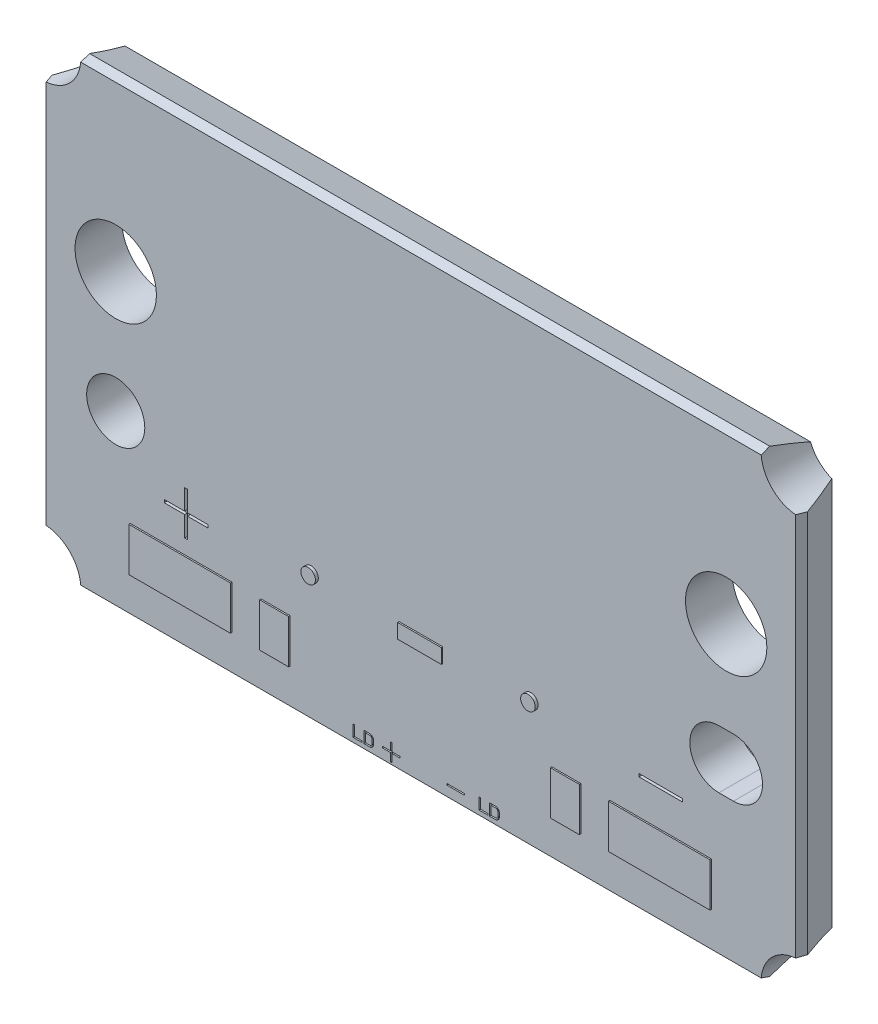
ISO-10303-21;
HEADER;
FILE_DESCRIPTION(('STEP AP214'),'2;1');
FILE_NAME('part.step','',(''),(''),'','','');
FILE_SCHEMA(('AUTOMOTIVE_DESIGN { 1 0 10303 214 1 1 1 1 }'));
ENDSEC;
DATA;
#1=APPLICATION_CONTEXT('core data for automotive mechanical design processes');
#2=APPLICATION_PROTOCOL_DEFINITION('international standard','automotive_design',2000,#1);
#3=PRODUCT_CONTEXT('',#1,'mechanical');
#4=PRODUCT('Part','Part','',(#3));
#5=PRODUCT_RELATED_PRODUCT_CATEGORY('part','',(#4));
#6=PRODUCT_DEFINITION_FORMATION('','',#4);
#7=PRODUCT_DEFINITION_CONTEXT('part definition',#1,'design');
#8=PRODUCT_DEFINITION('design','',#6,#7);
#9=PRODUCT_DEFINITION_SHAPE('','',#8);
#10=(LENGTH_UNIT() NAMED_UNIT(*) SI_UNIT(.MILLI.,.METRE.));
#11=(NAMED_UNIT(*) PLANE_ANGLE_UNIT() SI_UNIT($,.RADIAN.));
#12=(NAMED_UNIT(*) SI_UNIT($,.STERADIAN.) SOLID_ANGLE_UNIT());
#13=UNCERTAINTY_MEASURE_WITH_UNIT(LENGTH_MEASURE(1.E-05),#10,'distance_accuracy_value','');
#14=(GEOMETRIC_REPRESENTATION_CONTEXT(3) GLOBAL_UNCERTAINTY_ASSIGNED_CONTEXT((#13)) GLOBAL_UNIT_ASSIGNED_CONTEXT((#10,
#11,#12)) REPRESENTATION_CONTEXT('',''));
#15=CARTESIAN_POINT('',(0.,0.,0.));
#16=DIRECTION('',(0.,0.,1.));
#17=DIRECTION('',(1.,0.,0.));
#18=AXIS2_PLACEMENT_3D('',#15,#16,#17);
#19=CARTESIAN_POINT('',(0.,0.,1.61));
#20=DIRECTION('',(0.,0.,1.));
#21=DIRECTION('',(1.,0.,0.));
#22=AXIS2_PLACEMENT_3D('',#19,#20,#21);
#23=PLANE('',#22);
#24=DIRECTION('',(0.968917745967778,-0.247383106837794,0.));
#25=VECTOR('',#24,1.);
#26=CARTESIAN_POINT('',(-1.763333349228,-7.29187275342,1.61));
#27=LINE('',#26,#25);
#28=CARTESIAN_POINT('',(-1.73000000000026,-7.30038339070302,1.61));
#29=VERTEX_POINT('',#28);
#30=CARTESIAN_POINT('',(-1.763333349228,-7.29187275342,1.61));
#31=VERTEX_POINT('',#30);
#32=EDGE_CURVE('E1268',#29,#31,#27,.F.);
#33=ORIENTED_EDGE('',*,*,#32,.T.);
#34=DIRECTION('',(1.,0.,0.));
#35=VECTOR('',#34,1.);
#36=CARTESIAN_POINT('',(-1.913333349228,-7.29187275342,1.61));
#37=LINE('',#36,#35);
#38=CARTESIAN_POINT('',(-1.913333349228,-7.29187275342,1.61));
#39=VERTEX_POINT('',#38);
#40=EDGE_CURVE('E1205',#31,#39,#37,.F.);
#41=ORIENTED_EDGE('',*,*,#40,.T.);
#42=DIRECTION('',(0.,1.,0.));
#43=VECTOR('',#42,1.);
#44=CARTESIAN_POINT('',(-1.913333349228,-7.58974510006,1.61));
#45=LINE('',#44,#43);
#46=CARTESIAN_POINT('',(-1.913333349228,-7.58974510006,1.61));
#47=VERTEX_POINT('',#46);
#48=EDGE_CURVE('E1211',#39,#47,#45,.F.);
#49=ORIENTED_EDGE('',*,*,#48,.T.);
#50=DIRECTION('',(1.,0.,0.));
#51=VECTOR('',#50,1.);
#52=CARTESIAN_POINT('',(-1.763333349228,-7.58974510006,1.61));
#53=LINE('',#52,#51);
#54=CARTESIAN_POINT('',(-1.76333334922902,-7.58974510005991,1.61));
#55=VERTEX_POINT('',#54);
#56=EDGE_CURVE('E1217',#47,#55,#53,.T.);
#57=ORIENTED_EDGE('',*,*,#56,.T.);
#58=DIRECTION('',(-0.968917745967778,-0.247383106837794,0.));
#59=VECTOR('',#58,1.);
#60=CARTESIAN_POINT('',(-1.73,-7.581234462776,1.61));
#61=LINE('',#60,#59);
#62=CARTESIAN_POINT('',(-1.72999999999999,-7.58123446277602,1.61));
#63=VERTEX_POINT('',#62);
#64=EDGE_CURVE('E1223',#55,#63,#61,.F.);
#65=ORIENTED_EDGE('',*,*,#64,.T.);
#66=DIRECTION('',(-0.826599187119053,-0.562791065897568,0.));
#67=VECTOR('',#66,1.);
#68=CARTESIAN_POINT('',(-1.705,-7.564213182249,1.61));
#69=LINE('',#68,#67);
#70=CARTESIAN_POINT('',(-1.70500000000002,-7.56421318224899,1.61));
#71=VERTEX_POINT('',#70);
#72=EDGE_CURVE('E1229',#63,#71,#69,.F.);
#73=ORIENTED_EDGE('',*,*,#72,.T.);
#74=DIRECTION('',(-0.546622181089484,-0.837379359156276,0.));
#75=VECTOR('',#74,1.);
#76=CARTESIAN_POINT('',(-1.688333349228,-7.538681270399,1.61));
#77=LINE('',#76,#75);
#78=CARTESIAN_POINT('',(-1.68833334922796,-7.53868127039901,1.61));
#79=VERTEX_POINT('',#78);
#80=EDGE_CURVE('E1235',#71,#79,#77,.F.);
#81=ORIENTED_EDGE('',*,*,#80,.T.);
#82=DIRECTION('',(-0.237771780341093,-0.97132104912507,0.));
#83=VECTOR('',#82,1.);
#84=CARTESIAN_POINT('',(-1.68,-7.504638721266,1.61));
#85=LINE('',#84,#83);
#86=CARTESIAN_POINT('',(-1.68,-7.504638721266,1.61));
#87=VERTEX_POINT('',#86);
#88=EDGE_CURVE('E1241',#79,#87,#85,.F.);
#89=ORIENTED_EDGE('',*,*,#88,.T.);
#90=DIRECTION('',(0.,1.,0.));
#91=VECTOR('',#90,1.);
#92=CARTESIAN_POINT('',(-1.68,-7.376979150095,1.61));
#93=LINE('',#92,#91);
#94=CARTESIAN_POINT('',(-1.68000000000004,-7.37697915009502,1.61));
#95=VERTEX_POINT('',#94);
#96=EDGE_CURVE('E1247',#87,#95,#93,.T.);
#97=ORIENTED_EDGE('',*,*,#96,.T.);
#98=DIRECTION('',(0.237771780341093,-0.97132104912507,0.));
#99=VECTOR('',#98,1.);
#100=CARTESIAN_POINT('',(-1.688333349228,-7.342936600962,1.61));
#101=LINE('',#100,#99);
#102=CARTESIAN_POINT('',(-1.68833334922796,-7.34293660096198,1.61));
#103=VERTEX_POINT('',#102);
#104=EDGE_CURVE('E1253',#95,#103,#101,.F.);
#105=ORIENTED_EDGE('',*,*,#104,.T.);
#106=DIRECTION('',(0.546621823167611,-0.837379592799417,0.));
#107=VECTOR('',#106,1.);
#108=CARTESIAN_POINT('',(-1.705,-7.31740466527,1.61));
#109=LINE('',#108,#107);
#110=CARTESIAN_POINT('',(-1.70499999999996,-7.31740466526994,1.61));
#111=VERTEX_POINT('',#110);
#112=EDGE_CURVE('E1259',#103,#111,#109,.F.);
#113=ORIENTED_EDGE('',*,*,#112,.T.);
#114=DIRECTION('',(0.826599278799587,-0.562790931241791,0.));
#115=VECTOR('',#114,1.);
#116=CARTESIAN_POINT('',(-1.73,-7.300383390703,1.61));
#117=LINE('',#116,#115);
#118=EDGE_CURVE('E1265',#111,#29,#117,.F.);
#119=ORIENTED_EDGE('',*,*,#118,.T.);
#120=EDGE_LOOP('',(#33,#41,#49,#57,#65,#73,#81,#89,#97,#105,#113,#119));
#121=FACE_BOUND('',#120,.T.);
#122=ADVANCED_FACE('F17',(#121),#23,.T.);
#123=CARTESIAN_POINT('',(0.,0.,1.61));
#124=DIRECTION('',(0.,0.,1.));
#125=DIRECTION('',(1.,0.,0.));
#126=AXIS2_PLACEMENT_3D('',#123,#124,#125);
#127=PLANE('',#126);
#128=DIRECTION('',(0.968917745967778,-0.247383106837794,0.));
#129=VECTOR('',#128,1.);
#130=CARTESIAN_POINT('',(2.566666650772,-7.29187275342,1.61));
#131=LINE('',#130,#129);
#132=CARTESIAN_POINT('',(2.59999999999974,-7.30038339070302,1.61));
#133=VERTEX_POINT('',#132);
#134=CARTESIAN_POINT('',(2.566666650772,-7.29187275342,1.61));
#135=VERTEX_POINT('',#134);
#136=EDGE_CURVE('E1196',#133,#135,#131,.F.);
#137=ORIENTED_EDGE('',*,*,#136,.T.);
#138=DIRECTION('',(1.,0.,0.));
#139=VECTOR('',#138,1.);
#140=CARTESIAN_POINT('',(2.416666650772,-7.29187275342,1.61));
#141=LINE('',#140,#139);
#142=CARTESIAN_POINT('',(2.416666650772,-7.29187275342,1.61));
#143=VERTEX_POINT('',#142);
#144=EDGE_CURVE('E1133',#135,#143,#141,.F.);
#145=ORIENTED_EDGE('',*,*,#144,.T.);
#146=DIRECTION('',(0.,1.,0.));
#147=VECTOR('',#146,1.);
#148=CARTESIAN_POINT('',(2.416666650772,-7.58974510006,1.61));
#149=LINE('',#148,#147);
#150=CARTESIAN_POINT('',(2.416666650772,-7.58974510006,1.61));
#151=VERTEX_POINT('',#150);
#152=EDGE_CURVE('E1139',#143,#151,#149,.F.);
#153=ORIENTED_EDGE('',*,*,#152,.T.);
#154=DIRECTION('',(1.,0.,0.));
#155=VECTOR('',#154,1.);
#156=CARTESIAN_POINT('',(2.566666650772,-7.58974510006,1.61));
#157=LINE('',#156,#155);
#158=CARTESIAN_POINT('',(2.56666665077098,-7.58974510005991,1.61));
#159=VERTEX_POINT('',#158);
#160=EDGE_CURVE('E1145',#151,#159,#157,.T.);
#161=ORIENTED_EDGE('',*,*,#160,.T.);
#162=DIRECTION('',(-0.968917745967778,-0.247383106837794,0.));
#163=VECTOR('',#162,1.);
#164=CARTESIAN_POINT('',(2.6,-7.581234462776,1.61));
#165=LINE('',#164,#163);
#166=CARTESIAN_POINT('',(2.60000000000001,-7.58123446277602,1.61));
#167=VERTEX_POINT('',#166);
#168=EDGE_CURVE('E1151',#159,#167,#165,.F.);
#169=ORIENTED_EDGE('',*,*,#168,.T.);
#170=DIRECTION('',(-0.826599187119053,-0.562791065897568,0.));
#171=VECTOR('',#170,1.);
#172=CARTESIAN_POINT('',(2.625,-7.564213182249,1.61));
#173=LINE('',#172,#171);
#174=CARTESIAN_POINT('',(2.62499999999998,-7.56421318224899,1.61));
#175=VERTEX_POINT('',#174);
#176=EDGE_CURVE('E1157',#167,#175,#173,.F.);
#177=ORIENTED_EDGE('',*,*,#176,.T.);
#178=DIRECTION('',(-0.546622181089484,-0.837379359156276,0.));
#179=VECTOR('',#178,1.);
#180=CARTESIAN_POINT('',(2.641666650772,-7.538681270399,1.61));
#181=LINE('',#180,#179);
#182=CARTESIAN_POINT('',(2.64166665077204,-7.53868127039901,1.61));
#183=VERTEX_POINT('',#182);
#184=EDGE_CURVE('E1163',#175,#183,#181,.F.);
#185=ORIENTED_EDGE('',*,*,#184,.T.);
#186=DIRECTION('',(-0.237771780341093,-0.97132104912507,0.));
#187=VECTOR('',#186,1.);
#188=CARTESIAN_POINT('',(2.65,-7.504638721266,1.61));
#189=LINE('',#188,#187);
#190=CARTESIAN_POINT('',(2.65,-7.504638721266,1.61));
#191=VERTEX_POINT('',#190);
#192=EDGE_CURVE('E1169',#183,#191,#189,.F.);
#193=ORIENTED_EDGE('',*,*,#192,.T.);
#194=DIRECTION('',(0.,1.,0.));
#195=VECTOR('',#194,1.);
#196=CARTESIAN_POINT('',(2.65,-7.376979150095,1.61));
#197=LINE('',#196,#195);
#198=CARTESIAN_POINT('',(2.64999999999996,-7.37697915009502,1.61));
#199=VERTEX_POINT('',#198);
#200=EDGE_CURVE('E1175',#191,#199,#197,.T.);
#201=ORIENTED_EDGE('',*,*,#200,.T.);
#202=DIRECTION('',(0.237771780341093,-0.97132104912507,0.));
#203=VECTOR('',#202,1.);
#204=CARTESIAN_POINT('',(2.641666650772,-7.342936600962,1.61));
#205=LINE('',#204,#203);
#206=CARTESIAN_POINT('',(2.64166665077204,-7.34293660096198,1.61));
#207=VERTEX_POINT('',#206);
#208=EDGE_CURVE('E1181',#199,#207,#205,.F.);
#209=ORIENTED_EDGE('',*,*,#208,.T.);
#210=DIRECTION('',(0.546621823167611,-0.837379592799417,0.));
#211=VECTOR('',#210,1.);
#212=CARTESIAN_POINT('',(2.625,-7.31740466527,1.61));
#213=LINE('',#212,#211);
#214=CARTESIAN_POINT('',(2.62500000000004,-7.31740466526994,1.61));
#215=VERTEX_POINT('',#214);
#216=EDGE_CURVE('E1187',#207,#215,#213,.F.);
#217=ORIENTED_EDGE('',*,*,#216,.T.);
#218=DIRECTION('',(0.826599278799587,-0.562790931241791,0.));
#219=VECTOR('',#218,1.);
#220=CARTESIAN_POINT('',(2.6,-7.300383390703,1.61));
#221=LINE('',#220,#219);
#222=EDGE_CURVE('E1193',#215,#133,#221,.F.);
#223=ORIENTED_EDGE('',*,*,#222,.T.);
#224=EDGE_LOOP('',(#137,#145,#153,#161,#169,#177,#185,#193,#201,#209,#217,#223));
#225=FACE_BOUND('',#224,.T.);
#226=ADVANCED_FACE('F2147',(#225),#127,.T.);
#227=CARTESIAN_POINT('',(-1.763333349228,-7.29187275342,1.61));
#228=DIRECTION('',(-0.247383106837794,-0.968917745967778,0.));
#229=DIRECTION('',(0.968917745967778,-0.247383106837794,0.));
#230=AXIS2_PLACEMENT_3D('',#227,#228,#229);
#231=PLANE('',#230);
#232=DIRECTION('',(0.968917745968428,-0.247383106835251,0.));
#233=VECTOR('',#232,1.);
#234=CARTESIAN_POINT('',(-1.763333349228,-7.29187275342,1.51));
#235=LINE('',#234,#233);
#236=CARTESIAN_POINT('',(-1.763333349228,-7.29187275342,1.51));
#237=VERTEX_POINT('',#236);
#238=CARTESIAN_POINT('',(-1.73000000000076,-7.30038339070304,1.51));
#239=VERTEX_POINT('',#238);
#240=EDGE_CURVE('E695',#237,#239,#235,.T.);
#241=ORIENTED_EDGE('',*,*,#240,.F.);
#242=DIRECTION('',(0.,0.,-1.));
#243=VECTOR('',#242,1.);
#244=CARTESIAN_POINT('',(-1.763333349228,-7.29187275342,1.61));
#245=LINE('',#244,#243);
#246=EDGE_CURVE('E1199',#237,#31,#245,.F.);
#247=ORIENTED_EDGE('',*,*,#246,.T.);
#248=ORIENTED_EDGE('',*,*,#32,.F.);
#249=DIRECTION('',(0.,0.,1.));
#250=VECTOR('',#249,1.);
#251=CARTESIAN_POINT('',(-1.73,-7.300383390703,1.61));
#252=LINE('',#251,#250);
#253=EDGE_CURVE('E1262',#29,#239,#252,.F.);
#254=ORIENTED_EDGE('',*,*,#253,.T.);
#255=EDGE_LOOP('',(#241,#247,#248,#254));
#256=FACE_BOUND('',#255,.T.);
#257=ADVANCED_FACE('F2144',(#256),#231,.F.);
#258=CARTESIAN_POINT('',(-1.73,-7.300383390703,1.61));
#259=DIRECTION('',(-0.562790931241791,-0.826599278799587,0.));
#260=DIRECTION('',(0.826599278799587,-0.562790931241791,0.));
#261=AXIS2_PLACEMENT_3D('',#258,#259,#260);
#262=PLANE('',#261);
#263=DIRECTION('',(0.826599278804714,-0.562790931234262,0.));
#264=VECTOR('',#263,1.);
#265=CARTESIAN_POINT('',(-1.730000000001,-7.300383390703,1.51));
#266=LINE('',#265,#264);
#267=CARTESIAN_POINT('',(-1.70499999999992,-7.31740466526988,1.51));
#268=VERTEX_POINT('',#267);
#269=EDGE_CURVE('E692',#239,#268,#266,.T.);
#270=ORIENTED_EDGE('',*,*,#269,.F.);
#271=ORIENTED_EDGE('',*,*,#253,.F.);
#272=ORIENTED_EDGE('',*,*,#118,.F.);
#273=DIRECTION('',(0.,0.,1.));
#274=VECTOR('',#273,1.);
#275=CARTESIAN_POINT('',(-1.705,-7.31740466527,1.61));
#276=LINE('',#275,#274);
#277=EDGE_CURVE('E1256',#111,#268,#276,.F.);
#278=ORIENTED_EDGE('',*,*,#277,.T.);
#279=EDGE_LOOP('',(#270,#271,#272,#278));
#280=FACE_BOUND('',#279,.T.);
#281=ADVANCED_FACE('F2140',(#280),#262,.F.);
#282=CARTESIAN_POINT('',(-1.705,-7.31740466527,1.61));
#283=DIRECTION('',(-0.837379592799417,-0.546621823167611,0.));
#284=DIRECTION('',(0.546621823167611,-0.837379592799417,0.));
#285=AXIS2_PLACEMENT_3D('',#282,#283,#284);
#286=PLANE('',#285);
#287=DIRECTION('',(0.546621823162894,-0.837379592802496,0.));
#288=VECTOR('',#287,1.);
#289=CARTESIAN_POINT('',(-1.705,-7.31740466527,1.51));
#290=LINE('',#289,#288);
#291=CARTESIAN_POINT('',(-1.68833334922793,-7.34293660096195,1.51));
#292=VERTEX_POINT('',#291);
#293=EDGE_CURVE('E689',#268,#292,#290,.T.);
#294=ORIENTED_EDGE('',*,*,#293,.F.);
#295=ORIENTED_EDGE('',*,*,#277,.F.);
#296=ORIENTED_EDGE('',*,*,#112,.F.);
#297=DIRECTION('',(0.,0.,1.));
#298=VECTOR('',#297,1.);
#299=CARTESIAN_POINT('',(-1.688333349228,-7.342936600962,1.61));
#300=LINE('',#299,#298);
#301=EDGE_CURVE('E1250',#103,#292,#300,.F.);
#302=ORIENTED_EDGE('',*,*,#301,.T.);
#303=EDGE_LOOP('',(#294,#295,#296,#302));
#304=FACE_BOUND('',#303,.T.);
#305=ADVANCED_FACE('F2136',(#304),#286,.F.);
#306=CARTESIAN_POINT('',(-1.688333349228,-7.342936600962,1.61));
#307=DIRECTION('',(-0.97132104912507,-0.237771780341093,0.));
#308=DIRECTION('',(0.237771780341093,-0.97132104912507,0.));
#309=AXIS2_PLACEMENT_3D('',#306,#307,#308);
#310=PLANE('',#309);
#311=DIRECTION('',(0.237771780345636,-0.971321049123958,0.));
#312=VECTOR('',#311,1.);
#313=CARTESIAN_POINT('',(-1.688333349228,-7.342936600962,1.51));
#314=LINE('',#313,#312);
#315=CARTESIAN_POINT('',(-1.68000000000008,-7.37697915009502,1.51));
#316=VERTEX_POINT('',#315);
#317=EDGE_CURVE('E686',#292,#316,#314,.T.);
#318=ORIENTED_EDGE('',*,*,#317,.F.);
#319=ORIENTED_EDGE('',*,*,#301,.F.);
#320=ORIENTED_EDGE('',*,*,#104,.F.);
#321=DIRECTION('',(0.,0.,1.));
#322=VECTOR('',#321,1.);
#323=CARTESIAN_POINT('',(-1.68,-7.376979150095,1.61));
#324=LINE('',#323,#322);
#325=EDGE_CURVE('E1244',#95,#316,#324,.F.);
#326=ORIENTED_EDGE('',*,*,#325,.T.);
#327=EDGE_LOOP('',(#318,#319,#320,#326));
#328=FACE_BOUND('',#327,.T.);
#329=ADVANCED_FACE('F2132',(#328),#310,.F.);
#330=CARTESIAN_POINT('',(-1.68,-7.376979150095,1.61));
#331=DIRECTION('',(-1.,0.,0.));
#332=DIRECTION('',(0.,0.,1.));
#333=AXIS2_PLACEMENT_3D('',#330,#331,#332);
#334=PLANE('',#333);
#335=DIRECTION('',(0.,1.,0.));
#336=VECTOR('',#335,1.);
#337=CARTESIAN_POINT('',(-1.68,0.,1.51));
#338=LINE('',#337,#336);
#339=CARTESIAN_POINT('',(-1.68,-7.50463872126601,1.51));
#340=VERTEX_POINT('',#339);
#341=EDGE_CURVE('E683',#316,#340,#338,.F.);
#342=ORIENTED_EDGE('',*,*,#341,.F.);
#343=ORIENTED_EDGE('',*,*,#325,.F.);
#344=ORIENTED_EDGE('',*,*,#96,.F.);
#345=DIRECTION('',(0.,0.,1.));
#346=VECTOR('',#345,1.);
#347=CARTESIAN_POINT('',(-1.68,-7.504638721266,1.61));
#348=LINE('',#347,#346);
#349=EDGE_CURVE('E1238',#87,#340,#348,.F.);
#350=ORIENTED_EDGE('',*,*,#349,.T.);
#351=EDGE_LOOP('',(#342,#343,#344,#350));
#352=FACE_BOUND('',#351,.T.);
#353=ADVANCED_FACE('F2128',(#352),#334,.F.);
#354=CARTESIAN_POINT('',(-1.68,-7.504638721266,1.61));
#355=DIRECTION('',(-0.97132104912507,0.237771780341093,0.));
#356=DIRECTION('',(-0.237771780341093,-0.97132104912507,0.));
#357=AXIS2_PLACEMENT_3D('',#354,#355,#356);
#358=PLANE('',#357);
#359=DIRECTION('',(-0.237771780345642,-0.971321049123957,0.));
#360=VECTOR('',#359,1.);
#361=CARTESIAN_POINT('',(-1.68,-7.504638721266,1.51));
#362=LINE('',#361,#360);
#363=CARTESIAN_POINT('',(-1.68833334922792,-7.53868127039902,1.51));
#364=VERTEX_POINT('',#363);
#365=EDGE_CURVE('E680',#340,#364,#362,.T.);
#366=ORIENTED_EDGE('',*,*,#365,.F.);
#367=ORIENTED_EDGE('',*,*,#349,.F.);
#368=ORIENTED_EDGE('',*,*,#88,.F.);
#369=DIRECTION('',(0.,0.,1.));
#370=VECTOR('',#369,1.);
#371=CARTESIAN_POINT('',(-1.688333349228,-7.538681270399,1.61));
#372=LINE('',#371,#370);
#373=EDGE_CURVE('E1232',#79,#364,#372,.F.);
#374=ORIENTED_EDGE('',*,*,#373,.T.);
#375=EDGE_LOOP('',(#366,#367,#368,#374));
#376=FACE_BOUND('',#375,.T.);
#377=ADVANCED_FACE('F2124',(#376),#358,.F.);
#378=CARTESIAN_POINT('',(-1.688333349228,-7.538681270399,1.61));
#379=DIRECTION('',(-0.837379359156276,0.546622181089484,0.));
#380=DIRECTION('',(-0.546622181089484,-0.837379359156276,0.));
#381=AXIS2_PLACEMENT_3D('',#378,#379,#380);
#382=PLANE('',#381);
#383=DIRECTION('',(-0.546622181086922,-0.837379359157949,0.));
#384=VECTOR('',#383,1.);
#385=CARTESIAN_POINT('',(-1.688333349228,-7.538681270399,1.51));
#386=LINE('',#385,#384);
#387=CARTESIAN_POINT('',(-1.70500000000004,-7.56421318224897,1.51));
#388=VERTEX_POINT('',#387);
#389=EDGE_CURVE('E677',#364,#388,#386,.T.);
#390=ORIENTED_EDGE('',*,*,#389,.F.);
#391=ORIENTED_EDGE('',*,*,#373,.F.);
#392=ORIENTED_EDGE('',*,*,#80,.F.);
#393=DIRECTION('',(0.,0.,1.));
#394=VECTOR('',#393,1.);
#395=CARTESIAN_POINT('',(-1.705,-7.564213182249,1.61));
#396=LINE('',#395,#394);
#397=EDGE_CURVE('E1226',#71,#388,#396,.F.);
#398=ORIENTED_EDGE('',*,*,#397,.T.);
#399=EDGE_LOOP('',(#390,#391,#392,#398));
#400=FACE_BOUND('',#399,.T.);
#401=ADVANCED_FACE('F2120',(#400),#382,.F.);
#402=CARTESIAN_POINT('',(-1.705,-7.564213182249,1.61));
#403=DIRECTION('',(-0.562791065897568,0.826599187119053,0.));
#404=DIRECTION('',(-0.826599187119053,-0.562791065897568,0.));
#405=AXIS2_PLACEMENT_3D('',#402,#403,#404);
#406=PLANE('',#405);
#407=DIRECTION('',(-0.826599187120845,-0.562791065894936,0.));
#408=VECTOR('',#407,1.);
#409=CARTESIAN_POINT('',(-1.705,-7.564213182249,1.51));
#410=LINE('',#409,#408);
#411=CARTESIAN_POINT('',(-1.72999999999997,-7.58123446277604,1.51));
#412=VERTEX_POINT('',#411);
#413=EDGE_CURVE('E674',#388,#412,#410,.T.);
#414=ORIENTED_EDGE('',*,*,#413,.F.);
#415=ORIENTED_EDGE('',*,*,#397,.F.);
#416=ORIENTED_EDGE('',*,*,#72,.F.);
#417=DIRECTION('',(0.,0.,1.));
#418=VECTOR('',#417,1.);
#419=CARTESIAN_POINT('',(-1.73,-7.581234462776,1.61));
#420=LINE('',#419,#418);
#421=EDGE_CURVE('E1220',#63,#412,#420,.F.);
#422=ORIENTED_EDGE('',*,*,#421,.T.);
#423=EDGE_LOOP('',(#414,#415,#416,#422));
#424=FACE_BOUND('',#423,.T.);
#425=ADVANCED_FACE('F2116',(#424),#406,.F.);
#426=CARTESIAN_POINT('',(-1.73,-7.581234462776,1.61));
#427=DIRECTION('',(-0.247383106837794,0.968917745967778,0.));
#428=DIRECTION('',(-0.968917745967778,-0.247383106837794,0.));
#429=AXIS2_PLACEMENT_3D('',#426,#427,#428);
#430=PLANE('',#429);
#431=DIRECTION('',(-0.968917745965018,-0.247383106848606,0.));
#432=VECTOR('',#431,1.);
#433=CARTESIAN_POINT('',(-1.73,-7.581234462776,1.51));
#434=LINE('',#433,#432);
#435=CARTESIAN_POINT('',(-1.76333334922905,-7.58974510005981,1.51));
#436=VERTEX_POINT('',#435);
#437=EDGE_CURVE('E671',#412,#436,#434,.T.);
#438=ORIENTED_EDGE('',*,*,#437,.F.);
#439=ORIENTED_EDGE('',*,*,#421,.F.);
#440=ORIENTED_EDGE('',*,*,#64,.F.);
#441=DIRECTION('',(0.,0.,1.));
#442=VECTOR('',#441,1.);
#443=CARTESIAN_POINT('',(-1.763333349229,-7.58974510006,1.61));
#444=LINE('',#443,#442);
#445=EDGE_CURVE('E1214',#55,#436,#444,.F.);
#446=ORIENTED_EDGE('',*,*,#445,.T.);
#447=EDGE_LOOP('',(#438,#439,#440,#446));
#448=FACE_BOUND('',#447,.T.);
#449=ADVANCED_FACE('F2112',(#448),#430,.F.);
#450=CARTESIAN_POINT('',(-1.763333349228,-7.58974510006,1.61));
#451=DIRECTION('',(0.,1.,0.));
#452=DIRECTION('',(0.,0.,1.));
#453=AXIS2_PLACEMENT_3D('',#450,#451,#452);
#454=PLANE('',#453);
#455=DIRECTION('',(1.,0.,0.));
#456=VECTOR('',#455,1.);
#457=CARTESIAN_POINT('',(0.,-7.58974510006,1.51));
#458=LINE('',#457,#456);
#459=CARTESIAN_POINT('',(-1.913333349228,-7.58974510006,1.51));
#460=VERTEX_POINT('',#459);
#461=EDGE_CURVE('E668',#436,#460,#458,.F.);
#462=ORIENTED_EDGE('',*,*,#461,.F.);
#463=ORIENTED_EDGE('',*,*,#445,.F.);
#464=ORIENTED_EDGE('',*,*,#56,.F.);
#465=DIRECTION('',(0.,0.,-1.));
#466=VECTOR('',#465,1.);
#467=CARTESIAN_POINT('',(-1.913333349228,-7.58974510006,1.61));
#468=LINE('',#467,#466);
#469=EDGE_CURVE('E1208',#47,#460,#468,.T.);
#470=ORIENTED_EDGE('',*,*,#469,.T.);
#471=EDGE_LOOP('',(#462,#463,#464,#470));
#472=FACE_BOUND('',#471,.T.);
#473=ADVANCED_FACE('F2108',(#472),#454,.F.);
#474=CARTESIAN_POINT('',(-1.913333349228,-7.58974510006,1.61));
#475=DIRECTION('',(1.,0.,0.));
#476=DIRECTION('',(0.,0.,-1.));
#477=AXIS2_PLACEMENT_3D('',#474,#475,#476);
#478=PLANE('',#477);
#479=DIRECTION('',(0.,1.,0.));
#480=VECTOR('',#479,1.);
#481=CARTESIAN_POINT('',(-1.913333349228,0.,1.51));
#482=LINE('',#481,#480);
#483=CARTESIAN_POINT('',(-1.913333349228,-7.29187275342,1.51));
#484=VERTEX_POINT('',#483);
#485=EDGE_CURVE('E665',#460,#484,#482,.T.);
#486=ORIENTED_EDGE('',*,*,#485,.F.);
#487=ORIENTED_EDGE('',*,*,#469,.F.);
#488=ORIENTED_EDGE('',*,*,#48,.F.);
#489=DIRECTION('',(0.,0.,-1.));
#490=VECTOR('',#489,1.);
#491=CARTESIAN_POINT('',(-1.913333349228,-7.29187275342,1.61));
#492=LINE('',#491,#490);
#493=EDGE_CURVE('E1202',#39,#484,#492,.T.);
#494=ORIENTED_EDGE('',*,*,#493,.T.);
#495=EDGE_LOOP('',(#486,#487,#488,#494));
#496=FACE_BOUND('',#495,.T.);
#497=ADVANCED_FACE('F2104',(#496),#478,.F.);
#498=CARTESIAN_POINT('',(-1.913333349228,-7.29187275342,1.61));
#499=DIRECTION('',(0.,-1.,0.));
#500=DIRECTION('',(0.,0.,-1.));
#501=AXIS2_PLACEMENT_3D('',#498,#499,#500);
#502=PLANE('',#501);
#503=DIRECTION('',(1.,0.,0.));
#504=VECTOR('',#503,1.);
#505=CARTESIAN_POINT('',(0.,-7.29187275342,1.51));
#506=LINE('',#505,#504);
#507=EDGE_CURVE('E542',#484,#237,#506,.T.);
#508=ORIENTED_EDGE('',*,*,#507,.F.);
#509=ORIENTED_EDGE('',*,*,#493,.F.);
#510=ORIENTED_EDGE('',*,*,#40,.F.);
#511=ORIENTED_EDGE('',*,*,#246,.F.);
#512=EDGE_LOOP('',(#508,#509,#510,#511));
#513=FACE_BOUND('',#512,.T.);
#514=ADVANCED_FACE('F2100',(#513),#502,.F.);
#515=CARTESIAN_POINT('',(2.566666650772,-7.29187275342,1.61));
#516=DIRECTION('',(-0.247383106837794,-0.968917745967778,0.));
#517=DIRECTION('',(0.968917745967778,-0.247383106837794,0.));
#518=AXIS2_PLACEMENT_3D('',#515,#516,#517);
#519=PLANE('',#518);
#520=DIRECTION('',(0.968917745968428,-0.247383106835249,0.));
#521=VECTOR('',#520,1.);
#522=CARTESIAN_POINT('',(2.566666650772,-7.29187275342,1.51));
#523=LINE('',#522,#521);
#524=CARTESIAN_POINT('',(2.566666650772,-7.29187275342,1.51));
#525=VERTEX_POINT('',#524);
#526=CARTESIAN_POINT('',(2.59999999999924,-7.30038339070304,1.51));
#527=VERTEX_POINT('',#526);
#528=EDGE_CURVE('E539',#525,#527,#523,.T.);
#529=ORIENTED_EDGE('',*,*,#528,.F.);
#530=DIRECTION('',(0.,0.,-1.));
#531=VECTOR('',#530,1.);
#532=CARTESIAN_POINT('',(2.566666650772,-7.29187275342,1.61));
#533=LINE('',#532,#531);
#534=EDGE_CURVE('E422',#525,#135,#533,.F.);
#535=ORIENTED_EDGE('',*,*,#534,.T.);
#536=ORIENTED_EDGE('',*,*,#136,.F.);
#537=DIRECTION('',(0.,0.,1.));
#538=VECTOR('',#537,1.);
#539=CARTESIAN_POINT('',(2.6,-7.300383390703,1.61));
#540=LINE('',#539,#538);
#541=EDGE_CURVE('E1190',#133,#527,#540,.F.);
#542=ORIENTED_EDGE('',*,*,#541,.T.);
#543=EDGE_LOOP('',(#529,#535,#536,#542));
#544=FACE_BOUND('',#543,.T.);
#545=ADVANCED_FACE('F2096',(#544),#519,.F.);
#546=CARTESIAN_POINT('',(2.6,-7.300383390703,1.61));
#547=DIRECTION('',(-0.562790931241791,-0.826599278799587,0.));
#548=DIRECTION('',(0.826599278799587,-0.562790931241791,0.));
#549=AXIS2_PLACEMENT_3D('',#546,#547,#548);
#550=PLANE('',#549);
#551=DIRECTION('',(0.826599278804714,-0.562790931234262,0.));
#552=VECTOR('',#551,1.);
#553=CARTESIAN_POINT('',(2.599999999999,-7.300383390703,1.51));
#554=LINE('',#553,#552);
#555=CARTESIAN_POINT('',(2.62500000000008,-7.31740466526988,1.51));
#556=VERTEX_POINT('',#555);
#557=EDGE_CURVE('E536',#527,#556,#554,.T.);
#558=ORIENTED_EDGE('',*,*,#557,.F.);
#559=ORIENTED_EDGE('',*,*,#541,.F.);
#560=ORIENTED_EDGE('',*,*,#222,.F.);
#561=DIRECTION('',(0.,0.,1.));
#562=VECTOR('',#561,1.);
#563=CARTESIAN_POINT('',(2.625,-7.31740466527,1.61));
#564=LINE('',#563,#562);
#565=EDGE_CURVE('E1184',#215,#556,#564,.F.);
#566=ORIENTED_EDGE('',*,*,#565,.T.);
#567=EDGE_LOOP('',(#558,#559,#560,#566));
#568=FACE_BOUND('',#567,.T.);
#569=ADVANCED_FACE('F2092',(#568),#550,.F.);
#570=CARTESIAN_POINT('',(2.625,-7.31740466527,1.61));
#571=DIRECTION('',(-0.837379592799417,-0.546621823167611,0.));
#572=DIRECTION('',(0.546621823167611,-0.837379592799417,0.));
#573=AXIS2_PLACEMENT_3D('',#570,#571,#572);
#574=PLANE('',#573);
#575=DIRECTION('',(0.546621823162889,-0.837379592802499,0.));
#576=VECTOR('',#575,1.);
#577=CARTESIAN_POINT('',(2.625,-7.31740466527,1.51));
#578=LINE('',#577,#576);
#579=CARTESIAN_POINT('',(2.64166665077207,-7.34293660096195,1.51));
#580=VERTEX_POINT('',#579);
#581=EDGE_CURVE('E533',#556,#580,#578,.T.);
#582=ORIENTED_EDGE('',*,*,#581,.F.);
#583=ORIENTED_EDGE('',*,*,#565,.F.);
#584=ORIENTED_EDGE('',*,*,#216,.F.);
#585=DIRECTION('',(0.,0.,1.));
#586=VECTOR('',#585,1.);
#587=CARTESIAN_POINT('',(2.641666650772,-7.342936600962,1.61));
#588=LINE('',#587,#586);
#589=EDGE_CURVE('E1178',#207,#580,#588,.F.);
#590=ORIENTED_EDGE('',*,*,#589,.T.);
#591=EDGE_LOOP('',(#582,#583,#584,#590));
#592=FACE_BOUND('',#591,.T.);
#593=ADVANCED_FACE('F2088',(#592),#574,.F.);
#594=CARTESIAN_POINT('',(2.641666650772,-7.342936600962,1.61));
#595=DIRECTION('',(-0.97132104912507,-0.237771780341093,0.));
#596=DIRECTION('',(0.237771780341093,-0.97132104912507,0.));
#597=AXIS2_PLACEMENT_3D('',#594,#595,#596);
#598=PLANE('',#597);
#599=DIRECTION('',(0.237771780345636,-0.971321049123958,0.));
#600=VECTOR('',#599,1.);
#601=CARTESIAN_POINT('',(2.641666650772,-7.342936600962,1.51));
#602=LINE('',#601,#600);
#603=CARTESIAN_POINT('',(2.64999999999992,-7.37697915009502,1.51));
#604=VERTEX_POINT('',#603);
#605=EDGE_CURVE('E530',#580,#604,#602,.T.);
#606=ORIENTED_EDGE('',*,*,#605,.F.);
#607=ORIENTED_EDGE('',*,*,#589,.F.);
#608=ORIENTED_EDGE('',*,*,#208,.F.);
#609=DIRECTION('',(0.,0.,1.));
#610=VECTOR('',#609,1.);
#611=CARTESIAN_POINT('',(2.65,-7.376979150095,1.61));
#612=LINE('',#611,#610);
#613=EDGE_CURVE('E1172',#199,#604,#612,.F.);
#614=ORIENTED_EDGE('',*,*,#613,.T.);
#615=EDGE_LOOP('',(#606,#607,#608,#614));
#616=FACE_BOUND('',#615,.T.);
#617=ADVANCED_FACE('F2084',(#616),#598,.F.);
#618=CARTESIAN_POINT('',(2.65,-7.376979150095,1.61));
#619=DIRECTION('',(-1.,0.,0.));
#620=DIRECTION('',(0.,0.,1.));
#621=AXIS2_PLACEMENT_3D('',#618,#619,#620);
#622=PLANE('',#621);
#623=DIRECTION('',(0.,1.,0.));
#624=VECTOR('',#623,1.);
#625=CARTESIAN_POINT('',(2.65,0.,1.51));
#626=LINE('',#625,#624);
#627=CARTESIAN_POINT('',(2.65,-7.50463872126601,1.51));
#628=VERTEX_POINT('',#627);
#629=EDGE_CURVE('E527',#604,#628,#626,.F.);
#630=ORIENTED_EDGE('',*,*,#629,.F.);
#631=ORIENTED_EDGE('',*,*,#613,.F.);
#632=ORIENTED_EDGE('',*,*,#200,.F.);
#633=DIRECTION('',(0.,0.,1.));
#634=VECTOR('',#633,1.);
#635=CARTESIAN_POINT('',(2.65,-7.504638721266,1.61));
#636=LINE('',#635,#634);
#637=EDGE_CURVE('E1166',#191,#628,#636,.F.);
#638=ORIENTED_EDGE('',*,*,#637,.T.);
#639=EDGE_LOOP('',(#630,#631,#632,#638));
#640=FACE_BOUND('',#639,.T.);
#641=ADVANCED_FACE('F2080',(#640),#622,.F.);
#642=CARTESIAN_POINT('',(2.65,-7.504638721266,1.61));
#643=DIRECTION('',(-0.97132104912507,0.237771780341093,0.));
#644=DIRECTION('',(-0.237771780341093,-0.97132104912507,0.));
#645=AXIS2_PLACEMENT_3D('',#642,#643,#644);
#646=PLANE('',#645);
#647=DIRECTION('',(-0.237771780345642,-0.971321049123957,0.));
#648=VECTOR('',#647,1.);
#649=CARTESIAN_POINT('',(2.65,-7.504638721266,1.51));
#650=LINE('',#649,#648);
#651=CARTESIAN_POINT('',(2.64166665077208,-7.53868127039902,1.51));
#652=VERTEX_POINT('',#651);
#653=EDGE_CURVE('E524',#628,#652,#650,.T.);
#654=ORIENTED_EDGE('',*,*,#653,.F.);
#655=ORIENTED_EDGE('',*,*,#637,.F.);
#656=ORIENTED_EDGE('',*,*,#192,.F.);
#657=DIRECTION('',(0.,0.,1.));
#658=VECTOR('',#657,1.);
#659=CARTESIAN_POINT('',(2.641666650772,-7.538681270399,1.61));
#660=LINE('',#659,#658);
#661=EDGE_CURVE('E1160',#183,#652,#660,.F.);
#662=ORIENTED_EDGE('',*,*,#661,.T.);
#663=EDGE_LOOP('',(#654,#655,#656,#662));
#664=FACE_BOUND('',#663,.T.);
#665=ADVANCED_FACE('F2076',(#664),#646,.F.);
#666=CARTESIAN_POINT('',(2.641666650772,-7.538681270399,1.61));
#667=DIRECTION('',(-0.837379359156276,0.546622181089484,0.));
#668=DIRECTION('',(-0.546622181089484,-0.837379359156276,0.));
#669=AXIS2_PLACEMENT_3D('',#666,#667,#668);
#670=PLANE('',#669);
#671=DIRECTION('',(-0.546622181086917,-0.837379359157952,0.));
#672=VECTOR('',#671,1.);
#673=CARTESIAN_POINT('',(2.641666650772,-7.538681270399,1.51));
#674=LINE('',#673,#672);
#675=CARTESIAN_POINT('',(2.62499999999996,-7.56421318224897,1.51));
#676=VERTEX_POINT('',#675);
#677=EDGE_CURVE('E521',#652,#676,#674,.T.);
#678=ORIENTED_EDGE('',*,*,#677,.F.);
#679=ORIENTED_EDGE('',*,*,#661,.F.);
#680=ORIENTED_EDGE('',*,*,#184,.F.);
#681=DIRECTION('',(0.,0.,1.));
#682=VECTOR('',#681,1.);
#683=CARTESIAN_POINT('',(2.625,-7.564213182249,1.61));
#684=LINE('',#683,#682);
#685=EDGE_CURVE('E1154',#175,#676,#684,.F.);
#686=ORIENTED_EDGE('',*,*,#685,.T.);
#687=EDGE_LOOP('',(#678,#679,#680,#686));
#688=FACE_BOUND('',#687,.T.);
#689=ADVANCED_FACE('F2072',(#688),#670,.F.);
#690=CARTESIAN_POINT('',(2.625,-7.564213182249,1.61));
#691=DIRECTION('',(-0.562791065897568,0.826599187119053,0.));
#692=DIRECTION('',(-0.826599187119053,-0.562791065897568,0.));
#693=AXIS2_PLACEMENT_3D('',#690,#691,#692);
#694=PLANE('',#693);
#695=DIRECTION('',(-0.826599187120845,-0.562791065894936,0.));
#696=VECTOR('',#695,1.);
#697=CARTESIAN_POINT('',(2.625,-7.564213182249,1.51));
#698=LINE('',#697,#696);
#699=CARTESIAN_POINT('',(2.60000000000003,-7.58123446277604,1.51));
#700=VERTEX_POINT('',#699);
#701=EDGE_CURVE('E518',#676,#700,#698,.T.);
#702=ORIENTED_EDGE('',*,*,#701,.F.);
#703=ORIENTED_EDGE('',*,*,#685,.F.);
#704=ORIENTED_EDGE('',*,*,#176,.F.);
#705=DIRECTION('',(0.,0.,1.));
#706=VECTOR('',#705,1.);
#707=CARTESIAN_POINT('',(2.6,-7.581234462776,1.61));
#708=LINE('',#707,#706);
#709=EDGE_CURVE('E1148',#167,#700,#708,.F.);
#710=ORIENTED_EDGE('',*,*,#709,.T.);
#711=EDGE_LOOP('',(#702,#703,#704,#710));
#712=FACE_BOUND('',#711,.T.);
#713=ADVANCED_FACE('F2068',(#712),#694,.F.);
#714=CARTESIAN_POINT('',(2.6,-7.581234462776,1.61));
#715=DIRECTION('',(-0.247383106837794,0.968917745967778,0.));
#716=DIRECTION('',(-0.968917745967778,-0.247383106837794,0.));
#717=AXIS2_PLACEMENT_3D('',#714,#715,#716);
#718=PLANE('',#717);
#719=DIRECTION('',(-0.968917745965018,-0.247383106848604,0.));
#720=VECTOR('',#719,1.);
#721=CARTESIAN_POINT('',(2.6,-7.581234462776,1.51));
#722=LINE('',#721,#720);
#723=CARTESIAN_POINT('',(2.56666665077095,-7.58974510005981,1.51));
#724=VERTEX_POINT('',#723);
#725=EDGE_CURVE('E515',#700,#724,#722,.T.);
#726=ORIENTED_EDGE('',*,*,#725,.F.);
#727=ORIENTED_EDGE('',*,*,#709,.F.);
#728=ORIENTED_EDGE('',*,*,#168,.F.);
#729=DIRECTION('',(0.,0.,1.));
#730=VECTOR('',#729,1.);
#731=CARTESIAN_POINT('',(2.566666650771,-7.58974510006,1.61));
#732=LINE('',#731,#730);
#733=EDGE_CURVE('E1142',#159,#724,#732,.F.);
#734=ORIENTED_EDGE('',*,*,#733,.T.);
#735=EDGE_LOOP('',(#726,#727,#728,#734));
#736=FACE_BOUND('',#735,.T.);
#737=ADVANCED_FACE('F2064',(#736),#718,.F.);
#738=CARTESIAN_POINT('',(2.566666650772,-7.58974510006,1.61));
#739=DIRECTION('',(0.,1.,0.));
#740=DIRECTION('',(0.,0.,1.));
#741=AXIS2_PLACEMENT_3D('',#738,#739,#740);
#742=PLANE('',#741);
#743=DIRECTION('',(1.,0.,0.));
#744=VECTOR('',#743,1.);
#745=CARTESIAN_POINT('',(0.,-7.58974510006,1.51));
#746=LINE('',#745,#744);
#747=CARTESIAN_POINT('',(2.416666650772,-7.58974510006,1.51));
#748=VERTEX_POINT('',#747);
#749=EDGE_CURVE('E512',#724,#748,#746,.F.);
#750=ORIENTED_EDGE('',*,*,#749,.F.);
#751=ORIENTED_EDGE('',*,*,#733,.F.);
#752=ORIENTED_EDGE('',*,*,#160,.F.);
#753=DIRECTION('',(0.,0.,-1.));
#754=VECTOR('',#753,1.);
#755=CARTESIAN_POINT('',(2.416666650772,-7.58974510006,1.61));
#756=LINE('',#755,#754);
#757=EDGE_CURVE('E1136',#151,#748,#756,.T.);
#758=ORIENTED_EDGE('',*,*,#757,.T.);
#759=EDGE_LOOP('',(#750,#751,#752,#758));
#760=FACE_BOUND('',#759,.T.);
#761=ADVANCED_FACE('F2060',(#760),#742,.F.);
#762=CARTESIAN_POINT('',(2.416666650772,-7.58974510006,1.61));
#763=DIRECTION('',(1.,0.,0.));
#764=DIRECTION('',(0.,0.,-1.));
#765=AXIS2_PLACEMENT_3D('',#762,#763,#764);
#766=PLANE('',#765);
#767=DIRECTION('',(0.,1.,0.));
#768=VECTOR('',#767,1.);
#769=CARTESIAN_POINT('',(2.416666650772,0.,1.51));
#770=LINE('',#769,#768);
#771=CARTESIAN_POINT('',(2.416666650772,-7.29187275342,1.51));
#772=VERTEX_POINT('',#771);
#773=EDGE_CURVE('E492',#748,#772,#770,.T.);
#774=ORIENTED_EDGE('',*,*,#773,.F.);
#775=ORIENTED_EDGE('',*,*,#757,.F.);
#776=ORIENTED_EDGE('',*,*,#152,.F.);
#777=DIRECTION('',(0.,0.,-1.));
#778=VECTOR('',#777,1.);
#779=CARTESIAN_POINT('',(2.416666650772,-7.29187275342,1.61));
#780=LINE('',#779,#778);
#781=EDGE_CURVE('E1130',#143,#772,#780,.T.);
#782=ORIENTED_EDGE('',*,*,#781,.T.);
#783=EDGE_LOOP('',(#774,#775,#776,#782));
#784=FACE_BOUND('',#783,.T.);
#785=ADVANCED_FACE('F2056',(#784),#766,.F.);
#786=CARTESIAN_POINT('',(2.416666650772,-7.29187275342,1.61));
#787=DIRECTION('',(0.,-1.,0.));
#788=DIRECTION('',(0.,0.,-1.));
#789=AXIS2_PLACEMENT_3D('',#786,#787,#788);
#790=PLANE('',#789);
#791=DIRECTION('',(1.,0.,0.));
#792=VECTOR('',#791,1.);
#793=CARTESIAN_POINT('',(0.,-7.29187275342,1.51));
#794=LINE('',#793,#792);
#795=EDGE_CURVE('E489',#772,#525,#794,.T.);
#796=ORIENTED_EDGE('',*,*,#795,.F.);
#797=ORIENTED_EDGE('',*,*,#781,.F.);
#798=ORIENTED_EDGE('',*,*,#144,.F.);
#799=ORIENTED_EDGE('',*,*,#534,.F.);
#800=EDGE_LOOP('',(#796,#797,#798,#799));
#801=FACE_BOUND('',#800,.T.);
#802=ADVANCED_FACE('F2053',(#801),#790,.F.);
#803=CARTESIAN_POINT('',(-13.,-10.8,1.31));
#804=DIRECTION('',(0.939692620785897,0.,0.342020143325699));
#805=DIRECTION('',(0.342020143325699,0.,-0.939692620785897));
#806=AXIS2_PLACEMENT_3D('',#803,#804,#805);
#807=PLANE('',#806);
#808=CARTESIAN_POINT('',(-13.,-7.9,1.31));
#809=DIRECTION('',(0.939692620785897,0.,0.342020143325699));
#810=DIRECTION('',(-0.342020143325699,0.,0.939692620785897));
#811=AXIS2_PLACEMENT_3D('',#808,#809,#810);
#812=ELLIPSE('',#811,3.80094572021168,1.3);
#813=CARTESIAN_POINT('',(-12.9999999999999,-6.6,1.30999999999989));
#814=VERTEX_POINT('',#813);
#815=CARTESIAN_POINT('',(-12.5231989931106,-6.69059485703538,0.));
#816=VERTEX_POINT('',#815);
#817=EDGE_CURVE('E421',#814,#816,#812,.F.);
#818=ORIENTED_EDGE('',*,*,#817,.F.);
#819=DIRECTION('',(0.,1.,0.));
#820=VECTOR('',#819,1.);
#821=CARTESIAN_POINT('',(-12.9999999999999,-10.8,1.30999999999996));
#822=LINE('',#821,#820);
#823=CARTESIAN_POINT('',(-12.9999999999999,6.6,1.30999999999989));
#824=VERTEX_POINT('',#823);
#825=EDGE_CURVE('E416',#814,#824,#822,.T.);
#826=ORIENTED_EDGE('',*,*,#825,.T.);
#827=CARTESIAN_POINT('',(-13.,7.9,1.31));
#828=DIRECTION('',(0.939692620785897,0.,0.342020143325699));
#829=DIRECTION('',(-0.342020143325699,0.,0.939692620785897));
#830=AXIS2_PLACEMENT_3D('',#827,#828,#829);
#831=ELLIPSE('',#830,3.80094572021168,1.3);
#832=CARTESIAN_POINT('',(-12.5231989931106,6.69059485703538,0.));
#833=VERTEX_POINT('',#832);
#834=EDGE_CURVE('E20',#833,#824,#831,.F.);
#835=ORIENTED_EDGE('',*,*,#834,.F.);
#836=DIRECTION('',(0.,1.,0.));
#837=VECTOR('',#836,1.);
#838=CARTESIAN_POINT('',(-12.52319899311,0.,0.));
#839=LINE('',#838,#837);
#840=EDGE_CURVE('E413',#833,#816,#839,.F.);
#841=ORIENTED_EDGE('',*,*,#840,.T.);
#842=EDGE_LOOP('',(#818,#826,#835,#841));
#843=FACE_BOUND('',#842,.T.);
#844=ADVANCED_FACE('F412',(#843),#807,.F.);
#845=CARTESIAN_POINT('',(-13.,-7.9,1.31));
#846=DIRECTION('',(0.,0.939692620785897,0.342020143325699));
#847=DIRECTION('',(0.,-0.342020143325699,0.939692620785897));
#848=AXIS2_PLACEMENT_3D('',#845,#846,#847);
#849=PLANE('',#848);
#850=CARTESIAN_POINT('',(13.,-7.9,1.31));
#851=DIRECTION('',(0.,0.939692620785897,0.342020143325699));
#852=DIRECTION('',(0.,-0.342020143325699,0.939692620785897));
#853=AXIS2_PLACEMENT_3D('',#850,#851,#852);
#854=ELLIPSE('',#853,3.80094572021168,1.3);
#855=CARTESIAN_POINT('',(11.7,-7.89999999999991,1.30999999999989));
#856=VERTEX_POINT('',#855);
#857=CARTESIAN_POINT('',(11.7905948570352,-7.42319899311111,0.));
#858=VERTEX_POINT('',#857);
#859=EDGE_CURVE('E482',#856,#858,#854,.F.);
#860=ORIENTED_EDGE('',*,*,#859,.F.);
#861=DIRECTION('',(1.,0.,0.));
#862=VECTOR('',#861,1.);
#863=CARTESIAN_POINT('',(-13.,-7.89999999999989,1.30999999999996));
#864=LINE('',#863,#862);
#865=CARTESIAN_POINT('',(-11.7,-7.89999999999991,1.30999999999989));
#866=VERTEX_POINT('',#865);
#867=EDGE_CURVE('E463',#856,#866,#864,.F.);
#868=ORIENTED_EDGE('',*,*,#867,.T.);
#869=CARTESIAN_POINT('',(-13.,-7.9,1.31));
#870=DIRECTION('',(0.,0.939692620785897,0.342020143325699));
#871=DIRECTION('',(0.,-0.342020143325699,0.939692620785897));
#872=AXIS2_PLACEMENT_3D('',#869,#870,#871);
#873=ELLIPSE('',#872,3.80094572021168,1.3);
#874=CARTESIAN_POINT('',(-11.7905948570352,-7.42319899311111,0.));
#875=VERTEX_POINT('',#874);
#876=EDGE_CURVE('E466',#866,#875,#873,.T.);
#877=ORIENTED_EDGE('',*,*,#876,.T.);
#878=DIRECTION('',(1.,0.,0.));
#879=VECTOR('',#878,1.);
#880=CARTESIAN_POINT('',(0.,-7.423198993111,0.));
#881=LINE('',#880,#879);
#882=EDGE_CURVE('E430',#875,#858,#881,.T.);
#883=ORIENTED_EDGE('',*,*,#882,.T.);
#884=EDGE_LOOP('',(#860,#868,#877,#883));
#885=FACE_BOUND('',#884,.T.);
#886=ADVANCED_FACE('F2046',(#885),#849,.F.);
#887=CARTESIAN_POINT('',(12.52319899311,-10.8,0.));
#888=DIRECTION('',(-0.939692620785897,0.,0.342020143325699));
#889=DIRECTION('',(0.342020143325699,0.,0.939692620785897));
#890=AXIS2_PLACEMENT_3D('',#887,#888,#889);
#891=PLANE('',#890);
#892=CARTESIAN_POINT('',(13.,7.9,1.31000000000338));
#893=DIRECTION('',(-0.939692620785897,0.,0.342020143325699));
#894=DIRECTION('',(0.342020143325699,0.,0.939692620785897));
#895=AXIS2_PLACEMENT_3D('',#892,#893,#894);
#896=ELLIPSE('',#895,3.80094572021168,1.3);
#897=CARTESIAN_POINT('',(12.9999999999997,6.6,1.31000000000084));
#898=VERTEX_POINT('',#897);
#899=CARTESIAN_POINT('',(12.52319899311,6.69059485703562,0.));
#900=VERTEX_POINT('',#899);
#901=EDGE_CURVE('E480',#898,#900,#896,.F.);
#902=ORIENTED_EDGE('',*,*,#901,.F.);
#903=DIRECTION('',(0.,1.,0.));
#904=VECTOR('',#903,1.);
#905=CARTESIAN_POINT('',(13.,-10.8,1.31));
#906=LINE('',#905,#904);
#907=CARTESIAN_POINT('',(12.9999999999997,-6.6,1.31000000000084));
#908=VERTEX_POINT('',#907);
#909=EDGE_CURVE('E452',#898,#908,#906,.F.);
#910=ORIENTED_EDGE('',*,*,#909,.T.);
#911=CARTESIAN_POINT('',(13.,-7.9,1.31000000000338));
#912=DIRECTION('',(-0.939692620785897,0.,0.342020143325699));
#913=DIRECTION('',(0.342020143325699,0.,0.939692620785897));
#914=AXIS2_PLACEMENT_3D('',#911,#912,#913);
#915=ELLIPSE('',#914,3.80094572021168,1.3);
#916=CARTESIAN_POINT('',(12.52319899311,-6.69059485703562,0.));
#917=VERTEX_POINT('',#916);
#918=EDGE_CURVE('E455',#908,#917,#915,.T.);
#919=ORIENTED_EDGE('',*,*,#918,.T.);
#920=DIRECTION('',(0.,1.,0.));
#921=VECTOR('',#920,1.);
#922=CARTESIAN_POINT('',(12.52319899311,0.,0.));
#923=LINE('',#922,#921);
#924=EDGE_CURVE('E1123',#917,#900,#923,.T.);
#925=ORIENTED_EDGE('',*,*,#924,.T.);
#926=EDGE_LOOP('',(#902,#910,#919,#925));
#927=FACE_BOUND('',#926,.T.);
#928=ADVANCED_FACE('F2039',(#927),#891,.F.);
#929=CARTESIAN_POINT('',(-13.,7.423198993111,0.));
#930=DIRECTION('',(0.,-0.939692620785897,0.342020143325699));
#931=DIRECTION('',(0.,-0.342020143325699,-0.939692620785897));
#932=AXIS2_PLACEMENT_3D('',#929,#930,#931);
#933=PLANE('',#932);
#934=CARTESIAN_POINT('',(13.,7.9,1.31000000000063));
#935=DIRECTION('',(0.,-0.939692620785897,0.342020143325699));
#936=DIRECTION('',(0.,0.342020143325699,0.939692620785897));
#937=AXIS2_PLACEMENT_3D('',#934,#935,#936);
#938=ELLIPSE('',#937,3.80094572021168,1.3);
#939=CARTESIAN_POINT('',(11.7,7.89999999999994,1.31000000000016));
#940=VERTEX_POINT('',#939);
#941=CARTESIAN_POINT('',(11.7905948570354,7.4231989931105,0.));
#942=VERTEX_POINT('',#941);
#943=EDGE_CURVE('E445',#940,#942,#938,.T.);
#944=ORIENTED_EDGE('',*,*,#943,.T.);
#945=DIRECTION('',(1.,0.,0.));
#946=VECTOR('',#945,1.);
#947=CARTESIAN_POINT('',(0.,7.42319899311,0.));
#948=LINE('',#947,#946);
#949=CARTESIAN_POINT('',(-11.7905948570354,7.4231989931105,0.));
#950=VERTEX_POINT('',#949);
#951=EDGE_CURVE('E1121',#942,#950,#948,.F.);
#952=ORIENTED_EDGE('',*,*,#951,.T.);
#953=CARTESIAN_POINT('',(-13.,7.9,1.31000000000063));
#954=DIRECTION('',(0.,-0.939692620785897,0.342020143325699));
#955=DIRECTION('',(0.,0.342020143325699,0.939692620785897));
#956=AXIS2_PLACEMENT_3D('',#953,#954,#955);
#957=ELLIPSE('',#956,3.80094572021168,1.3);
#958=CARTESIAN_POINT('',(-11.7,7.89999999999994,1.31000000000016));
#959=VERTEX_POINT('',#958);
#960=EDGE_CURVE('E431',#959,#950,#957,.F.);
#961=ORIENTED_EDGE('',*,*,#960,.F.);
#962=DIRECTION('',(1.,0.,0.));
#963=VECTOR('',#962,1.);
#964=CARTESIAN_POINT('',(-13.,7.9,1.31));
#965=LINE('',#964,#963);
#966=EDGE_CURVE('E441',#959,#940,#965,.T.);
#967=ORIENTED_EDGE('',*,*,#966,.T.);
#968=EDGE_LOOP('',(#944,#952,#961,#967));
#969=FACE_BOUND('',#968,.T.);
#970=ADVANCED_FACE('F2027',(#969),#933,.F.);
#971=CARTESIAN_POINT('',(0.,0.,0.));
#972=DIRECTION('',(0.,0.,1.));
#973=DIRECTION('',(1.,0.,0.));
#974=AXIS2_PLACEMENT_3D('',#971,#972,#973);
#975=PLANE('',#974);
#976=DIRECTION('',(1.,0.,0.));
#977=VECTOR('',#976,1.);
#978=CARTESIAN_POINT('',(10.25,-3.,0.));
#979=LINE('',#978,#977);
#980=CARTESIAN_POINT('',(10.25,-3.,0.));
#981=VERTEX_POINT('',#980);
#982=CARTESIAN_POINT('',(10.75,-3.,0.));
#983=VERTEX_POINT('',#982);
#984=EDGE_CURVE('E478',#981,#983,#979,.T.);
#985=ORIENTED_EDGE('',*,*,#984,.T.);
#986=CARTESIAN_POINT('',(10.75,-2.,0.));
#987=DIRECTION('',(0.,0.,1.));
#988=DIRECTION('',(1.,0.,0.));
#989=AXIS2_PLACEMENT_3D('',#986,#987,#988);
#990=CIRCLE('',#989,1.);
#991=CARTESIAN_POINT('',(10.75,-1.,0.));
#992=VERTEX_POINT('',#991);
#993=EDGE_CURVE('E1595',#983,#992,#990,.T.);
#994=ORIENTED_EDGE('',*,*,#993,.T.);
#995=DIRECTION('',(1.,0.,0.));
#996=VECTOR('',#995,1.);
#997=CARTESIAN_POINT('',(10.75,-1.,0.));
#998=LINE('',#997,#996);
#999=CARTESIAN_POINT('',(10.25,-1.,0.));
#1000=VERTEX_POINT('',#999);
#1001=EDGE_CURVE('E475',#992,#1000,#998,.F.);
#1002=ORIENTED_EDGE('',*,*,#1001,.T.);
#1003=CARTESIAN_POINT('',(10.25,-2.,0.));
#1004=DIRECTION('',(0.,0.,1.));
#1005=DIRECTION('',(1.,0.,0.));
#1006=AXIS2_PLACEMENT_3D('',#1003,#1004,#1005);
#1007=CIRCLE('',#1006,1.);
#1008=EDGE_CURVE('E1591',#1000,#981,#1007,.T.);
#1009=ORIENTED_EDGE('',*,*,#1008,.T.);
#1010=EDGE_LOOP('',(#985,#994,#1002,#1009));
#1011=FACE_BOUND('',#1010,.T.);
#1012=CARTESIAN_POINT('',(-10.5,-2.,0.));
#1013=DIRECTION('',(0.,0.,1.));
#1014=DIRECTION('',(1.,0.,0.));
#1015=AXIS2_PLACEMENT_3D('',#1012,#1013,#1014);
#1016=CIRCLE('',#1015,1.);
#1017=CARTESIAN_POINT('',(-9.5,-2.,0.));
#1018=VERTEX_POINT('',#1017);
#1019=EDGE_CURVE('E1598',#1018,#1018,#1016,.T.);
#1020=ORIENTED_EDGE('',*,*,#1019,.T.);
#1021=EDGE_LOOP('',(#1020));
#1022=FACE_BOUND('',#1021,.T.);
#1023=CARTESIAN_POINT('',(10.5,2.15,0.));
#1024=DIRECTION('',(0.,0.,1.));
#1025=DIRECTION('',(1.,0.,0.));
#1026=AXIS2_PLACEMENT_3D('',#1023,#1024,#1025);
#1027=CIRCLE('',#1026,1.4);
#1028=CARTESIAN_POINT('',(11.9,2.15,0.));
#1029=VERTEX_POINT('',#1028);
#1030=EDGE_CURVE('E1601',#1029,#1029,#1027,.T.);
#1031=ORIENTED_EDGE('',*,*,#1030,.T.);
#1032=EDGE_LOOP('',(#1031));
#1033=FACE_BOUND('',#1032,.T.);
#1034=CARTESIAN_POINT('',(-10.5,2.15,0.));
#1035=DIRECTION('',(0.,0.,1.));
#1036=DIRECTION('',(1.,0.,0.));
#1037=AXIS2_PLACEMENT_3D('',#1034,#1035,#1036);
#1038=CIRCLE('',#1037,1.4);
#1039=CARTESIAN_POINT('',(-9.1,2.15,0.));
#1040=VERTEX_POINT('',#1039);
#1041=EDGE_CURVE('E1604',#1040,#1040,#1038,.T.);
#1042=ORIENTED_EDGE('',*,*,#1041,.T.);
#1043=EDGE_LOOP('',(#1042));
#1044=FACE_BOUND('',#1043,.T.);
#1045=CARTESIAN_POINT('',(13.,7.9,0.));
#1046=DIRECTION('',(0.,0.,1.));
#1047=DIRECTION('',(1.,0.,0.));
#1048=AXIS2_PLACEMENT_3D('',#1045,#1046,#1047);
#1049=CIRCLE('',#1048,1.3);
#1050=EDGE_CURVE('E450',#942,#900,#1049,.T.);
#1051=ORIENTED_EDGE('',*,*,#1050,.T.);
#1052=ORIENTED_EDGE('',*,*,#924,.F.);
#1053=CARTESIAN_POINT('',(13.,-7.9,0.));
#1054=DIRECTION('',(0.,0.,1.));
#1055=DIRECTION('',(1.,0.,0.));
#1056=AXIS2_PLACEMENT_3D('',#1053,#1054,#1055);
#1057=CIRCLE('',#1056,1.3);
#1058=EDGE_CURVE('E460',#917,#858,#1057,.T.);
#1059=ORIENTED_EDGE('',*,*,#1058,.T.);
#1060=ORIENTED_EDGE('',*,*,#882,.F.);
#1061=CARTESIAN_POINT('',(-13.,-7.9,0.));
#1062=DIRECTION('',(0.,0.,1.));
#1063=DIRECTION('',(1.,0.,0.));
#1064=AXIS2_PLACEMENT_3D('',#1061,#1062,#1063);
#1065=CIRCLE('',#1064,1.3);
#1066=EDGE_CURVE('E429',#875,#816,#1065,.T.);
#1067=ORIENTED_EDGE('',*,*,#1066,.T.);
#1068=ORIENTED_EDGE('',*,*,#840,.F.);
#1069=CARTESIAN_POINT('',(-13.,7.9,0.));
#1070=DIRECTION('',(0.,0.,1.));
#1071=DIRECTION('',(1.,0.,0.));
#1072=AXIS2_PLACEMENT_3D('',#1069,#1070,#1071);
#1073=CIRCLE('',#1072,1.3);
#1074=EDGE_CURVE('E427',#833,#950,#1073,.T.);
#1075=ORIENTED_EDGE('',*,*,#1074,.T.);
#1076=ORIENTED_EDGE('',*,*,#951,.F.);
#1077=EDGE_LOOP('',(#1051,#1052,#1059,#1060,#1067,#1068,#1075,#1076));
#1078=FACE_BOUND('',#1077,.T.);
#1079=ADVANCED_FACE('F426',(#1011,#1022,#1033,#1044,#1078),#975,.F.);
#1080=CARTESIAN_POINT('',(10.25,-3.,1.61));
#1081=DIRECTION('',(0.,-1.,0.));
#1082=DIRECTION('',(0.,0.,-1.));
#1083=AXIS2_PLACEMENT_3D('',#1080,#1081,#1082);
#1084=PLANE('',#1083);
#1085=DIRECTION('',(1.,0.,0.));
#1086=VECTOR('',#1085,1.);
#1087=CARTESIAN_POINT('',(0.,-3.,1.61));
#1088=LINE('',#1087,#1086);
#1089=CARTESIAN_POINT('',(10.75,-3.,1.61));
#1090=VERTEX_POINT('',#1089);
#1091=CARTESIAN_POINT('',(10.25,-3.,1.61));
#1092=VERTEX_POINT('',#1091);
#1093=EDGE_CURVE('E476',#1090,#1092,#1088,.F.);
#1094=ORIENTED_EDGE('',*,*,#1093,.F.);
#1095=DIRECTION('',(0.,0.,1.));
#1096=VECTOR('',#1095,1.);
#1097=CARTESIAN_POINT('',(10.75,-3.,1.61));
#1098=LINE('',#1097,#1096);
#1099=EDGE_CURVE('E1594',#1090,#983,#1098,.F.);
#1100=ORIENTED_EDGE('',*,*,#1099,.T.);
#1101=ORIENTED_EDGE('',*,*,#984,.F.);
#1102=DIRECTION('',(0.,0.,1.));
#1103=VECTOR('',#1102,1.);
#1104=CARTESIAN_POINT('',(10.25,-3.,1.61));
#1105=LINE('',#1104,#1103);
#1106=EDGE_CURVE('E1593',#981,#1092,#1105,.T.);
#1107=ORIENTED_EDGE('',*,*,#1106,.T.);
#1108=EDGE_LOOP('',(#1094,#1100,#1101,#1107));
#1109=FACE_BOUND('',#1108,.T.);
#1110=ADVANCED_FACE('F2026',(#1109),#1084,.F.);
#1111=CARTESIAN_POINT('',(10.75,-1.,1.61));
#1112=DIRECTION('',(0.,1.,0.));
#1113=DIRECTION('',(0.,0.,1.));
#1114=AXIS2_PLACEMENT_3D('',#1111,#1112,#1113);
#1115=PLANE('',#1114);
#1116=DIRECTION('',(1.,0.,0.));
#1117=VECTOR('',#1116,1.);
#1118=CARTESIAN_POINT('',(0.,-1.,1.61));
#1119=LINE('',#1118,#1117);
#1120=CARTESIAN_POINT('',(10.25,-1.,1.61));
#1121=VERTEX_POINT('',#1120);
#1122=CARTESIAN_POINT('',(10.75,-1.,1.61));
#1123=VERTEX_POINT('',#1122);
#1124=EDGE_CURVE('E472',#1121,#1123,#1119,.T.);
#1125=ORIENTED_EDGE('',*,*,#1124,.F.);
#1126=DIRECTION('',(0.,0.,1.));
#1127=VECTOR('',#1126,1.);
#1128=CARTESIAN_POINT('',(10.25,-1.,1.61));
#1129=LINE('',#1128,#1127);
#1130=EDGE_CURVE('E1105',#1121,#1000,#1129,.F.);
#1131=ORIENTED_EDGE('',*,*,#1130,.T.);
#1132=ORIENTED_EDGE('',*,*,#1001,.F.);
#1133=DIRECTION('',(0.,0.,1.));
#1134=VECTOR('',#1133,1.);
#1135=CARTESIAN_POINT('',(10.75,-1.,1.61));
#1136=LINE('',#1135,#1134);
#1137=EDGE_CURVE('E1597',#992,#1123,#1136,.T.);
#1138=ORIENTED_EDGE('',*,*,#1137,.T.);
#1139=EDGE_LOOP('',(#1125,#1131,#1132,#1138));
#1140=FACE_BOUND('',#1139,.T.);
#1141=ADVANCED_FACE('F2036',(#1140),#1115,.F.);
#1142=CARTESIAN_POINT('',(0.,0.,1.66));
#1143=DIRECTION('',(0.,0.,1.));
#1144=DIRECTION('',(1.,0.,0.));
#1145=AXIS2_PLACEMENT_3D('',#1142,#1143,#1144);
#1146=PLANE('',#1145);
#1147=DIRECTION('',(1.,0.,0.));
#1148=VECTOR('',#1147,1.);
#1149=CARTESIAN_POINT('',(0.75,-3.4,1.66));
#1150=LINE('',#1149,#1148);
#1151=CARTESIAN_POINT('',(-0.75,-3.4,1.66));
#1152=VERTEX_POINT('',#1151);
#1153=CARTESIAN_POINT('',(0.75,-3.4,1.66));
#1154=VERTEX_POINT('',#1153);
#1155=EDGE_CURVE('E1101',#1152,#1154,#1150,.T.);
#1156=ORIENTED_EDGE('',*,*,#1155,.F.);
#1157=DIRECTION('',(0.,1.,0.));
#1158=VECTOR('',#1157,1.);
#1159=CARTESIAN_POINT('',(-0.75,0.,1.66));
#1160=LINE('',#1159,#1158);
#1161=CARTESIAN_POINT('',(-0.75,-3.9,1.66));
#1162=VERTEX_POINT('',#1161);
#1163=EDGE_CURVE('E474',#1152,#1162,#1160,.F.);
#1164=ORIENTED_EDGE('',*,*,#1163,.T.);
#1165=DIRECTION('',(1.,0.,0.));
#1166=VECTOR('',#1165,1.);
#1167=CARTESIAN_POINT('',(-0.75,-3.9,1.66));
#1168=LINE('',#1167,#1166);
#1169=CARTESIAN_POINT('',(0.75,-3.9,1.66));
#1170=VERTEX_POINT('',#1169);
#1171=EDGE_CURVE('E1094',#1170,#1162,#1168,.F.);
#1172=ORIENTED_EDGE('',*,*,#1171,.F.);
#1173=DIRECTION('',(0.,1.,0.));
#1174=VECTOR('',#1173,1.);
#1175=CARTESIAN_POINT('',(0.75,-3.9,1.66));
#1176=LINE('',#1175,#1174);
#1177=EDGE_CURVE('E1112',#1154,#1170,#1176,.F.);
#1178=ORIENTED_EDGE('',*,*,#1177,.F.);
#1179=EDGE_LOOP('',(#1156,#1164,#1172,#1178));
#1180=FACE_BOUND('',#1179,.T.);
#1181=ADVANCED_FACE('F2456',(#1180),#1146,.T.);
#1182=CARTESIAN_POINT('',(0.,0.,1.66));
#1183=DIRECTION('',(0.,0.,1.));
#1184=DIRECTION('',(1.,0.,0.));
#1185=AXIS2_PLACEMENT_3D('',#1182,#1183,#1184);
#1186=PLANE('',#1185);
#1187=DIRECTION('',(1.,0.,0.));
#1188=VECTOR('',#1187,1.);
#1189=CARTESIAN_POINT('',(-10.,-6.6,1.66));
#1190=LINE('',#1189,#1188);
#1191=CARTESIAN_POINT('',(-6.5,-6.6,1.66));
#1192=VERTEX_POINT('',#1191);
#1193=CARTESIAN_POINT('',(-10.,-6.6,1.66));
#1194=VERTEX_POINT('',#1193);
#1195=EDGE_CURVE('E1077',#1192,#1194,#1190,.F.);
#1196=ORIENTED_EDGE('',*,*,#1195,.F.);
#1197=DIRECTION('',(0.,1.,0.));
#1198=VECTOR('',#1197,1.);
#1199=CARTESIAN_POINT('',(-6.5,-5.1,1.66));
#1200=LINE('',#1199,#1198);
#1201=CARTESIAN_POINT('',(-6.5,-5.1,1.66));
#1202=VERTEX_POINT('',#1201);
#1203=EDGE_CURVE('E1070',#1192,#1202,#1200,.T.);
#1204=ORIENTED_EDGE('',*,*,#1203,.T.);
#1205=DIRECTION('',(1.,0.,0.));
#1206=VECTOR('',#1205,1.);
#1207=CARTESIAN_POINT('',(-3.,-5.1,1.66));
#1208=LINE('',#1207,#1206);
#1209=CARTESIAN_POINT('',(-10.,-5.1,1.66));
#1210=VERTEX_POINT('',#1209);
#1211=EDGE_CURVE('E1074',#1210,#1202,#1208,.T.);
#1212=ORIENTED_EDGE('',*,*,#1211,.F.);
#1213=DIRECTION('',(0.,1.,0.));
#1214=VECTOR('',#1213,1.);
#1215=CARTESIAN_POINT('',(-10.,-5.1,1.66));
#1216=LINE('',#1215,#1214);
#1217=EDGE_CURVE('E1083',#1194,#1210,#1216,.T.);
#1218=ORIENTED_EDGE('',*,*,#1217,.F.);
#1219=EDGE_LOOP('',(#1196,#1204,#1212,#1218));
#1220=FACE_BOUND('',#1219,.T.);
#1221=ADVANCED_FACE('F2580',(#1220),#1186,.T.);
#1222=CARTESIAN_POINT('',(0.,0.,1.66));
#1223=DIRECTION('',(0.,0.,1.));
#1224=DIRECTION('',(1.,0.,0.));
#1225=AXIS2_PLACEMENT_3D('',#1222,#1223,#1224);
#1226=PLANE('',#1225);
#1227=DIRECTION('',(1.,0.,0.));
#1228=VECTOR('',#1227,1.);
#1229=CARTESIAN_POINT('',(10.,-5.1,1.66));
#1230=LINE('',#1229,#1228);
#1231=CARTESIAN_POINT('',(6.5,-5.1,1.66));
#1232=VERTEX_POINT('',#1231);
#1233=CARTESIAN_POINT('',(10.,-5.1,1.66));
#1234=VERTEX_POINT('',#1233);
#1235=EDGE_CURVE('E1053',#1232,#1234,#1230,.T.);
#1236=ORIENTED_EDGE('',*,*,#1235,.F.);
#1237=DIRECTION('',(0.,1.,0.));
#1238=VECTOR('',#1237,1.);
#1239=CARTESIAN_POINT('',(6.5,-6.6,1.66));
#1240=LINE('',#1239,#1238);
#1241=CARTESIAN_POINT('',(6.5,-6.6,1.66));
#1242=VERTEX_POINT('',#1241);
#1243=EDGE_CURVE('E1046',#1232,#1242,#1240,.F.);
#1244=ORIENTED_EDGE('',*,*,#1243,.T.);
#1245=DIRECTION('',(1.,0.,0.));
#1246=VECTOR('',#1245,1.);
#1247=CARTESIAN_POINT('',(3.,-6.6,1.66));
#1248=LINE('',#1247,#1246);
#1249=CARTESIAN_POINT('',(10.,-6.6,1.66));
#1250=VERTEX_POINT('',#1249);
#1251=EDGE_CURVE('E1050',#1250,#1242,#1248,.F.);
#1252=ORIENTED_EDGE('',*,*,#1251,.F.);
#1253=DIRECTION('',(0.,1.,0.));
#1254=VECTOR('',#1253,1.);
#1255=CARTESIAN_POINT('',(10.,-6.6,1.66));
#1256=LINE('',#1255,#1254);
#1257=EDGE_CURVE('E1059',#1234,#1250,#1256,.F.);
#1258=ORIENTED_EDGE('',*,*,#1257,.F.);
#1259=EDGE_LOOP('',(#1236,#1244,#1252,#1258));
#1260=FACE_BOUND('',#1259,.T.);
#1261=ADVANCED_FACE('F2576',(#1260),#1226,.T.);
#1262=CARTESIAN_POINT('',(0.,0.,1.66));
#1263=DIRECTION('',(0.,0.,1.));
#1264=DIRECTION('',(1.,0.,0.));
#1265=AXIS2_PLACEMENT_3D('',#1262,#1263,#1264);
#1266=PLANE('',#1265);
#1267=DIRECTION('',(0.,1.,0.));
#1268=VECTOR('',#1267,1.);
#1269=CARTESIAN_POINT('',(-5.5,-5.1,1.66));
#1270=LINE('',#1269,#1268);
#1271=CARTESIAN_POINT('',(-5.5,-6.6,1.66));
#1272=VERTEX_POINT('',#1271);
#1273=CARTESIAN_POINT('',(-5.5,-5.1,1.66));
#1274=VERTEX_POINT('',#1273);
#1275=EDGE_CURVE('E1022',#1272,#1274,#1270,.T.);
#1276=ORIENTED_EDGE('',*,*,#1275,.F.);
#1277=DIRECTION('',(1.,0.,0.));
#1278=VECTOR('',#1277,1.);
#1279=CARTESIAN_POINT('',(-5.5,-6.6,1.66));
#1280=LINE('',#1279,#1278);
#1281=CARTESIAN_POINT('',(-4.5,-6.6,1.66));
#1282=VERTEX_POINT('',#1281);
#1283=EDGE_CURVE('E1029',#1282,#1272,#1280,.F.);
#1284=ORIENTED_EDGE('',*,*,#1283,.F.);
#1285=DIRECTION('',(0.,1.,0.));
#1286=VECTOR('',#1285,1.);
#1287=CARTESIAN_POINT('',(-4.5,-6.6,1.66));
#1288=LINE('',#1287,#1286);
#1289=CARTESIAN_POINT('',(-4.5,-5.1,1.66));
#1290=VERTEX_POINT('',#1289);
#1291=EDGE_CURVE('E1035',#1290,#1282,#1288,.F.);
#1292=ORIENTED_EDGE('',*,*,#1291,.F.);
#1293=DIRECTION('',(1.,0.,0.));
#1294=VECTOR('',#1293,1.);
#1295=CARTESIAN_POINT('',(-4.5,-5.1,1.66));
#1296=LINE('',#1295,#1294);
#1297=EDGE_CURVE('E1041',#1274,#1290,#1296,.T.);
#1298=ORIENTED_EDGE('',*,*,#1297,.F.);
#1299=EDGE_LOOP('',(#1276,#1284,#1292,#1298));
#1300=FACE_BOUND('',#1299,.T.);
#1301=ADVANCED_FACE('F2572',(#1300),#1266,.T.);
#1302=CARTESIAN_POINT('',(0.,0.,1.66));
#1303=DIRECTION('',(0.,0.,1.));
#1304=DIRECTION('',(1.,0.,0.));
#1305=AXIS2_PLACEMENT_3D('',#1302,#1303,#1304);
#1306=PLANE('',#1305);
#1307=DIRECTION('',(0.,1.,0.));
#1308=VECTOR('',#1307,1.);
#1309=CARTESIAN_POINT('',(4.5,-5.1,1.66));
#1310=LINE('',#1309,#1308);
#1311=CARTESIAN_POINT('',(4.5,-6.6,1.66));
#1312=VERTEX_POINT('',#1311);
#1313=CARTESIAN_POINT('',(4.5,-5.1,1.66));
#1314=VERTEX_POINT('',#1313);
#1315=EDGE_CURVE('E997',#1312,#1314,#1310,.T.);
#1316=ORIENTED_EDGE('',*,*,#1315,.F.);
#1317=DIRECTION('',(1.,0.,0.));
#1318=VECTOR('',#1317,1.);
#1319=CARTESIAN_POINT('',(4.5,-6.6,1.66));
#1320=LINE('',#1319,#1318);
#1321=CARTESIAN_POINT('',(5.5,-6.6,1.66));
#1322=VERTEX_POINT('',#1321);
#1323=EDGE_CURVE('E1004',#1322,#1312,#1320,.F.);
#1324=ORIENTED_EDGE('',*,*,#1323,.F.);
#1325=DIRECTION('',(0.,1.,0.));
#1326=VECTOR('',#1325,1.);
#1327=CARTESIAN_POINT('',(5.5,-6.6,1.66));
#1328=LINE('',#1327,#1326);
#1329=CARTESIAN_POINT('',(5.5,-5.1,1.66));
#1330=VERTEX_POINT('',#1329);
#1331=EDGE_CURVE('E1011',#1330,#1322,#1328,.F.);
#1332=ORIENTED_EDGE('',*,*,#1331,.F.);
#1333=DIRECTION('',(1.,0.,0.));
#1334=VECTOR('',#1333,1.);
#1335=CARTESIAN_POINT('',(5.5,-5.1,1.66));
#1336=LINE('',#1335,#1334);
#1337=EDGE_CURVE('E1017',#1314,#1330,#1336,.T.);
#1338=ORIENTED_EDGE('',*,*,#1337,.F.);
#1339=EDGE_LOOP('',(#1316,#1324,#1332,#1338));
#1340=FACE_BOUND('',#1339,.T.);
#1341=ADVANCED_FACE('F2568',(#1340),#1306,.T.);
#1342=CARTESIAN_POINT('',(0.,0.,1.71));
#1343=DIRECTION('',(0.,0.,1.));
#1344=DIRECTION('',(1.,0.,0.));
#1345=AXIS2_PLACEMENT_3D('',#1342,#1343,#1344);
#1346=PLANE('',#1345);
#1347=CARTESIAN_POINT('',(-3.78,-3.5,1.71));
#1348=DIRECTION('',(0.,0.,1.));
#1349=DIRECTION('',(1.,0.,0.));
#1350=AXIS2_PLACEMENT_3D('',#1347,#1348,#1349);
#1351=CIRCLE('',#1350,0.25);
#1352=CARTESIAN_POINT('',(-3.53,-3.5,1.71));
#1353=VERTEX_POINT('',#1352);
#1354=EDGE_CURVE('E1588',#1353,#1353,#1351,.F.);
#1355=ORIENTED_EDGE('',*,*,#1354,.F.);
#1356=EDGE_LOOP('',(#1355));
#1357=FACE_BOUND('',#1356,.T.);
#1358=ADVANCED_FACE('F2564',(#1357),#1346,.T.);
#1359=CARTESIAN_POINT('',(0.,0.,1.71));
#1360=DIRECTION('',(0.,0.,1.));
#1361=DIRECTION('',(1.,0.,0.));
#1362=AXIS2_PLACEMENT_3D('',#1359,#1360,#1361);
#1363=PLANE('',#1362);
#1364=CARTESIAN_POINT('',(3.78,-3.5,1.71));
#1365=DIRECTION('',(0.,0.,1.));
#1366=DIRECTION('',(1.,0.,0.));
#1367=AXIS2_PLACEMENT_3D('',#1364,#1365,#1366);
#1368=CIRCLE('',#1367,0.25);
#1369=CARTESIAN_POINT('',(4.03,-3.5,1.71));
#1370=VERTEX_POINT('',#1369);
#1371=EDGE_CURVE('E942',#1370,#1370,#1368,.F.);
#1372=ORIENTED_EDGE('',*,*,#1371,.F.);
#1373=EDGE_LOOP('',(#1372));
#1374=FACE_BOUND('',#1373,.T.);
#1375=ADVANCED_FACE('F2560',(#1374),#1363,.T.);
#1376=CARTESIAN_POINT('',(0.,0.,1.51));
#1377=DIRECTION('',(0.,0.,1.));
#1378=DIRECTION('',(1.,0.,0.));
#1379=AXIS2_PLACEMENT_3D('',#1376,#1377,#1378);
#1380=PLANE('',#1379);
#1381=DIRECTION('',(0.,1.,0.));
#1382=VECTOR('',#1381,1.);
#1383=CARTESIAN_POINT('',(-1.05,-7.45080892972,1.51));
#1384=LINE('',#1383,#1382);
#1385=CARTESIAN_POINT('',(-1.05,-7.45080892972,1.51));
#1386=VERTEX_POINT('',#1385);
#1387=CARTESIAN_POINT('',(-1.05,-7.73080892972,1.51));
#1388=VERTEX_POINT('',#1387);
#1389=EDGE_CURVE('E938',#1386,#1388,#1384,.F.);
#1390=ORIENTED_EDGE('',*,*,#1389,.T.);
#1391=DIRECTION('',(1.,0.,0.));
#1392=VECTOR('',#1391,1.);
#1393=CARTESIAN_POINT('',(-1.05,-7.73080892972,1.51));
#1394=LINE('',#1393,#1392);
#1395=CARTESIAN_POINT('',(-1.,-7.73080892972,1.51));
#1396=VERTEX_POINT('',#1395);
#1397=EDGE_CURVE('E932',#1388,#1396,#1394,.T.);
#1398=ORIENTED_EDGE('',*,*,#1397,.T.);
#1399=DIRECTION('',(0.,1.,0.));
#1400=VECTOR('',#1399,1.);
#1401=CARTESIAN_POINT('',(-1.,-7.73080892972,1.51));
#1402=LINE('',#1401,#1400);
#1403=CARTESIAN_POINT('',(-1.,-7.45080892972,1.51));
#1404=VERTEX_POINT('',#1403);
#1405=EDGE_CURVE('E925',#1396,#1404,#1402,.T.);
#1406=ORIENTED_EDGE('',*,*,#1405,.T.);
#1407=DIRECTION('',(1.,0.,0.));
#1408=VECTOR('',#1407,1.);
#1409=CARTESIAN_POINT('',(-1.,-7.45080892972,1.51));
#1410=LINE('',#1409,#1408);
#1411=CARTESIAN_POINT('',(-0.72,-7.45080892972,1.51));
#1412=VERTEX_POINT('',#1411);
#1413=EDGE_CURVE('E945',#1404,#1412,#1410,.T.);
#1414=ORIENTED_EDGE('',*,*,#1413,.T.);
#1415=DIRECTION('',(0.,1.,0.));
#1416=VECTOR('',#1415,1.);
#1417=CARTESIAN_POINT('',(-0.72,-7.45080892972,1.51));
#1418=LINE('',#1417,#1416);
#1419=CARTESIAN_POINT('',(-0.72,-7.40080892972,1.51));
#1420=VERTEX_POINT('',#1419);
#1421=EDGE_CURVE('E951',#1412,#1420,#1418,.T.);
#1422=ORIENTED_EDGE('',*,*,#1421,.T.);
#1423=DIRECTION('',(1.,0.,0.));
#1424=VECTOR('',#1423,1.);
#1425=CARTESIAN_POINT('',(-0.72,-7.40080892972,1.51));
#1426=LINE('',#1425,#1424);
#1427=CARTESIAN_POINT('',(-1.,-7.40080892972,1.51));
#1428=VERTEX_POINT('',#1427);
#1429=EDGE_CURVE('E957',#1420,#1428,#1426,.F.);
#1430=ORIENTED_EDGE('',*,*,#1429,.T.);
#1431=DIRECTION('',(0.,1.,0.));
#1432=VECTOR('',#1431,1.);
#1433=CARTESIAN_POINT('',(-1.,-7.40080892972,1.51));
#1434=LINE('',#1433,#1432);
#1435=CARTESIAN_POINT('',(-1.,-7.12580892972,1.51));
#1436=VERTEX_POINT('',#1435);
#1437=EDGE_CURVE('E963',#1428,#1436,#1434,.T.);
#1438=ORIENTED_EDGE('',*,*,#1437,.T.);
#1439=DIRECTION('',(1.,0.,0.));
#1440=VECTOR('',#1439,1.);
#1441=CARTESIAN_POINT('',(-1.,-7.12580892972,1.51));
#1442=LINE('',#1441,#1440);
#1443=CARTESIAN_POINT('',(-1.05,-7.12580892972,1.51));
#1444=VERTEX_POINT('',#1443);
#1445=EDGE_CURVE('E969',#1436,#1444,#1442,.F.);
#1446=ORIENTED_EDGE('',*,*,#1445,.T.);
#1447=DIRECTION('',(0.,1.,0.));
#1448=VECTOR('',#1447,1.);
#1449=CARTESIAN_POINT('',(-1.05,-7.12580892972,1.51));
#1450=LINE('',#1449,#1448);
#1451=CARTESIAN_POINT('',(-1.05,-7.40080892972,1.51));
#1452=VERTEX_POINT('',#1451);
#1453=EDGE_CURVE('E975',#1444,#1452,#1450,.F.);
#1454=ORIENTED_EDGE('',*,*,#1453,.T.);
#1455=DIRECTION('',(1.,0.,0.));
#1456=VECTOR('',#1455,1.);
#1457=CARTESIAN_POINT('',(-1.05,-7.40080892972,1.51));
#1458=LINE('',#1457,#1456);
#1459=CARTESIAN_POINT('',(-1.33,-7.40080892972,1.51));
#1460=VERTEX_POINT('',#1459);
#1461=EDGE_CURVE('E981',#1452,#1460,#1458,.F.);
#1462=ORIENTED_EDGE('',*,*,#1461,.T.);
#1463=DIRECTION('',(0.,1.,0.));
#1464=VECTOR('',#1463,1.);
#1465=CARTESIAN_POINT('',(-1.33,-7.40080892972,1.51));
#1466=LINE('',#1465,#1464);
#1467=CARTESIAN_POINT('',(-1.33,-7.45080892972,1.51));
#1468=VERTEX_POINT('',#1467);
#1469=EDGE_CURVE('E987',#1460,#1468,#1466,.F.);
#1470=ORIENTED_EDGE('',*,*,#1469,.T.);
#1471=DIRECTION('',(1.,0.,0.));
#1472=VECTOR('',#1471,1.);
#1473=CARTESIAN_POINT('',(-1.33,-7.45080892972,1.51));
#1474=LINE('',#1473,#1472);
#1475=EDGE_CURVE('E941',#1468,#1386,#1474,.T.);
#1476=ORIENTED_EDGE('',*,*,#1475,.T.);
#1477=EDGE_LOOP('',(#1390,#1398,#1406,#1414,#1422,#1430,#1438,#1446,#1454,#1462,#1470,#1476));
#1478=FACE_BOUND('',#1477,.T.);
#1479=ADVANCED_FACE('F2556',(#1478),#1380,.T.);
#1480=CARTESIAN_POINT('',(0.,0.,1.51));
#1481=DIRECTION('',(0.,0.,1.));
#1482=DIRECTION('',(1.,0.,0.));
#1483=AXIS2_PLACEMENT_3D('',#1480,#1481,#1482);
#1484=PLANE('',#1483);
#1485=DIRECTION('',(0.,1.,0.));
#1486=VECTOR('',#1485,1.);
#1487=CARTESIAN_POINT('',(-8.13,-3.9,1.51));
#1488=LINE('',#1487,#1486);
#1489=CARTESIAN_POINT('',(-8.13,-3.9,1.51));
#1490=VERTEX_POINT('',#1489);
#1491=CARTESIAN_POINT('',(-8.13,-4.6,1.51));
#1492=VERTEX_POINT('',#1491);
#1493=EDGE_CURVE('E866',#1490,#1492,#1488,.F.);
#1494=ORIENTED_EDGE('',*,*,#1493,.T.);
#1495=DIRECTION('',(1.,0.,0.));
#1496=VECTOR('',#1495,1.);
#1497=CARTESIAN_POINT('',(-8.13,-4.6,1.51));
#1498=LINE('',#1497,#1496);
#1499=CARTESIAN_POINT('',(-8.03,-4.6,1.51));
#1500=VERTEX_POINT('',#1499);
#1501=EDGE_CURVE('E860',#1492,#1500,#1498,.T.);
#1502=ORIENTED_EDGE('',*,*,#1501,.T.);
#1503=DIRECTION('',(0.,1.,0.));
#1504=VECTOR('',#1503,1.);
#1505=CARTESIAN_POINT('',(-8.03,-4.6,1.51));
#1506=LINE('',#1505,#1504);
#1507=CARTESIAN_POINT('',(-8.03,-3.9,1.51));
#1508=VERTEX_POINT('',#1507);
#1509=EDGE_CURVE('E853',#1500,#1508,#1506,.T.);
#1510=ORIENTED_EDGE('',*,*,#1509,.T.);
#1511=DIRECTION('',(1.,0.,0.));
#1512=VECTOR('',#1511,1.);
#1513=CARTESIAN_POINT('',(-8.03,-3.9,1.51));
#1514=LINE('',#1513,#1512);
#1515=CARTESIAN_POINT('',(-7.33,-3.9,1.51));
#1516=VERTEX_POINT('',#1515);
#1517=EDGE_CURVE('E873',#1508,#1516,#1514,.T.);
#1518=ORIENTED_EDGE('',*,*,#1517,.T.);
#1519=DIRECTION('',(0.,1.,0.));
#1520=VECTOR('',#1519,1.);
#1521=CARTESIAN_POINT('',(-7.33,-3.9,1.51));
#1522=LINE('',#1521,#1520);
#1523=CARTESIAN_POINT('',(-7.33,-3.8,1.51));
#1524=VERTEX_POINT('',#1523);
#1525=EDGE_CURVE('E879',#1516,#1524,#1522,.T.);
#1526=ORIENTED_EDGE('',*,*,#1525,.T.);
#1527=DIRECTION('',(1.,0.,0.));
#1528=VECTOR('',#1527,1.);
#1529=CARTESIAN_POINT('',(-7.33,-3.8,1.51));
#1530=LINE('',#1529,#1528);
#1531=CARTESIAN_POINT('',(-8.03,-3.8,1.51));
#1532=VERTEX_POINT('',#1531);
#1533=EDGE_CURVE('E885',#1524,#1532,#1530,.F.);
#1534=ORIENTED_EDGE('',*,*,#1533,.T.);
#1535=DIRECTION('',(0.,1.,0.));
#1536=VECTOR('',#1535,1.);
#1537=CARTESIAN_POINT('',(-8.03,-3.8,1.51));
#1538=LINE('',#1537,#1536);
#1539=CARTESIAN_POINT('',(-8.03,-3.1,1.51));
#1540=VERTEX_POINT('',#1539);
#1541=EDGE_CURVE('E891',#1532,#1540,#1538,.T.);
#1542=ORIENTED_EDGE('',*,*,#1541,.T.);
#1543=DIRECTION('',(1.,0.,0.));
#1544=VECTOR('',#1543,1.);
#1545=CARTESIAN_POINT('',(-8.03,-3.1,1.51));
#1546=LINE('',#1545,#1544);
#1547=CARTESIAN_POINT('',(-8.13,-3.1,1.51));
#1548=VERTEX_POINT('',#1547);
#1549=EDGE_CURVE('E897',#1540,#1548,#1546,.F.);
#1550=ORIENTED_EDGE('',*,*,#1549,.T.);
#1551=DIRECTION('',(0.,1.,0.));
#1552=VECTOR('',#1551,1.);
#1553=CARTESIAN_POINT('',(-8.13,-3.1,1.51));
#1554=LINE('',#1553,#1552);
#1555=CARTESIAN_POINT('',(-8.13,-3.8,1.51));
#1556=VERTEX_POINT('',#1555);
#1557=EDGE_CURVE('E903',#1548,#1556,#1554,.F.);
#1558=ORIENTED_EDGE('',*,*,#1557,.T.);
#1559=DIRECTION('',(1.,0.,0.));
#1560=VECTOR('',#1559,1.);
#1561=CARTESIAN_POINT('',(-8.13,-3.8,1.51));
#1562=LINE('',#1561,#1560);
#1563=CARTESIAN_POINT('',(-8.83,-3.8,1.51));
#1564=VERTEX_POINT('',#1563);
#1565=EDGE_CURVE('E909',#1556,#1564,#1562,.F.);
#1566=ORIENTED_EDGE('',*,*,#1565,.T.);
#1567=DIRECTION('',(0.,1.,0.));
#1568=VECTOR('',#1567,1.);
#1569=CARTESIAN_POINT('',(-8.83,-3.8,1.51));
#1570=LINE('',#1569,#1568);
#1571=CARTESIAN_POINT('',(-8.83,-3.9,1.51));
#1572=VERTEX_POINT('',#1571);
#1573=EDGE_CURVE('E915',#1564,#1572,#1570,.F.);
#1574=ORIENTED_EDGE('',*,*,#1573,.T.);
#1575=DIRECTION('',(1.,0.,0.));
#1576=VECTOR('',#1575,1.);
#1577=CARTESIAN_POINT('',(-8.83,-3.9,1.51));
#1578=LINE('',#1577,#1576);
#1579=EDGE_CURVE('E869',#1572,#1490,#1578,.T.);
#1580=ORIENTED_EDGE('',*,*,#1579,.T.);
#1581=EDGE_LOOP('',(#1494,#1502,#1510,#1518,#1526,#1534,#1542,#1550,#1558,#1566,#1574,#1580));
#1582=FACE_BOUND('',#1581,.T.);
#1583=ADVANCED_FACE('F2552',(#1582),#1484,.T.);
#1584=CARTESIAN_POINT('',(0.,0.,1.51));
#1585=DIRECTION('',(0.,0.,1.));
#1586=DIRECTION('',(1.,0.,0.));
#1587=AXIS2_PLACEMENT_3D('',#1584,#1585,#1586);
#1588=PLANE('',#1587);
#1589=DIRECTION('',(0.,1.,0.));
#1590=VECTOR('',#1589,1.);
#1591=CARTESIAN_POINT('',(7.5,-3.8,1.51));
#1592=LINE('',#1591,#1590);
#1593=CARTESIAN_POINT('',(7.5,-3.8,1.51));
#1594=VERTEX_POINT('',#1593);
#1595=CARTESIAN_POINT('',(7.5,-3.9,1.51));
#1596=VERTEX_POINT('',#1595);
#1597=EDGE_CURVE('E842',#1594,#1596,#1592,.F.);
#1598=ORIENTED_EDGE('',*,*,#1597,.T.);
#1599=DIRECTION('',(1.,0.,0.));
#1600=VECTOR('',#1599,1.);
#1601=CARTESIAN_POINT('',(7.5,-3.9,1.51));
#1602=LINE('',#1601,#1600);
#1603=CARTESIAN_POINT('',(9.,-3.9,1.51));
#1604=VERTEX_POINT('',#1603);
#1605=EDGE_CURVE('E836',#1596,#1604,#1602,.T.);
#1606=ORIENTED_EDGE('',*,*,#1605,.T.);
#1607=DIRECTION('',(0.,1.,0.));
#1608=VECTOR('',#1607,1.);
#1609=CARTESIAN_POINT('',(9.,-3.9,1.51));
#1610=LINE('',#1609,#1608);
#1611=CARTESIAN_POINT('',(9.,-3.8,1.51));
#1612=VERTEX_POINT('',#1611);
#1613=EDGE_CURVE('E829',#1604,#1612,#1610,.T.);
#1614=ORIENTED_EDGE('',*,*,#1613,.T.);
#1615=DIRECTION('',(1.,0.,0.));
#1616=VECTOR('',#1615,1.);
#1617=CARTESIAN_POINT('',(9.,-3.8,1.51));
#1618=LINE('',#1617,#1616);
#1619=EDGE_CURVE('E845',#1612,#1594,#1618,.F.);
#1620=ORIENTED_EDGE('',*,*,#1619,.T.);
#1621=EDGE_LOOP('',(#1598,#1606,#1614,#1620));
#1622=FACE_BOUND('',#1621,.T.);
#1623=ADVANCED_FACE('F2548',(#1622),#1588,.T.);
#1624=CARTESIAN_POINT('',(0.,0.,1.51));
#1625=DIRECTION('',(0.,0.,1.));
#1626=DIRECTION('',(1.,0.,0.));
#1627=AXIS2_PLACEMENT_3D('',#1624,#1625,#1626);
#1628=PLANE('',#1627);
#1629=DIRECTION('',(0.,1.,0.));
#1630=VECTOR('',#1629,1.);
#1631=CARTESIAN_POINT('',(0.9,-7.40080892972,1.51));
#1632=LINE('',#1631,#1630);
#1633=CARTESIAN_POINT('',(0.9,-7.40080892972,1.51));
#1634=VERTEX_POINT('',#1633);
#1635=CARTESIAN_POINT('',(0.9,-7.45080892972,1.51));
#1636=VERTEX_POINT('',#1635);
#1637=EDGE_CURVE('E818',#1634,#1636,#1632,.F.);
#1638=ORIENTED_EDGE('',*,*,#1637,.T.);
#1639=DIRECTION('',(1.,0.,0.));
#1640=VECTOR('',#1639,1.);
#1641=CARTESIAN_POINT('',(0.9,-7.45080892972,1.51));
#1642=LINE('',#1641,#1640);
#1643=CARTESIAN_POINT('',(1.5,-7.45080892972,1.51));
#1644=VERTEX_POINT('',#1643);
#1645=EDGE_CURVE('E812',#1636,#1644,#1642,.T.);
#1646=ORIENTED_EDGE('',*,*,#1645,.T.);
#1647=DIRECTION('',(0.,1.,0.));
#1648=VECTOR('',#1647,1.);
#1649=CARTESIAN_POINT('',(1.5,-7.45080892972,1.51));
#1650=LINE('',#1649,#1648);
#1651=CARTESIAN_POINT('',(1.5,-7.40080892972,1.51));
#1652=VERTEX_POINT('',#1651);
#1653=EDGE_CURVE('E805',#1644,#1652,#1650,.T.);
#1654=ORIENTED_EDGE('',*,*,#1653,.T.);
#1655=DIRECTION('',(1.,0.,0.));
#1656=VECTOR('',#1655,1.);
#1657=CARTESIAN_POINT('',(1.5,-7.40080892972,1.51));
#1658=LINE('',#1657,#1656);
#1659=EDGE_CURVE('E821',#1652,#1634,#1658,.F.);
#1660=ORIENTED_EDGE('',*,*,#1659,.T.);
#1661=EDGE_LOOP('',(#1638,#1646,#1654,#1660));
#1662=FACE_BOUND('',#1661,.T.);
#1663=ADVANCED_FACE('F2544',(#1662),#1628,.T.);
#1664=CARTESIAN_POINT('',(0.,0.,1.51));
#1665=DIRECTION('',(0.,0.,1.));
#1666=DIRECTION('',(1.,0.,0.));
#1667=AXIS2_PLACEMENT_3D('',#1664,#1665,#1666);
#1668=PLANE('',#1667);
#1669=DIRECTION('',(1.,0.,0.));
#1670=VECTOR('',#1669,1.);
#1671=CARTESIAN_POINT('',(-2.28,-7.24080892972,1.51));
#1672=LINE('',#1671,#1670);
#1673=CARTESIAN_POINT('',(-2.28,-7.24080892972,1.51));
#1674=VERTEX_POINT('',#1673);
#1675=CARTESIAN_POINT('',(-2.33,-7.24080892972,1.51));
#1676=VERTEX_POINT('',#1675);
#1677=EDGE_CURVE('E782',#1674,#1676,#1672,.F.);
#1678=ORIENTED_EDGE('',*,*,#1677,.T.);
#1679=DIRECTION('',(0.,1.,0.));
#1680=VECTOR('',#1679,1.);
#1681=CARTESIAN_POINT('',(-2.33,-7.24080892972,1.51));
#1682=LINE('',#1681,#1680);
#1683=CARTESIAN_POINT('',(-2.33,-7.64080892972,1.51));
#1684=VERTEX_POINT('',#1683);
#1685=EDGE_CURVE('E776',#1676,#1684,#1682,.F.);
#1686=ORIENTED_EDGE('',*,*,#1685,.T.);
#1687=DIRECTION('',(1.,0.,0.));
#1688=VECTOR('',#1687,1.);
#1689=CARTESIAN_POINT('',(-2.33,-7.64080892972,1.51));
#1690=LINE('',#1689,#1688);
#1691=CARTESIAN_POINT('',(-2.03,-7.64080892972,1.51));
#1692=VERTEX_POINT('',#1691);
#1693=EDGE_CURVE('E769',#1684,#1692,#1690,.T.);
#1694=ORIENTED_EDGE('',*,*,#1693,.T.);
#1695=DIRECTION('',(0.,1.,0.));
#1696=VECTOR('',#1695,1.);
#1697=CARTESIAN_POINT('',(-2.03,-7.64080892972,1.51));
#1698=LINE('',#1697,#1696);
#1699=CARTESIAN_POINT('',(-2.03,-7.58974510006,1.51));
#1700=VERTEX_POINT('',#1699);
#1701=EDGE_CURVE('E789',#1692,#1700,#1698,.T.);
#1702=ORIENTED_EDGE('',*,*,#1701,.T.);
#1703=DIRECTION('',(1.,0.,0.));
#1704=VECTOR('',#1703,1.);
#1705=CARTESIAN_POINT('',(-2.03,-7.58974510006,1.51));
#1706=LINE('',#1705,#1704);
#1707=CARTESIAN_POINT('',(-2.28,-7.58974510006,1.51));
#1708=VERTEX_POINT('',#1707);
#1709=EDGE_CURVE('E795',#1700,#1708,#1706,.F.);
#1710=ORIENTED_EDGE('',*,*,#1709,.T.);
#1711=DIRECTION('',(0.,1.,0.));
#1712=VECTOR('',#1711,1.);
#1713=CARTESIAN_POINT('',(-2.28,-7.58974510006,1.51));
#1714=LINE('',#1713,#1712);
#1715=EDGE_CURVE('E785',#1708,#1674,#1714,.T.);
#1716=ORIENTED_EDGE('',*,*,#1715,.T.);
#1717=EDGE_LOOP('',(#1678,#1686,#1694,#1702,#1710,#1716));
#1718=FACE_BOUND('',#1717,.T.);
#1719=ADVANCED_FACE('F2540',(#1718),#1668,.T.);
#1720=CARTESIAN_POINT('',(0.,0.,1.51));
#1721=DIRECTION('',(0.,0.,1.));
#1722=DIRECTION('',(1.,0.,0.));
#1723=AXIS2_PLACEMENT_3D('',#1720,#1721,#1722);
#1724=PLANE('',#1723);
#1725=ORIENTED_EDGE('',*,*,#485,.T.);
#1726=ORIENTED_EDGE('',*,*,#507,.T.);
#1727=ORIENTED_EDGE('',*,*,#240,.T.);
#1728=ORIENTED_EDGE('',*,*,#269,.T.);
#1729=ORIENTED_EDGE('',*,*,#293,.T.);
#1730=ORIENTED_EDGE('',*,*,#317,.T.);
#1731=ORIENTED_EDGE('',*,*,#341,.T.);
#1732=ORIENTED_EDGE('',*,*,#365,.T.);
#1733=ORIENTED_EDGE('',*,*,#389,.T.);
#1734=ORIENTED_EDGE('',*,*,#413,.T.);
#1735=ORIENTED_EDGE('',*,*,#437,.T.);
#1736=ORIENTED_EDGE('',*,*,#461,.T.);
#1737=EDGE_LOOP('',(#1725,#1726,#1727,#1728,#1729,#1730,#1731,#1732,#1733,#1734,#1735,#1736));
#1738=FACE_BOUND('',#1737,.T.);
#1739=DIRECTION('',(-0.979770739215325,0.200123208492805,0.));
#1740=VECTOR('',#1739,1.);
#1741=CARTESIAN_POINT('',(-1.721666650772,-7.249319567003,1.51));
#1742=LINE('',#1741,#1740);
#1743=CARTESIAN_POINT('',(-1.72166665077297,-7.2493195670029,1.51));
#1744=VERTEX_POINT('',#1743);
#1745=CARTESIAN_POINT('',(-1.76333334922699,-7.24080892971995,1.51));
#1746=VERTEX_POINT('',#1745);
#1747=EDGE_CURVE('E698',#1744,#1746,#1742,.T.);
#1748=ORIENTED_EDGE('',*,*,#1747,.T.);
#1749=DIRECTION('',(1.,0.,0.));
#1750=VECTOR('',#1749,1.);
#1751=CARTESIAN_POINT('',(-1.763333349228,-7.24080892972,1.51));
#1752=LINE('',#1751,#1750);
#1753=CARTESIAN_POINT('',(-1.963333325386,-7.24080892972,1.51));
#1754=VERTEX_POINT('',#1753);
#1755=EDGE_CURVE('E657',#1746,#1754,#1752,.F.);
#1756=ORIENTED_EDGE('',*,*,#1755,.T.);
#1757=DIRECTION('',(0.,1.,0.));
#1758=VECTOR('',#1757,1.);
#1759=CARTESIAN_POINT('',(-1.963333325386,-7.24080892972,1.51));
#1760=LINE('',#1759,#1758);
#1761=CARTESIAN_POINT('',(-1.963333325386,-7.64080892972,1.51));
#1762=VERTEX_POINT('',#1761);
#1763=EDGE_CURVE('E650',#1754,#1762,#1760,.F.);
#1764=ORIENTED_EDGE('',*,*,#1763,.T.);
#1765=DIRECTION('',(1.,0.,0.));
#1766=VECTOR('',#1765,1.);
#1767=CARTESIAN_POINT('',(-1.963333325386,-7.64080892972,1.51));
#1768=LINE('',#1767,#1766);
#1769=CARTESIAN_POINT('',(-1.76333334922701,-7.64080892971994,1.51));
#1770=VERTEX_POINT('',#1769);
#1771=EDGE_CURVE('E705',#1762,#1770,#1768,.T.);
#1772=ORIENTED_EDGE('',*,*,#1771,.T.);
#1773=DIRECTION('',(0.979770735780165,0.200123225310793,0.));
#1774=VECTOR('',#1773,1.);
#1775=CARTESIAN_POINT('',(-1.763333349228,-7.64080892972,1.51));
#1776=LINE('',#1775,#1774);
#1777=CARTESIAN_POINT('',(-1.72166665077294,-7.63229829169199,1.51));
#1778=VERTEX_POINT('',#1777);
#1779=EDGE_CURVE('E711',#1770,#1778,#1776,.T.);
#1780=ORIENTED_EDGE('',*,*,#1779,.T.);
#1781=DIRECTION('',(0.890605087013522,0.454777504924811,0.));
#1782=VECTOR('',#1781,1.);
#1783=CARTESIAN_POINT('',(-1.721666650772,-7.632298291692,1.51));
#1784=LINE('',#1783,#1782);
#1785=CARTESIAN_POINT('',(-1.68833334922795,-7.61527701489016,1.51));
#1786=VERTEX_POINT('',#1785);
#1787=EDGE_CURVE('E717',#1778,#1786,#1784,.T.);
#1788=ORIENTED_EDGE('',*,*,#1787,.T.);
#1789=DIRECTION('',(0.699624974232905,0.714510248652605,0.));
#1790=VECTOR('',#1789,1.);
#1791=CARTESIAN_POINT('',(-1.688333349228,-7.61527701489,1.51));
#1792=LINE('',#1791,#1790);
#1793=CARTESIAN_POINT('',(-1.65499999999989,-7.58123446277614,1.51));
#1794=VERTEX_POINT('',#1793);
#1795=EDGE_CURVE('E723',#1786,#1794,#1792,.T.);
#1796=ORIENTED_EDGE('',*,*,#1795,.T.);
#1797=DIRECTION('',(0.439713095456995,0.898138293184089,0.));
#1798=VECTOR('',#1797,1.);
#1799=CARTESIAN_POINT('',(-1.655,-7.581234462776,1.51));
#1800=LINE('',#1799,#1798);
#1801=CARTESIAN_POINT('',(-1.63833334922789,-7.54719190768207,1.51));
#1802=VERTEX_POINT('',#1801);
#1803=EDGE_CURVE('E729',#1794,#1802,#1800,.T.);
#1804=ORIENTED_EDGE('',*,*,#1803,.T.);
#1805=DIRECTION('',(0.192183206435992,0.981359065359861,0.));
#1806=VECTOR('',#1805,1.);
#1807=CARTESIAN_POINT('',(-1.638333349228,-7.547191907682,1.51));
#1808=LINE('',#1807,#1806);
#1809=CARTESIAN_POINT('',(-1.63000000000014,-7.50463872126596,1.51));
#1810=VERTEX_POINT('',#1809);
#1811=EDGE_CURVE('E735',#1802,#1810,#1808,.T.);
#1812=ORIENTED_EDGE('',*,*,#1811,.T.);
#1813=DIRECTION('',(0.,1.,0.));
#1814=VECTOR('',#1813,1.);
#1815=CARTESIAN_POINT('',(-1.63,-7.504638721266,1.51));
#1816=LINE('',#1815,#1814);
#1817=CARTESIAN_POINT('',(-1.63,-7.376979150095,1.51));
#1818=VERTEX_POINT('',#1817);
#1819=EDGE_CURVE('E741',#1810,#1818,#1816,.T.);
#1820=ORIENTED_EDGE('',*,*,#1819,.T.);
#1821=DIRECTION('',(-0.192183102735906,0.98135908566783,0.));
#1822=VECTOR('',#1821,1.);
#1823=CARTESIAN_POINT('',(-1.63,-7.376979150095,1.51));
#1824=LINE('',#1823,#1822);
#1825=CARTESIAN_POINT('',(-1.63833334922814,-7.33442593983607,1.51));
#1826=VERTEX_POINT('',#1825);
#1827=EDGE_CURVE('E747',#1818,#1826,#1824,.T.);
#1828=ORIENTED_EDGE('',*,*,#1827,.T.);
#1829=DIRECTION('',(-0.439713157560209,0.898138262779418,0.));
#1830=VECTOR('',#1829,1.);
#1831=CARTESIAN_POINT('',(-1.638333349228,-7.334425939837,1.51));
#1832=LINE('',#1831,#1830);
#1833=CARTESIAN_POINT('',(-1.6549999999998,-7.30038339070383,1.51));
#1834=VERTEX_POINT('',#1833);
#1835=EDGE_CURVE('E753',#1826,#1834,#1832,.T.);
#1836=ORIENTED_EDGE('',*,*,#1835,.T.);
#1837=DIRECTION('',(-0.699625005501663,0.714510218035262,0.));
#1838=VECTOR('',#1837,1.);
#1839=CARTESIAN_POINT('',(-1.655,-7.300383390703,1.51));
#1840=LINE('',#1839,#1838);
#1841=CARTESIAN_POINT('',(-1.68833334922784,-7.26634084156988,1.51));
#1842=VERTEX_POINT('',#1841);
#1843=EDGE_CURVE('E759',#1834,#1842,#1840,.T.);
#1844=ORIENTED_EDGE('',*,*,#1843,.T.);
#1845=DIRECTION('',(-0.890605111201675,0.454777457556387,0.));
#1846=VECTOR('',#1845,1.);
#1847=CARTESIAN_POINT('',(-1.688333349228,-7.26634084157,1.51));
#1848=LINE('',#1847,#1846);
#1849=EDGE_CURVE('E701',#1842,#1744,#1848,.T.);
#1850=ORIENTED_EDGE('',*,*,#1849,.T.);
#1851=EDGE_LOOP('',(#1748,#1756,#1764,#1772,#1780,#1788,#1796,#1804,#1812,#1820,#1828,#1836,
#1844,#1850));
#1852=FACE_BOUND('',#1851,.T.);
#1853=ADVANCED_FACE('F2536',(#1738,#1852),#1724,.T.);
#1854=CARTESIAN_POINT('',(0.,0.,1.51));
#1855=DIRECTION('',(0.,0.,1.));
#1856=DIRECTION('',(1.,0.,0.));
#1857=AXIS2_PLACEMENT_3D('',#1854,#1855,#1856);
#1858=PLANE('',#1857);
#1859=DIRECTION('',(1.,0.,0.));
#1860=VECTOR('',#1859,1.);
#1861=CARTESIAN_POINT('',(2.05,-7.24080892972,1.51));
#1862=LINE('',#1861,#1860);
#1863=CARTESIAN_POINT('',(2.05,-7.24080892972,1.51));
#1864=VERTEX_POINT('',#1863);
#1865=CARTESIAN_POINT('',(2.,-7.24080892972,1.51));
#1866=VERTEX_POINT('',#1865);
#1867=EDGE_CURVE('E627',#1864,#1866,#1862,.F.);
#1868=ORIENTED_EDGE('',*,*,#1867,.T.);
#1869=DIRECTION('',(0.,1.,0.));
#1870=VECTOR('',#1869,1.);
#1871=CARTESIAN_POINT('',(2.,-7.24080892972,1.51));
#1872=LINE('',#1871,#1870);
#1873=CARTESIAN_POINT('',(2.,-7.64080892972,1.51));
#1874=VERTEX_POINT('',#1873);
#1875=EDGE_CURVE('E621',#1866,#1874,#1872,.F.);
#1876=ORIENTED_EDGE('',*,*,#1875,.T.);
#1877=DIRECTION('',(1.,0.,0.));
#1878=VECTOR('',#1877,1.);
#1879=CARTESIAN_POINT('',(2.,-7.64080892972,1.51));
#1880=LINE('',#1879,#1878);
#1881=CARTESIAN_POINT('',(2.3,-7.64080892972,1.51));
#1882=VERTEX_POINT('',#1881);
#1883=EDGE_CURVE('E614',#1874,#1882,#1880,.T.);
#1884=ORIENTED_EDGE('',*,*,#1883,.T.);
#1885=DIRECTION('',(0.,1.,0.));
#1886=VECTOR('',#1885,1.);
#1887=CARTESIAN_POINT('',(2.3,-7.64080892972,1.51));
#1888=LINE('',#1887,#1886);
#1889=CARTESIAN_POINT('',(2.3,-7.58974510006,1.51));
#1890=VERTEX_POINT('',#1889);
#1891=EDGE_CURVE('E634',#1882,#1890,#1888,.T.);
#1892=ORIENTED_EDGE('',*,*,#1891,.T.);
#1893=DIRECTION('',(1.,0.,0.));
#1894=VECTOR('',#1893,1.);
#1895=CARTESIAN_POINT('',(2.3,-7.58974510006,1.51));
#1896=LINE('',#1895,#1894);
#1897=CARTESIAN_POINT('',(2.05,-7.58974510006,1.51));
#1898=VERTEX_POINT('',#1897);
#1899=EDGE_CURVE('E640',#1890,#1898,#1896,.F.);
#1900=ORIENTED_EDGE('',*,*,#1899,.T.);
#1901=DIRECTION('',(0.,1.,0.));
#1902=VECTOR('',#1901,1.);
#1903=CARTESIAN_POINT('',(2.05,-7.58974510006,1.51));
#1904=LINE('',#1903,#1902);
#1905=EDGE_CURVE('E630',#1898,#1864,#1904,.T.);
#1906=ORIENTED_EDGE('',*,*,#1905,.T.);
#1907=EDGE_LOOP('',(#1868,#1876,#1884,#1892,#1900,#1906));
#1908=FACE_BOUND('',#1907,.T.);
#1909=ADVANCED_FACE('F2532',(#1908),#1858,.T.);
#1910=CARTESIAN_POINT('',(0.,0.,1.51));
#1911=DIRECTION('',(0.,0.,1.));
#1912=DIRECTION('',(1.,0.,0.));
#1913=AXIS2_PLACEMENT_3D('',#1910,#1911,#1912);
#1914=PLANE('',#1913);
#1915=ORIENTED_EDGE('',*,*,#773,.T.);
#1916=ORIENTED_EDGE('',*,*,#795,.T.);
#1917=ORIENTED_EDGE('',*,*,#528,.T.);
#1918=ORIENTED_EDGE('',*,*,#557,.T.);
#1919=ORIENTED_EDGE('',*,*,#581,.T.);
#1920=ORIENTED_EDGE('',*,*,#605,.T.);
#1921=ORIENTED_EDGE('',*,*,#629,.T.);
#1922=ORIENTED_EDGE('',*,*,#653,.T.);
#1923=ORIENTED_EDGE('',*,*,#677,.T.);
#1924=ORIENTED_EDGE('',*,*,#701,.T.);
#1925=ORIENTED_EDGE('',*,*,#725,.T.);
#1926=ORIENTED_EDGE('',*,*,#749,.T.);
#1927=EDGE_LOOP('',(#1915,#1916,#1917,#1918,#1919,#1920,#1921,#1922,#1923,#1924,#1925,#1926));
#1928=FACE_BOUND('',#1927,.T.);
#1929=DIRECTION('',(-0.979770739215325,0.200123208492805,0.));
#1930=VECTOR('',#1929,1.);
#1931=CARTESIAN_POINT('',(2.608333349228,-7.249319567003,1.51));
#1932=LINE('',#1931,#1930);
#1933=CARTESIAN_POINT('',(2.60833334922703,-7.2493195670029,1.51));
#1934=VERTEX_POINT('',#1933);
#1935=CARTESIAN_POINT('',(2.56666665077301,-7.24080892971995,1.51));
#1936=VERTEX_POINT('',#1935);
#1937=EDGE_CURVE('E543',#1934,#1936,#1932,.T.);
#1938=ORIENTED_EDGE('',*,*,#1937,.T.);
#1939=DIRECTION('',(1.,0.,0.));
#1940=VECTOR('',#1939,1.);
#1941=CARTESIAN_POINT('',(2.566666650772,-7.24080892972,1.51));
#1942=LINE('',#1941,#1940);
#1943=CARTESIAN_POINT('',(2.366666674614,-7.24080892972,1.51));
#1944=VERTEX_POINT('',#1943);
#1945=EDGE_CURVE('E504',#1936,#1944,#1942,.F.);
#1946=ORIENTED_EDGE('',*,*,#1945,.T.);
#1947=DIRECTION('',(0.,1.,0.));
#1948=VECTOR('',#1947,1.);
#1949=CARTESIAN_POINT('',(2.366666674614,-7.24080892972,1.51));
#1950=LINE('',#1949,#1948);
#1951=CARTESIAN_POINT('',(2.366666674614,-7.64080892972,1.51));
#1952=VERTEX_POINT('',#1951);
#1953=EDGE_CURVE('E497',#1944,#1952,#1950,.F.);
#1954=ORIENTED_EDGE('',*,*,#1953,.T.);
#1955=DIRECTION('',(1.,0.,0.));
#1956=VECTOR('',#1955,1.);
#1957=CARTESIAN_POINT('',(2.366666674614,-7.64080892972,1.51));
#1958=LINE('',#1957,#1956);
#1959=CARTESIAN_POINT('',(2.56666665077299,-7.64080892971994,1.51));
#1960=VERTEX_POINT('',#1959);
#1961=EDGE_CURVE('E550',#1952,#1960,#1958,.T.);
#1962=ORIENTED_EDGE('',*,*,#1961,.T.);
#1963=DIRECTION('',(0.979770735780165,0.200123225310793,0.));
#1964=VECTOR('',#1963,1.);
#1965=CARTESIAN_POINT('',(2.566666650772,-7.64080892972,1.51));
#1966=LINE('',#1965,#1964);
#1967=CARTESIAN_POINT('',(2.60833334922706,-7.63229829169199,1.51));
#1968=VERTEX_POINT('',#1967);
#1969=EDGE_CURVE('E556',#1960,#1968,#1966,.T.);
#1970=ORIENTED_EDGE('',*,*,#1969,.T.);
#1971=DIRECTION('',(0.890605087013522,0.454777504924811,0.));
#1972=VECTOR('',#1971,1.);
#1973=CARTESIAN_POINT('',(2.608333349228,-7.632298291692,1.51));
#1974=LINE('',#1973,#1972);
#1975=CARTESIAN_POINT('',(2.64166665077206,-7.61527701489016,1.51));
#1976=VERTEX_POINT('',#1975);
#1977=EDGE_CURVE('E562',#1968,#1976,#1974,.T.);
#1978=ORIENTED_EDGE('',*,*,#1977,.T.);
#1979=DIRECTION('',(0.699624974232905,0.714510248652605,0.));
#1980=VECTOR('',#1979,1.);
#1981=CARTESIAN_POINT('',(2.641666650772,-7.61527701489,1.51));
#1982=LINE('',#1981,#1980);
#1983=CARTESIAN_POINT('',(2.67500000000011,-7.58123446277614,1.51));
#1984=VERTEX_POINT('',#1983);
#1985=EDGE_CURVE('E568',#1976,#1984,#1982,.T.);
#1986=ORIENTED_EDGE('',*,*,#1985,.T.);
#1987=DIRECTION('',(0.439713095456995,0.898138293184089,0.));
#1988=VECTOR('',#1987,1.);
#1989=CARTESIAN_POINT('',(2.675,-7.581234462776,1.51));
#1990=LINE('',#1989,#1988);
#1991=CARTESIAN_POINT('',(2.69166665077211,-7.54719190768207,1.51));
#1992=VERTEX_POINT('',#1991);
#1993=EDGE_CURVE('E574',#1984,#1992,#1990,.T.);
#1994=ORIENTED_EDGE('',*,*,#1993,.T.);
#1995=DIRECTION('',(0.192183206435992,0.981359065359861,0.));
#1996=VECTOR('',#1995,1.);
#1997=CARTESIAN_POINT('',(2.691666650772,-7.547191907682,1.51));
#1998=LINE('',#1997,#1996);
#1999=CARTESIAN_POINT('',(2.69999999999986,-7.50463872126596,1.51));
#2000=VERTEX_POINT('',#1999);
#2001=EDGE_CURVE('E580',#1992,#2000,#1998,.T.);
#2002=ORIENTED_EDGE('',*,*,#2001,.T.);
#2003=DIRECTION('',(0.,1.,0.));
#2004=VECTOR('',#2003,1.);
#2005=CARTESIAN_POINT('',(2.7,-7.504638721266,1.51));
#2006=LINE('',#2005,#2004);
#2007=CARTESIAN_POINT('',(2.7,-7.376979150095,1.51));
#2008=VERTEX_POINT('',#2007);
#2009=EDGE_CURVE('E586',#2000,#2008,#2006,.T.);
#2010=ORIENTED_EDGE('',*,*,#2009,.T.);
#2011=DIRECTION('',(-0.192183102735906,0.98135908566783,0.));
#2012=VECTOR('',#2011,1.);
#2013=CARTESIAN_POINT('',(2.7,-7.376979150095,1.51));
#2014=LINE('',#2013,#2012);
#2015=CARTESIAN_POINT('',(2.69166665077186,-7.33442593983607,1.51));
#2016=VERTEX_POINT('',#2015);
#2017=EDGE_CURVE('E592',#2008,#2016,#2014,.T.);
#2018=ORIENTED_EDGE('',*,*,#2017,.T.);
#2019=DIRECTION('',(-0.439713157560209,0.898138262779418,0.));
#2020=VECTOR('',#2019,1.);
#2021=CARTESIAN_POINT('',(2.691666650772,-7.334425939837,1.51));
#2022=LINE('',#2021,#2020);
#2023=CARTESIAN_POINT('',(2.6750000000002,-7.30038339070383,1.51));
#2024=VERTEX_POINT('',#2023);
#2025=EDGE_CURVE('E598',#2016,#2024,#2022,.T.);
#2026=ORIENTED_EDGE('',*,*,#2025,.T.);
#2027=DIRECTION('',(-0.699625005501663,0.714510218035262,0.));
#2028=VECTOR('',#2027,1.);
#2029=CARTESIAN_POINT('',(2.675,-7.300383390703,1.51));
#2030=LINE('',#2029,#2028);
#2031=CARTESIAN_POINT('',(2.64166665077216,-7.26634084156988,1.51));
#2032=VERTEX_POINT('',#2031);
#2033=EDGE_CURVE('E604',#2024,#2032,#2030,.T.);
#2034=ORIENTED_EDGE('',*,*,#2033,.T.);
#2035=DIRECTION('',(-0.890605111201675,0.454777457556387,0.));
#2036=VECTOR('',#2035,1.);
#2037=CARTESIAN_POINT('',(2.641666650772,-7.26634084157,1.51));
#2038=LINE('',#2037,#2036);
#2039=EDGE_CURVE('E546',#2032,#1934,#2038,.T.);
#2040=ORIENTED_EDGE('',*,*,#2039,.T.);
#2041=EDGE_LOOP('',(#1938,#1946,#1954,#1962,#1970,#1978,#1986,#1994,#2002,#2010,#2018,#2026,
#2034,#2040));
#2042=FACE_BOUND('',#2041,.T.);
#2043=ADVANCED_FACE('F2529',(#1928,#2042),#1914,.T.);
#2044=CARTESIAN_POINT('',(-12.89080892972,-10.8,1.61));
#2045=DIRECTION('',(0.939692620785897,0.,-0.342020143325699));
#2046=DIRECTION('',(-0.342020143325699,0.,-0.939692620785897));
#2047=AXIS2_PLACEMENT_3D('',#2044,#2045,#2046);
#2048=PLANE('',#2047);
#2049=CARTESIAN_POINT('',(-13.,-7.9,1.30999999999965));
#2050=DIRECTION('',(0.939692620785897,0.,-0.342020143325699));
#2051=DIRECTION('',(0.342020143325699,0.,0.939692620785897));
#2052=AXIS2_PLACEMENT_3D('',#2049,#2050,#2051);
#2053=ELLIPSE('',#2052,3.80094572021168,1.3);
#2054=CARTESIAN_POINT('',(-12.89080892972,-6.60459376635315,1.61));
#2055=VERTEX_POINT('',#2054);
#2056=EDGE_CURVE('E469',#814,#2055,#2053,.T.);
#2057=ORIENTED_EDGE('',*,*,#2056,.T.);
#2058=DIRECTION('',(0.,1.,0.));
#2059=VECTOR('',#2058,1.);
#2060=CARTESIAN_POINT('',(-12.89080892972,0.,1.61));
#2061=LINE('',#2060,#2059);
#2062=CARTESIAN_POINT('',(-12.8908089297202,6.60459376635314,1.6099999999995));
#2063=VERTEX_POINT('',#2062);
#2064=EDGE_CURVE('E1583',#2063,#2055,#2061,.F.);
#2065=ORIENTED_EDGE('',*,*,#2064,.F.);
#2066=CARTESIAN_POINT('',(-13.,7.9,1.30999999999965));
#2067=DIRECTION('',(0.939692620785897,0.,-0.342020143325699));
#2068=DIRECTION('',(0.342020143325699,0.,0.939692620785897));
#2069=AXIS2_PLACEMENT_3D('',#2066,#2067,#2068);
#2070=ELLIPSE('',#2069,3.80094572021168,1.3);
#2071=EDGE_CURVE('E439',#2063,#824,#2070,.T.);
#2072=ORIENTED_EDGE('',*,*,#2071,.T.);
#2073=ORIENTED_EDGE('',*,*,#825,.F.);
#2074=EDGE_LOOP('',(#2057,#2065,#2072,#2073));
#2075=FACE_BOUND('',#2074,.T.);
#2076=ADVANCED_FACE('F488',(#2075),#2048,.F.);
#2077=CARTESIAN_POINT('',(-13.,-7.9,1.61));
#2078=DIRECTION('',(0.,0.,1.));
#2079=DIRECTION('',(1.,0.,0.));
#2080=AXIS2_PLACEMENT_3D('',#2077,#2078,#2079);
#2081=CYLINDRICAL_SURFACE('',#2080,1.3);
#2082=CARTESIAN_POINT('',(-13.,-7.9,1.30999999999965));
#2083=DIRECTION('',(0.,0.939692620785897,-0.342020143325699));
#2084=DIRECTION('',(0.,0.342020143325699,0.939692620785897));
#2085=AXIS2_PLACEMENT_3D('',#2082,#2083,#2084);
#2086=ELLIPSE('',#2085,3.80094572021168,1.3);
#2087=CARTESIAN_POINT('',(-11.7045937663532,-7.79080892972,1.61));
#2088=VERTEX_POINT('',#2087);
#2089=EDGE_CURVE('E464',#866,#2088,#2086,.F.);
#2090=ORIENTED_EDGE('',*,*,#2089,.T.);
#2091=CARTESIAN_POINT('',(-13.,-7.9,1.61));
#2092=DIRECTION('',(0.,0.,1.));
#2093=DIRECTION('',(1.,0.,0.));
#2094=AXIS2_PLACEMENT_3D('',#2091,#2092,#2093);
#2095=CIRCLE('',#2094,1.3);
#2096=EDGE_CURVE('E1580',#2055,#2088,#2095,.F.);
#2097=ORIENTED_EDGE('',*,*,#2096,.F.);
#2098=ORIENTED_EDGE('',*,*,#2056,.F.);
#2099=ORIENTED_EDGE('',*,*,#817,.T.);
#2100=ORIENTED_EDGE('',*,*,#1066,.F.);
#2101=ORIENTED_EDGE('',*,*,#876,.F.);
#2102=EDGE_LOOP('',(#2090,#2097,#2098,#2099,#2100,#2101));
#2103=FACE_BOUND('',#2102,.T.);
#2104=ADVANCED_FACE('F485',(#2103),#2081,.F.);
#2105=CARTESIAN_POINT('',(-13.,-7.79080892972,1.61));
#2106=DIRECTION('',(0.,0.939692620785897,-0.342020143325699));
#2107=DIRECTION('',(0.,0.342020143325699,0.939692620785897));
#2108=AXIS2_PLACEMENT_3D('',#2105,#2106,#2107);
#2109=PLANE('',#2108);
#2110=CARTESIAN_POINT('',(13.,-7.9,1.30999999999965));
#2111=DIRECTION('',(0.,0.939692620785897,-0.342020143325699));
#2112=DIRECTION('',(0.,0.342020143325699,0.939692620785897));
#2113=AXIS2_PLACEMENT_3D('',#2110,#2111,#2112);
#2114=ELLIPSE('',#2113,3.80094572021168,1.3);
#2115=CARTESIAN_POINT('',(11.7045937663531,-7.79080892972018,1.6099999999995));
#2116=VERTEX_POINT('',#2115);
#2117=EDGE_CURVE('E458',#856,#2116,#2114,.T.);
#2118=ORIENTED_EDGE('',*,*,#2117,.T.);
#2119=DIRECTION('',(1.,0.,0.));
#2120=VECTOR('',#2119,1.);
#2121=CARTESIAN_POINT('',(0.,-7.79080892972,1.61));
#2122=LINE('',#2121,#2120);
#2123=EDGE_CURVE('E1577',#2088,#2116,#2122,.T.);
#2124=ORIENTED_EDGE('',*,*,#2123,.F.);
#2125=ORIENTED_EDGE('',*,*,#2089,.F.);
#2126=ORIENTED_EDGE('',*,*,#867,.F.);
#2127=EDGE_LOOP('',(#2118,#2124,#2125,#2126));
#2128=FACE_BOUND('',#2127,.T.);
#2129=ADVANCED_FACE('F2506',(#2128),#2109,.F.);
#2130=CARTESIAN_POINT('',(13.,-7.9,1.61));
#2131=DIRECTION('',(0.,0.,1.));
#2132=DIRECTION('',(1.,0.,0.));
#2133=AXIS2_PLACEMENT_3D('',#2130,#2131,#2132);
#2134=CYLINDRICAL_SURFACE('',#2133,1.3);
#2135=CARTESIAN_POINT('',(13.,-7.9,1.31));
#2136=DIRECTION('',(-0.939692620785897,0.,-0.342020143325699));
#2137=DIRECTION('',(-0.342020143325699,0.,0.939692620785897));
#2138=AXIS2_PLACEMENT_3D('',#2135,#2136,#2137);
#2139=ELLIPSE('',#2138,3.80094572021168,1.3);
#2140=CARTESIAN_POINT('',(12.8908089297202,-6.60459376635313,1.6099999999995));
#2141=VERTEX_POINT('',#2140);
#2142=EDGE_CURVE('E453',#908,#2141,#2139,.F.);
#2143=ORIENTED_EDGE('',*,*,#2142,.T.);
#2144=CARTESIAN_POINT('',(13.,-7.9,1.609999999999));
#2145=DIRECTION('',(0.,0.,1.));
#2146=DIRECTION('',(1.,0.,0.));
#2147=AXIS2_PLACEMENT_3D('',#2144,#2145,#2146);
#2148=CIRCLE('',#2147,1.3);
#2149=EDGE_CURVE('E1574',#2116,#2141,#2148,.F.);
#2150=ORIENTED_EDGE('',*,*,#2149,.F.);
#2151=ORIENTED_EDGE('',*,*,#2117,.F.);
#2152=ORIENTED_EDGE('',*,*,#859,.T.);
#2153=ORIENTED_EDGE('',*,*,#1058,.F.);
#2154=ORIENTED_EDGE('',*,*,#918,.F.);
#2155=EDGE_LOOP('',(#2143,#2150,#2151,#2152,#2153,#2154));
#2156=FACE_BOUND('',#2155,.T.);
#2157=ADVANCED_FACE('F2493',(#2156),#2134,.F.);
#2158=CARTESIAN_POINT('',(13.,-10.8,1.31));
#2159=DIRECTION('',(-0.939692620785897,0.,-0.342020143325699));
#2160=DIRECTION('',(-0.342020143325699,0.,0.939692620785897));
#2161=AXIS2_PLACEMENT_3D('',#2158,#2159,#2160);
#2162=PLANE('',#2161);
#2163=CARTESIAN_POINT('',(13.,7.9,1.31));
#2164=DIRECTION('',(-0.939692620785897,0.,-0.342020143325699));
#2165=DIRECTION('',(-0.342020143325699,0.,0.939692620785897));
#2166=AXIS2_PLACEMENT_3D('',#2163,#2164,#2165);
#2167=ELLIPSE('',#2166,3.80094572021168,1.3);
#2168=CARTESIAN_POINT('',(12.8908089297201,6.60459376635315,1.61));
#2169=VERTEX_POINT('',#2168);
#2170=EDGE_CURVE('E448',#898,#2169,#2167,.T.);
#2171=ORIENTED_EDGE('',*,*,#2170,.T.);
#2172=DIRECTION('',(0.,1.,0.));
#2173=VECTOR('',#2172,1.);
#2174=CARTESIAN_POINT('',(12.89080892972,0.,1.61));
#2175=LINE('',#2174,#2173);
#2176=EDGE_CURVE('E1571',#2141,#2169,#2175,.T.);
#2177=ORIENTED_EDGE('',*,*,#2176,.F.);
#2178=ORIENTED_EDGE('',*,*,#2142,.F.);
#2179=ORIENTED_EDGE('',*,*,#909,.F.);
#2180=EDGE_LOOP('',(#2171,#2177,#2178,#2179));
#2181=FACE_BOUND('',#2180,.T.);
#2182=ADVANCED_FACE('F2490',(#2181),#2162,.F.);
#2183=CARTESIAN_POINT('',(13.,7.9,1.61));
#2184=DIRECTION('',(0.,0.,1.));
#2185=DIRECTION('',(1.,0.,0.));
#2186=AXIS2_PLACEMENT_3D('',#2183,#2184,#2185);
#2187=CYLINDRICAL_SURFACE('',#2186,1.3);
#2188=CARTESIAN_POINT('',(13.,7.9,1.31));
#2189=DIRECTION('',(0.,-0.939692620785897,-0.342020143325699));
#2190=DIRECTION('',(0.,-0.342020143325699,0.939692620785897));
#2191=AXIS2_PLACEMENT_3D('',#2188,#2189,#2190);
#2192=ELLIPSE('',#2191,3.80094572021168,1.3);
#2193=CARTESIAN_POINT('',(11.7045937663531,7.79080892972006,1.61));
#2194=VERTEX_POINT('',#2193);
#2195=EDGE_CURVE('E437',#940,#2194,#2192,.F.);
#2196=ORIENTED_EDGE('',*,*,#2195,.T.);
#2197=CARTESIAN_POINT('',(13.,7.9,1.61));
#2198=DIRECTION('',(0.,0.,1.));
#2199=DIRECTION('',(1.,0.,0.));
#2200=AXIS2_PLACEMENT_3D('',#2197,#2198,#2199);
#2201=CIRCLE('',#2200,1.3);
#2202=EDGE_CURVE('E1568',#2169,#2194,#2201,.F.);
#2203=ORIENTED_EDGE('',*,*,#2202,.F.);
#2204=ORIENTED_EDGE('',*,*,#2170,.F.);
#2205=ORIENTED_EDGE('',*,*,#901,.T.);
#2206=ORIENTED_EDGE('',*,*,#1050,.F.);
#2207=ORIENTED_EDGE('',*,*,#943,.F.);
#2208=EDGE_LOOP('',(#2196,#2203,#2204,#2205,#2206,#2207));
#2209=FACE_BOUND('',#2208,.T.);
#2210=ADVANCED_FACE('F2498',(#2209),#2187,.F.);
#2211=CARTESIAN_POINT('',(-13.,7.9,1.31));
#2212=DIRECTION('',(0.,-0.939692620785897,-0.342020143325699));
#2213=DIRECTION('',(0.,0.342020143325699,-0.939692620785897));
#2214=AXIS2_PLACEMENT_3D('',#2211,#2212,#2213);
#2215=PLANE('',#2214);
#2216=ORIENTED_EDGE('',*,*,#2195,.F.);
#2217=ORIENTED_EDGE('',*,*,#966,.F.);
#2218=CARTESIAN_POINT('',(-13.,7.9,1.31));
#2219=DIRECTION('',(0.,-0.939692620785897,-0.342020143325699));
#2220=DIRECTION('',(0.,-0.342020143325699,0.939692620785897));
#2221=AXIS2_PLACEMENT_3D('',#2218,#2219,#2220);
#2222=ELLIPSE('',#2221,3.80094572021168,1.3);
#2223=CARTESIAN_POINT('',(-11.7045937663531,7.79080892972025,1.6099999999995));
#2224=VERTEX_POINT('',#2223);
#2225=EDGE_CURVE('E436',#959,#2224,#2222,.T.);
#2226=ORIENTED_EDGE('',*,*,#2225,.T.);
#2227=DIRECTION('',(1.,0.,0.));
#2228=VECTOR('',#2227,1.);
#2229=CARTESIAN_POINT('',(0.,7.79080892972,1.61));
#2230=LINE('',#2229,#2228);
#2231=EDGE_CURVE('E1565',#2194,#2224,#2230,.F.);
#2232=ORIENTED_EDGE('',*,*,#2231,.F.);
#2233=EDGE_LOOP('',(#2216,#2217,#2226,#2232));
#2234=FACE_BOUND('',#2233,.T.);
#2235=ADVANCED_FACE('F1622',(#2234),#2215,.F.);
#2236=CARTESIAN_POINT('',(-13.,7.9,1.61));
#2237=DIRECTION('',(0.,0.,1.));
#2238=DIRECTION('',(1.,0.,0.));
#2239=AXIS2_PLACEMENT_3D('',#2236,#2237,#2238);
#2240=CYLINDRICAL_SURFACE('',#2239,1.3);
#2241=ORIENTED_EDGE('',*,*,#2071,.F.);
#2242=CARTESIAN_POINT('',(-13.,7.9,1.609999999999));
#2243=DIRECTION('',(0.,0.,1.));
#2244=DIRECTION('',(1.,0.,0.));
#2245=AXIS2_PLACEMENT_3D('',#2242,#2243,#2244);
#2246=CIRCLE('',#2245,1.3);
#2247=EDGE_CURVE('E1562',#2224,#2063,#2246,.F.);
#2248=ORIENTED_EDGE('',*,*,#2247,.F.);
#2249=ORIENTED_EDGE('',*,*,#2225,.F.);
#2250=ORIENTED_EDGE('',*,*,#960,.T.);
#2251=ORIENTED_EDGE('',*,*,#1074,.F.);
#2252=ORIENTED_EDGE('',*,*,#834,.T.);
#2253=EDGE_LOOP('',(#2241,#2248,#2249,#2250,#2251,#2252));
#2254=FACE_BOUND('',#2253,.T.);
#2255=ADVANCED_FACE('F433',(#2254),#2240,.F.);
#2256=CARTESIAN_POINT('',(-10.5,2.15,1.61));
#2257=DIRECTION('',(0.,0.,1.));
#2258=DIRECTION('',(1.,0.,0.));
#2259=AXIS2_PLACEMENT_3D('',#2256,#2257,#2258);
#2260=CYLINDRICAL_SURFACE('',#2259,1.4);
#2261=CARTESIAN_POINT('',(-10.5,2.15,1.61));
#2262=DIRECTION('',(0.,0.,1.));
#2263=DIRECTION('',(1.,0.,0.));
#2264=AXIS2_PLACEMENT_3D('',#2261,#2262,#2263);
#2265=CIRCLE('',#2264,1.4);
#2266=CARTESIAN_POINT('',(-9.1,2.15,1.61));
#2267=VERTEX_POINT('',#2266);
#2268=EDGE_CURVE('E1559',#2267,#2267,#2265,.F.);
#2269=ORIENTED_EDGE('',*,*,#2268,.F.);
#2270=EDGE_LOOP('',(#2269));
#2271=FACE_BOUND('',#2270,.T.);
#2272=ORIENTED_EDGE('',*,*,#1041,.F.);
#2273=EDGE_LOOP('',(#2272));
#2274=FACE_BOUND('',#2273,.T.);
#2275=ADVANCED_FACE('F1609',(#2271,#2274),#2260,.F.);
#2276=CARTESIAN_POINT('',(10.5,2.15,1.61));
#2277=DIRECTION('',(0.,0.,1.));
#2278=DIRECTION('',(1.,0.,0.));
#2279=AXIS2_PLACEMENT_3D('',#2276,#2277,#2278);
#2280=CYLINDRICAL_SURFACE('',#2279,1.4);
#2281=CARTESIAN_POINT('',(10.5,2.15,1.61));
#2282=DIRECTION('',(0.,0.,1.));
#2283=DIRECTION('',(1.,0.,0.));
#2284=AXIS2_PLACEMENT_3D('',#2281,#2282,#2283);
#2285=CIRCLE('',#2284,1.4);
#2286=CARTESIAN_POINT('',(11.9,2.15,1.61));
#2287=VERTEX_POINT('',#2286);
#2288=EDGE_CURVE('E1556',#2287,#2287,#2285,.F.);
#2289=ORIENTED_EDGE('',*,*,#2288,.F.);
#2290=EDGE_LOOP('',(#2289));
#2291=FACE_BOUND('',#2290,.T.);
#2292=ORIENTED_EDGE('',*,*,#1030,.F.);
#2293=EDGE_LOOP('',(#2292));
#2294=FACE_BOUND('',#2293,.T.);
#2295=ADVANCED_FACE('F1611',(#2291,#2294),#2280,.F.);
#2296=CARTESIAN_POINT('',(-10.5,-2.,1.61));
#2297=DIRECTION('',(0.,0.,1.));
#2298=DIRECTION('',(1.,0.,0.));
#2299=AXIS2_PLACEMENT_3D('',#2296,#2297,#2298);
#2300=CYLINDRICAL_SURFACE('',#2299,1.);
#2301=CARTESIAN_POINT('',(-10.5,-2.,1.61));
#2302=DIRECTION('',(0.,0.,1.));
#2303=DIRECTION('',(1.,0.,0.));
#2304=AXIS2_PLACEMENT_3D('',#2301,#2302,#2303);
#2305=CIRCLE('',#2304,1.);
#2306=CARTESIAN_POINT('',(-9.5,-2.,1.61));
#2307=VERTEX_POINT('',#2306);
#2308=EDGE_CURVE('E1553',#2307,#2307,#2305,.F.);
#2309=ORIENTED_EDGE('',*,*,#2308,.F.);
#2310=EDGE_LOOP('',(#2309));
#2311=FACE_BOUND('',#2310,.T.);
#2312=ORIENTED_EDGE('',*,*,#1019,.F.);
#2313=EDGE_LOOP('',(#2312));
#2314=FACE_BOUND('',#2313,.T.);
#2315=ADVANCED_FACE('F1619',(#2311,#2314),#2300,.F.);
#2316=CARTESIAN_POINT('',(10.75,-2.,1.61));
#2317=DIRECTION('',(0.,0.,1.));
#2318=DIRECTION('',(1.,0.,0.));
#2319=AXIS2_PLACEMENT_3D('',#2316,#2317,#2318);
#2320=CYLINDRICAL_SURFACE('',#2319,1.);
#2321=ORIENTED_EDGE('',*,*,#1099,.F.);
#2322=CARTESIAN_POINT('',(10.75,-2.,1.61));
#2323=DIRECTION('',(0.,0.,1.));
#2324=DIRECTION('',(1.,0.,0.));
#2325=AXIS2_PLACEMENT_3D('',#2322,#2323,#2324);
#2326=CIRCLE('',#2325,1.);
#2327=EDGE_CURVE('E1551',#1123,#1090,#2326,.F.);
#2328=ORIENTED_EDGE('',*,*,#2327,.F.);
#2329=ORIENTED_EDGE('',*,*,#1137,.F.);
#2330=ORIENTED_EDGE('',*,*,#993,.F.);
#2331=EDGE_LOOP('',(#2321,#2328,#2329,#2330));
#2332=FACE_BOUND('',#2331,.T.);
#2333=ADVANCED_FACE('F2011',(#2332),#2320,.F.);
#2334=CARTESIAN_POINT('',(10.25,-2.,1.61));
#2335=DIRECTION('',(0.,0.,1.));
#2336=DIRECTION('',(1.,0.,0.));
#2337=AXIS2_PLACEMENT_3D('',#2334,#2335,#2336);
#2338=CYLINDRICAL_SURFACE('',#2337,1.);
#2339=ORIENTED_EDGE('',*,*,#1130,.F.);
#2340=CARTESIAN_POINT('',(10.25,-2.,1.61));
#2341=DIRECTION('',(0.,0.,1.));
#2342=DIRECTION('',(1.,0.,0.));
#2343=AXIS2_PLACEMENT_3D('',#2340,#2341,#2342);
#2344=CIRCLE('',#2343,1.);
#2345=EDGE_CURVE('E1549',#1092,#1121,#2344,.F.);
#2346=ORIENTED_EDGE('',*,*,#2345,.F.);
#2347=ORIENTED_EDGE('',*,*,#1106,.F.);
#2348=ORIENTED_EDGE('',*,*,#1008,.F.);
#2349=EDGE_LOOP('',(#2339,#2346,#2347,#2348));
#2350=FACE_BOUND('',#2349,.T.);
#2351=ADVANCED_FACE('F2007',(#2350),#2338,.F.);
#2352=CARTESIAN_POINT('',(0.75,-3.4,1.61));
#2353=DIRECTION('',(0.,1.,0.));
#2354=DIRECTION('',(0.,0.,1.));
#2355=AXIS2_PLACEMENT_3D('',#2352,#2353,#2354);
#2356=PLANE('',#2355);
#2357=DIRECTION('',(0.,0.,1.));
#2358=VECTOR('',#2357,1.);
#2359=CARTESIAN_POINT('',(-0.75,-3.4,1.61));
#2360=LINE('',#2359,#2358);
#2361=CARTESIAN_POINT('',(-0.75,-3.4,1.61));
#2362=VERTEX_POINT('',#2361);
#2363=EDGE_CURVE('E1097',#1152,#2362,#2360,.F.);
#2364=ORIENTED_EDGE('',*,*,#2363,.F.);
#2365=ORIENTED_EDGE('',*,*,#1155,.T.);
#2366=DIRECTION('',(0.,0.,-1.));
#2367=VECTOR('',#2366,1.);
#2368=CARTESIAN_POINT('',(0.75,-3.4,1.61));
#2369=LINE('',#2368,#2367);
#2370=CARTESIAN_POINT('',(0.75,-3.4,1.61));
#2371=VERTEX_POINT('',#2370);
#2372=EDGE_CURVE('E1104',#2371,#1154,#2369,.F.);
#2373=ORIENTED_EDGE('',*,*,#2372,.F.);
#2374=DIRECTION('',(1.,0.,0.));
#2375=VECTOR('',#2374,1.);
#2376=CARTESIAN_POINT('',(0.,-3.4,1.61));
#2377=LINE('',#2376,#2375);
#2378=EDGE_CURVE('E1546',#2362,#2371,#2377,.T.);
#2379=ORIENTED_EDGE('',*,*,#2378,.F.);
#2380=EDGE_LOOP('',(#2364,#2365,#2373,#2379));
#2381=FACE_BOUND('',#2380,.T.);
#2382=ADVANCED_FACE('F2003',(#2381),#2356,.T.);
#2383=CARTESIAN_POINT('',(0.75,-3.9,1.61));
#2384=DIRECTION('',(1.,0.,0.));
#2385=DIRECTION('',(0.,0.,-1.));
#2386=AXIS2_PLACEMENT_3D('',#2383,#2384,#2385);
#2387=PLANE('',#2386);
#2388=ORIENTED_EDGE('',*,*,#2372,.T.);
#2389=ORIENTED_EDGE('',*,*,#1177,.T.);
#2390=DIRECTION('',(0.,0.,-1.));
#2391=VECTOR('',#2390,1.);
#2392=CARTESIAN_POINT('',(0.75,-3.9,1.61));
#2393=LINE('',#2392,#2391);
#2394=CARTESIAN_POINT('',(0.75,-3.9,1.61));
#2395=VERTEX_POINT('',#2394);
#2396=EDGE_CURVE('E1098',#2395,#1170,#2393,.F.);
#2397=ORIENTED_EDGE('',*,*,#2396,.F.);
#2398=DIRECTION('',(0.,1.,0.));
#2399=VECTOR('',#2398,1.);
#2400=CARTESIAN_POINT('',(0.75,0.,1.61));
#2401=LINE('',#2400,#2399);
#2402=EDGE_CURVE('E1543',#2371,#2395,#2401,.F.);
#2403=ORIENTED_EDGE('',*,*,#2402,.F.);
#2404=EDGE_LOOP('',(#2388,#2389,#2397,#2403));
#2405=FACE_BOUND('',#2404,.T.);
#2406=ADVANCED_FACE('F1999',(#2405),#2387,.T.);
#2407=CARTESIAN_POINT('',(-0.75,-3.9,1.61));
#2408=DIRECTION('',(0.,-1.,0.));
#2409=DIRECTION('',(0.,0.,-1.));
#2410=AXIS2_PLACEMENT_3D('',#2407,#2408,#2409);
#2411=PLANE('',#2410);
#2412=ORIENTED_EDGE('',*,*,#2396,.T.);
#2413=ORIENTED_EDGE('',*,*,#1171,.T.);
#2414=DIRECTION('',(0.,0.,1.));
#2415=VECTOR('',#2414,1.);
#2416=CARTESIAN_POINT('',(-0.75,-3.9,1.61));
#2417=LINE('',#2416,#2415);
#2418=CARTESIAN_POINT('',(-0.75,-3.9,1.61));
#2419=VERTEX_POINT('',#2418);
#2420=EDGE_CURVE('E1087',#2419,#1162,#2417,.T.);
#2421=ORIENTED_EDGE('',*,*,#2420,.F.);
#2422=DIRECTION('',(1.,0.,0.));
#2423=VECTOR('',#2422,1.);
#2424=CARTESIAN_POINT('',(0.,-3.9,1.61));
#2425=LINE('',#2424,#2423);
#2426=EDGE_CURVE('E1540',#2395,#2419,#2425,.F.);
#2427=ORIENTED_EDGE('',*,*,#2426,.F.);
#2428=EDGE_LOOP('',(#2412,#2413,#2421,#2427));
#2429=FACE_BOUND('',#2428,.T.);
#2430=ADVANCED_FACE('F1995',(#2429),#2411,.T.);
#2431=CARTESIAN_POINT('',(-0.75,-3.4,1.61));
#2432=DIRECTION('',(-1.,0.,0.));
#2433=DIRECTION('',(0.,0.,1.));
#2434=AXIS2_PLACEMENT_3D('',#2431,#2432,#2433);
#2435=PLANE('',#2434);
#2436=ORIENTED_EDGE('',*,*,#2420,.T.);
#2437=ORIENTED_EDGE('',*,*,#1163,.F.);
#2438=ORIENTED_EDGE('',*,*,#2363,.T.);
#2439=DIRECTION('',(0.,1.,0.));
#2440=VECTOR('',#2439,1.);
#2441=CARTESIAN_POINT('',(-0.75,0.,1.61));
#2442=LINE('',#2441,#2440);
#2443=EDGE_CURVE('E1537',#2419,#2362,#2442,.T.);
#2444=ORIENTED_EDGE('',*,*,#2443,.F.);
#2445=EDGE_LOOP('',(#2436,#2437,#2438,#2444));
#2446=FACE_BOUND('',#2445,.T.);
#2447=ADVANCED_FACE('F1991',(#2446),#2435,.T.);
#2448=CARTESIAN_POINT('',(-10.,-5.1,1.61));
#2449=DIRECTION('',(-1.,0.,0.));
#2450=DIRECTION('',(0.,0.,1.));
#2451=AXIS2_PLACEMENT_3D('',#2448,#2449,#2450);
#2452=PLANE('',#2451);
#2453=DIRECTION('',(0.,0.,1.));
#2454=VECTOR('',#2453,1.);
#2455=CARTESIAN_POINT('',(-10.,-5.1,1.61));
#2456=LINE('',#2455,#2454);
#2457=CARTESIAN_POINT('',(-10.,-5.1,1.61));
#2458=VERTEX_POINT('',#2457);
#2459=EDGE_CURVE('E1086',#2458,#1210,#2456,.T.);
#2460=ORIENTED_EDGE('',*,*,#2459,.F.);
#2461=DIRECTION('',(0.,1.,0.));
#2462=VECTOR('',#2461,1.);
#2463=CARTESIAN_POINT('',(-10.,0.,1.61));
#2464=LINE('',#2463,#2462);
#2465=CARTESIAN_POINT('',(-10.,-6.6,1.61));
#2466=VERTEX_POINT('',#2465);
#2467=EDGE_CURVE('E1534',#2466,#2458,#2464,.T.);
#2468=ORIENTED_EDGE('',*,*,#2467,.F.);
#2469=DIRECTION('',(0.,0.,-1.));
#2470=VECTOR('',#2469,1.);
#2471=CARTESIAN_POINT('',(-10.,-6.6,1.61));
#2472=LINE('',#2471,#2470);
#2473=EDGE_CURVE('E1080',#1194,#2466,#2472,.T.);
#2474=ORIENTED_EDGE('',*,*,#2473,.F.);
#2475=ORIENTED_EDGE('',*,*,#1217,.T.);
#2476=EDGE_LOOP('',(#2460,#2468,#2474,#2475));
#2477=FACE_BOUND('',#2476,.T.);
#2478=ADVANCED_FACE('F1987',(#2477),#2452,.T.);
#2479=CARTESIAN_POINT('',(-3.,-5.1,1.61));
#2480=DIRECTION('',(0.,1.,0.));
#2481=DIRECTION('',(0.,0.,1.));
#2482=AXIS2_PLACEMENT_3D('',#2479,#2480,#2481);
#2483=PLANE('',#2482);
#2484=ORIENTED_EDGE('',*,*,#1211,.T.);
#2485=DIRECTION('',(0.,0.,1.));
#2486=VECTOR('',#2485,1.);
#2487=CARTESIAN_POINT('',(-6.5,-5.1,1.66));
#2488=LINE('',#2487,#2486);
#2489=CARTESIAN_POINT('',(-6.5,-5.1,1.61));
#2490=VERTEX_POINT('',#2489);
#2491=EDGE_CURVE('E1073',#1202,#2490,#2488,.F.);
#2492=ORIENTED_EDGE('',*,*,#2491,.T.);
#2493=DIRECTION('',(1.,0.,0.));
#2494=VECTOR('',#2493,1.);
#2495=CARTESIAN_POINT('',(0.,-5.1,1.61));
#2496=LINE('',#2495,#2494);
#2497=EDGE_CURVE('E1531',#2458,#2490,#2496,.T.);
#2498=ORIENTED_EDGE('',*,*,#2497,.F.);
#2499=ORIENTED_EDGE('',*,*,#2459,.T.);
#2500=EDGE_LOOP('',(#2484,#2492,#2498,#2499));
#2501=FACE_BOUND('',#2500,.T.);
#2502=ADVANCED_FACE('F1983',(#2501),#2483,.T.);
#2503=CARTESIAN_POINT('',(-6.5,-5.1,1.66));
#2504=DIRECTION('',(-1.,0.,0.));
#2505=DIRECTION('',(0.,0.,1.));
#2506=AXIS2_PLACEMENT_3D('',#2503,#2504,#2505);
#2507=PLANE('',#2506);
#2508=DIRECTION('',(0.,1.,0.));
#2509=VECTOR('',#2508,1.);
#2510=CARTESIAN_POINT('',(-6.5,0.,1.61));
#2511=LINE('',#2510,#2509);
#2512=CARTESIAN_POINT('',(-6.5,-6.6,1.61));
#2513=VERTEX_POINT('',#2512);
#2514=EDGE_CURVE('E1528',#2490,#2513,#2511,.F.);
#2515=ORIENTED_EDGE('',*,*,#2514,.F.);
#2516=ORIENTED_EDGE('',*,*,#2491,.F.);
#2517=ORIENTED_EDGE('',*,*,#1203,.F.);
#2518=DIRECTION('',(0.,0.,-1.));
#2519=VECTOR('',#2518,1.);
#2520=CARTESIAN_POINT('',(-6.5,-6.6,1.61));
#2521=LINE('',#2520,#2519);
#2522=EDGE_CURVE('E1063',#2513,#1192,#2521,.F.);
#2523=ORIENTED_EDGE('',*,*,#2522,.F.);
#2524=EDGE_LOOP('',(#2515,#2516,#2517,#2523));
#2525=FACE_BOUND('',#2524,.T.);
#2526=ADVANCED_FACE('F1979',(#2525),#2507,.F.);
#2527=CARTESIAN_POINT('',(-10.,-6.6,1.61));
#2528=DIRECTION('',(0.,-1.,0.));
#2529=DIRECTION('',(0.,0.,-1.));
#2530=AXIS2_PLACEMENT_3D('',#2527,#2528,#2529);
#2531=PLANE('',#2530);
#2532=DIRECTION('',(1.,0.,0.));
#2533=VECTOR('',#2532,1.);
#2534=CARTESIAN_POINT('',(0.,-6.6,1.61));
#2535=LINE('',#2534,#2533);
#2536=EDGE_CURVE('E1525',#2513,#2466,#2535,.F.);
#2537=ORIENTED_EDGE('',*,*,#2536,.F.);
#2538=ORIENTED_EDGE('',*,*,#2522,.T.);
#2539=ORIENTED_EDGE('',*,*,#1195,.T.);
#2540=ORIENTED_EDGE('',*,*,#2473,.T.);
#2541=EDGE_LOOP('',(#2537,#2538,#2539,#2540));
#2542=FACE_BOUND('',#2541,.T.);
#2543=ADVANCED_FACE('F1975',(#2542),#2531,.T.);
#2544=CARTESIAN_POINT('',(10.,-6.6,1.61));
#2545=DIRECTION('',(1.,0.,0.));
#2546=DIRECTION('',(0.,0.,-1.));
#2547=AXIS2_PLACEMENT_3D('',#2544,#2545,#2546);
#2548=PLANE('',#2547);
#2549=DIRECTION('',(0.,0.,-1.));
#2550=VECTOR('',#2549,1.);
#2551=CARTESIAN_POINT('',(10.,-6.6,1.61));
#2552=LINE('',#2551,#2550);
#2553=CARTESIAN_POINT('',(10.,-6.6,1.61));
#2554=VERTEX_POINT('',#2553);
#2555=EDGE_CURVE('E1062',#2554,#1250,#2552,.F.);
#2556=ORIENTED_EDGE('',*,*,#2555,.F.);
#2557=DIRECTION('',(0.,1.,0.));
#2558=VECTOR('',#2557,1.);
#2559=CARTESIAN_POINT('',(10.,0.,1.61));
#2560=LINE('',#2559,#2558);
#2561=CARTESIAN_POINT('',(10.,-5.1,1.61));
#2562=VERTEX_POINT('',#2561);
#2563=EDGE_CURVE('E1522',#2562,#2554,#2560,.F.);
#2564=ORIENTED_EDGE('',*,*,#2563,.F.);
#2565=DIRECTION('',(0.,0.,1.));
#2566=VECTOR('',#2565,1.);
#2567=CARTESIAN_POINT('',(10.,-5.1,1.61));
#2568=LINE('',#2567,#2566);
#2569=EDGE_CURVE('E1056',#1234,#2562,#2568,.F.);
#2570=ORIENTED_EDGE('',*,*,#2569,.F.);
#2571=ORIENTED_EDGE('',*,*,#1257,.T.);
#2572=EDGE_LOOP('',(#2556,#2564,#2570,#2571));
#2573=FACE_BOUND('',#2572,.T.);
#2574=ADVANCED_FACE('F1971',(#2573),#2548,.T.);
#2575=CARTESIAN_POINT('',(3.,-6.6,1.61));
#2576=DIRECTION('',(0.,-1.,0.));
#2577=DIRECTION('',(0.,0.,-1.));
#2578=AXIS2_PLACEMENT_3D('',#2575,#2576,#2577);
#2579=PLANE('',#2578);
#2580=ORIENTED_EDGE('',*,*,#1251,.T.);
#2581=DIRECTION('',(0.,0.,-1.));
#2582=VECTOR('',#2581,1.);
#2583=CARTESIAN_POINT('',(6.5,-6.6,1.66));
#2584=LINE('',#2583,#2582);
#2585=CARTESIAN_POINT('',(6.5,-6.6,1.61));
#2586=VERTEX_POINT('',#2585);
#2587=EDGE_CURVE('E1049',#1242,#2586,#2584,.T.);
#2588=ORIENTED_EDGE('',*,*,#2587,.T.);
#2589=DIRECTION('',(1.,0.,0.));
#2590=VECTOR('',#2589,1.);
#2591=CARTESIAN_POINT('',(0.,-6.6,1.61));
#2592=LINE('',#2591,#2590);
#2593=EDGE_CURVE('E1519',#2554,#2586,#2592,.F.);
#2594=ORIENTED_EDGE('',*,*,#2593,.F.);
#2595=ORIENTED_EDGE('',*,*,#2555,.T.);
#2596=EDGE_LOOP('',(#2580,#2588,#2594,#2595));
#2597=FACE_BOUND('',#2596,.T.);
#2598=ADVANCED_FACE('F1967',(#2597),#2579,.T.);
#2599=CARTESIAN_POINT('',(6.5,-6.6,1.66));
#2600=DIRECTION('',(1.,0.,0.));
#2601=DIRECTION('',(0.,0.,-1.));
#2602=AXIS2_PLACEMENT_3D('',#2599,#2600,#2601);
#2603=PLANE('',#2602);
#2604=DIRECTION('',(0.,1.,0.));
#2605=VECTOR('',#2604,1.);
#2606=CARTESIAN_POINT('',(6.5,0.,1.61));
#2607=LINE('',#2606,#2605);
#2608=CARTESIAN_POINT('',(6.5,-5.1,1.61));
#2609=VERTEX_POINT('',#2608);
#2610=EDGE_CURVE('E1516',#2586,#2609,#2607,.T.);
#2611=ORIENTED_EDGE('',*,*,#2610,.F.);
#2612=ORIENTED_EDGE('',*,*,#2587,.F.);
#2613=ORIENTED_EDGE('',*,*,#1243,.F.);
#2614=DIRECTION('',(0.,0.,1.));
#2615=VECTOR('',#2614,1.);
#2616=CARTESIAN_POINT('',(6.5,-5.1,1.61));
#2617=LINE('',#2616,#2615);
#2618=EDGE_CURVE('E1026',#2609,#1232,#2617,.T.);
#2619=ORIENTED_EDGE('',*,*,#2618,.F.);
#2620=EDGE_LOOP('',(#2611,#2612,#2613,#2619));
#2621=FACE_BOUND('',#2620,.T.);
#2622=ADVANCED_FACE('F1963',(#2621),#2603,.F.);
#2623=CARTESIAN_POINT('',(10.,-5.1,1.61));
#2624=DIRECTION('',(0.,1.,0.));
#2625=DIRECTION('',(0.,0.,1.));
#2626=AXIS2_PLACEMENT_3D('',#2623,#2624,#2625);
#2627=PLANE('',#2626);
#2628=DIRECTION('',(1.,0.,0.));
#2629=VECTOR('',#2628,1.);
#2630=CARTESIAN_POINT('',(0.,-5.1,1.61));
#2631=LINE('',#2630,#2629);
#2632=EDGE_CURVE('E1513',#2609,#2562,#2631,.T.);
#2633=ORIENTED_EDGE('',*,*,#2632,.F.);
#2634=ORIENTED_EDGE('',*,*,#2618,.T.);
#2635=ORIENTED_EDGE('',*,*,#1235,.T.);
#2636=ORIENTED_EDGE('',*,*,#2569,.T.);
#2637=EDGE_LOOP('',(#2633,#2634,#2635,#2636));
#2638=FACE_BOUND('',#2637,.T.);
#2639=ADVANCED_FACE('F1959',(#2638),#2627,.T.);
#2640=CARTESIAN_POINT('',(-5.5,-5.1,1.61));
#2641=DIRECTION('',(-1.,0.,0.));
#2642=DIRECTION('',(0.,0.,1.));
#2643=AXIS2_PLACEMENT_3D('',#2640,#2641,#2642);
#2644=PLANE('',#2643);
#2645=DIRECTION('',(0.,0.,1.));
#2646=VECTOR('',#2645,1.);
#2647=CARTESIAN_POINT('',(-5.5,-5.1,1.61));
#2648=LINE('',#2647,#2646);
#2649=CARTESIAN_POINT('',(-5.5,-5.1,1.61));
#2650=VERTEX_POINT('',#2649);
#2651=EDGE_CURVE('E1025',#2650,#1274,#2648,.T.);
#2652=ORIENTED_EDGE('',*,*,#2651,.F.);
#2653=DIRECTION('',(0.,1.,0.));
#2654=VECTOR('',#2653,1.);
#2655=CARTESIAN_POINT('',(-5.5,0.,1.61));
#2656=LINE('',#2655,#2654);
#2657=CARTESIAN_POINT('',(-5.5,-6.6,1.61));
#2658=VERTEX_POINT('',#2657);
#2659=EDGE_CURVE('E1510',#2658,#2650,#2656,.T.);
#2660=ORIENTED_EDGE('',*,*,#2659,.F.);
#2661=DIRECTION('',(0.,0.,-1.));
#2662=VECTOR('',#2661,1.);
#2663=CARTESIAN_POINT('',(-5.5,-6.6,1.61));
#2664=LINE('',#2663,#2662);
#2665=EDGE_CURVE('E1001',#1272,#2658,#2664,.T.);
#2666=ORIENTED_EDGE('',*,*,#2665,.F.);
#2667=ORIENTED_EDGE('',*,*,#1275,.T.);
#2668=EDGE_LOOP('',(#2652,#2660,#2666,#2667));
#2669=FACE_BOUND('',#2668,.T.);
#2670=ADVANCED_FACE('F1955',(#2669),#2644,.T.);
#2671=CARTESIAN_POINT('',(-4.5,-5.1,1.61));
#2672=DIRECTION('',(0.,1.,0.));
#2673=DIRECTION('',(0.,0.,1.));
#2674=AXIS2_PLACEMENT_3D('',#2671,#2672,#2673);
#2675=PLANE('',#2674);
#2676=DIRECTION('',(0.,0.,-1.));
#2677=VECTOR('',#2676,1.);
#2678=CARTESIAN_POINT('',(-4.5,-5.1,1.61));
#2679=LINE('',#2678,#2677);
#2680=CARTESIAN_POINT('',(-4.5,-5.1,1.61));
#2681=VERTEX_POINT('',#2680);
#2682=EDGE_CURVE('E1038',#2681,#1290,#2679,.F.);
#2683=ORIENTED_EDGE('',*,*,#2682,.F.);
#2684=DIRECTION('',(1.,0.,0.));
#2685=VECTOR('',#2684,1.);
#2686=CARTESIAN_POINT('',(0.,-5.1,1.61));
#2687=LINE('',#2686,#2685);
#2688=EDGE_CURVE('E1507',#2650,#2681,#2687,.T.);
#2689=ORIENTED_EDGE('',*,*,#2688,.F.);
#2690=ORIENTED_EDGE('',*,*,#2651,.T.);
#2691=ORIENTED_EDGE('',*,*,#1297,.T.);
#2692=EDGE_LOOP('',(#2683,#2689,#2690,#2691));
#2693=FACE_BOUND('',#2692,.T.);
#2694=ADVANCED_FACE('F1951',(#2693),#2675,.T.);
#2695=CARTESIAN_POINT('',(-4.5,-6.6,1.61));
#2696=DIRECTION('',(1.,0.,0.));
#2697=DIRECTION('',(0.,0.,-1.));
#2698=AXIS2_PLACEMENT_3D('',#2695,#2696,#2697);
#2699=PLANE('',#2698);
#2700=DIRECTION('',(0.,0.,-1.));
#2701=VECTOR('',#2700,1.);
#2702=CARTESIAN_POINT('',(-4.5,-6.6,1.61));
#2703=LINE('',#2702,#2701);
#2704=CARTESIAN_POINT('',(-4.5,-6.6,1.61));
#2705=VERTEX_POINT('',#2704);
#2706=EDGE_CURVE('E1032',#2705,#1282,#2703,.F.);
#2707=ORIENTED_EDGE('',*,*,#2706,.F.);
#2708=DIRECTION('',(0.,1.,0.));
#2709=VECTOR('',#2708,1.);
#2710=CARTESIAN_POINT('',(-4.5,0.,1.61));
#2711=LINE('',#2710,#2709);
#2712=EDGE_CURVE('E1504',#2681,#2705,#2711,.F.);
#2713=ORIENTED_EDGE('',*,*,#2712,.F.);
#2714=ORIENTED_EDGE('',*,*,#2682,.T.);
#2715=ORIENTED_EDGE('',*,*,#1291,.T.);
#2716=EDGE_LOOP('',(#2707,#2713,#2714,#2715));
#2717=FACE_BOUND('',#2716,.T.);
#2718=ADVANCED_FACE('F1947',(#2717),#2699,.T.);
#2719=CARTESIAN_POINT('',(-5.5,-6.6,1.61));
#2720=DIRECTION('',(0.,-1.,0.));
#2721=DIRECTION('',(0.,0.,-1.));
#2722=AXIS2_PLACEMENT_3D('',#2719,#2720,#2721);
#2723=PLANE('',#2722);
#2724=ORIENTED_EDGE('',*,*,#2665,.T.);
#2725=DIRECTION('',(1.,0.,0.));
#2726=VECTOR('',#2725,1.);
#2727=CARTESIAN_POINT('',(0.,-6.6,1.61));
#2728=LINE('',#2727,#2726);
#2729=EDGE_CURVE('E1501',#2705,#2658,#2728,.F.);
#2730=ORIENTED_EDGE('',*,*,#2729,.F.);
#2731=ORIENTED_EDGE('',*,*,#2706,.T.);
#2732=ORIENTED_EDGE('',*,*,#1283,.T.);
#2733=EDGE_LOOP('',(#2724,#2730,#2731,#2732));
#2734=FACE_BOUND('',#2733,.T.);
#2735=ADVANCED_FACE('F1943',(#2734),#2723,.T.);
#2736=CARTESIAN_POINT('',(4.5,-5.1,1.61));
#2737=DIRECTION('',(-1.,0.,0.));
#2738=DIRECTION('',(0.,0.,1.));
#2739=AXIS2_PLACEMENT_3D('',#2736,#2737,#2738);
#2740=PLANE('',#2739);
#2741=DIRECTION('',(0.,0.,1.));
#2742=VECTOR('',#2741,1.);
#2743=CARTESIAN_POINT('',(4.5,-5.1,1.61));
#2744=LINE('',#2743,#2742);
#2745=CARTESIAN_POINT('',(4.5,-5.1,1.61));
#2746=VERTEX_POINT('',#2745);
#2747=EDGE_CURVE('E1000',#2746,#1314,#2744,.T.);
#2748=ORIENTED_EDGE('',*,*,#2747,.F.);
#2749=DIRECTION('',(0.,1.,0.));
#2750=VECTOR('',#2749,1.);
#2751=CARTESIAN_POINT('',(4.5,0.,1.61));
#2752=LINE('',#2751,#2750);
#2753=CARTESIAN_POINT('',(4.5,-6.6,1.61));
#2754=VERTEX_POINT('',#2753);
#2755=EDGE_CURVE('E1498',#2754,#2746,#2752,.T.);
#2756=ORIENTED_EDGE('',*,*,#2755,.F.);
#2757=DIRECTION('',(0.,0.,-1.));
#2758=VECTOR('',#2757,1.);
#2759=CARTESIAN_POINT('',(4.5,-6.6,1.61));
#2760=LINE('',#2759,#2758);
#2761=EDGE_CURVE('E1007',#1312,#2754,#2760,.T.);
#2762=ORIENTED_EDGE('',*,*,#2761,.F.);
#2763=ORIENTED_EDGE('',*,*,#1315,.T.);
#2764=EDGE_LOOP('',(#2748,#2756,#2762,#2763));
#2765=FACE_BOUND('',#2764,.T.);
#2766=ADVANCED_FACE('F1939',(#2765),#2740,.T.);
#2767=CARTESIAN_POINT('',(5.5,-5.1,1.61));
#2768=DIRECTION('',(0.,1.,0.));
#2769=DIRECTION('',(0.,0.,1.));
#2770=AXIS2_PLACEMENT_3D('',#2767,#2768,#2769);
#2771=PLANE('',#2770);
#2772=DIRECTION('',(0.,0.,-1.));
#2773=VECTOR('',#2772,1.);
#2774=CARTESIAN_POINT('',(5.5,-5.1,1.61));
#2775=LINE('',#2774,#2773);
#2776=CARTESIAN_POINT('',(5.5,-5.1,1.61));
#2777=VERTEX_POINT('',#2776);
#2778=EDGE_CURVE('E1014',#2777,#1330,#2775,.F.);
#2779=ORIENTED_EDGE('',*,*,#2778,.F.);
#2780=DIRECTION('',(1.,0.,0.));
#2781=VECTOR('',#2780,1.);
#2782=CARTESIAN_POINT('',(0.,-5.1,1.61));
#2783=LINE('',#2782,#2781);
#2784=EDGE_CURVE('E1495',#2746,#2777,#2783,.T.);
#2785=ORIENTED_EDGE('',*,*,#2784,.F.);
#2786=ORIENTED_EDGE('',*,*,#2747,.T.);
#2787=ORIENTED_EDGE('',*,*,#1337,.T.);
#2788=EDGE_LOOP('',(#2779,#2785,#2786,#2787));
#2789=FACE_BOUND('',#2788,.T.);
#2790=ADVANCED_FACE('F1935',(#2789),#2771,.T.);
#2791=CARTESIAN_POINT('',(5.5,-6.6,1.61));
#2792=DIRECTION('',(1.,0.,0.));
#2793=DIRECTION('',(0.,0.,-1.));
#2794=AXIS2_PLACEMENT_3D('',#2791,#2792,#2793);
#2795=PLANE('',#2794);
#2796=DIRECTION('',(0.,0.,-1.));
#2797=VECTOR('',#2796,1.);
#2798=CARTESIAN_POINT('',(5.5,-6.6,1.61));
#2799=LINE('',#2798,#2797);
#2800=CARTESIAN_POINT('',(5.5,-6.6,1.61));
#2801=VERTEX_POINT('',#2800);
#2802=EDGE_CURVE('E1008',#2801,#1322,#2799,.F.);
#2803=ORIENTED_EDGE('',*,*,#2802,.F.);
#2804=DIRECTION('',(0.,1.,0.));
#2805=VECTOR('',#2804,1.);
#2806=CARTESIAN_POINT('',(5.5,0.,1.61));
#2807=LINE('',#2806,#2805);
#2808=EDGE_CURVE('E1492',#2777,#2801,#2807,.F.);
#2809=ORIENTED_EDGE('',*,*,#2808,.F.);
#2810=ORIENTED_EDGE('',*,*,#2778,.T.);
#2811=ORIENTED_EDGE('',*,*,#1331,.T.);
#2812=EDGE_LOOP('',(#2803,#2809,#2810,#2811));
#2813=FACE_BOUND('',#2812,.T.);
#2814=ADVANCED_FACE('F1931',(#2813),#2795,.T.);
#2815=CARTESIAN_POINT('',(4.5,-6.6,1.61));
#2816=DIRECTION('',(0.,-1.,0.));
#2817=DIRECTION('',(0.,0.,-1.));
#2818=AXIS2_PLACEMENT_3D('',#2815,#2816,#2817);
#2819=PLANE('',#2818);
#2820=ORIENTED_EDGE('',*,*,#2761,.T.);
#2821=DIRECTION('',(1.,0.,0.));
#2822=VECTOR('',#2821,1.);
#2823=CARTESIAN_POINT('',(0.,-6.6,1.61));
#2824=LINE('',#2823,#2822);
#2825=EDGE_CURVE('E1489',#2801,#2754,#2824,.F.);
#2826=ORIENTED_EDGE('',*,*,#2825,.F.);
#2827=ORIENTED_EDGE('',*,*,#2802,.T.);
#2828=ORIENTED_EDGE('',*,*,#1323,.T.);
#2829=EDGE_LOOP('',(#2820,#2826,#2827,#2828));
#2830=FACE_BOUND('',#2829,.T.);
#2831=ADVANCED_FACE('F1927',(#2830),#2819,.T.);
#2832=CARTESIAN_POINT('',(-3.78,-3.5,1.61));
#2833=DIRECTION('',(0.,0.,1.));
#2834=DIRECTION('',(1.,0.,0.));
#2835=AXIS2_PLACEMENT_3D('',#2832,#2833,#2834);
#2836=CYLINDRICAL_SURFACE('',#2835,0.25);
#2837=ORIENTED_EDGE('',*,*,#1354,.T.);
#2838=EDGE_LOOP('',(#2837));
#2839=FACE_BOUND('',#2838,.T.);
#2840=CARTESIAN_POINT('',(-3.78,-3.5,1.61));
#2841=DIRECTION('',(0.,0.,1.));
#2842=DIRECTION('',(1.,0.,0.));
#2843=AXIS2_PLACEMENT_3D('',#2840,#2841,#2842);
#2844=CIRCLE('',#2843,0.25);
#2845=CARTESIAN_POINT('',(-3.53,-3.5,1.61));
#2846=VERTEX_POINT('',#2845);
#2847=EDGE_CURVE('E1486',#2846,#2846,#2844,.F.);
#2848=ORIENTED_EDGE('',*,*,#2847,.F.);
#2849=EDGE_LOOP('',(#2848));
#2850=FACE_BOUND('',#2849,.T.);
#2851=ADVANCED_FACE('F1923',(#2839,#2850),#2836,.T.);
#2852=CARTESIAN_POINT('',(3.78,-3.5,1.61));
#2853=DIRECTION('',(0.,0.,1.));
#2854=DIRECTION('',(1.,0.,0.));
#2855=AXIS2_PLACEMENT_3D('',#2852,#2853,#2854);
#2856=CYLINDRICAL_SURFACE('',#2855,0.25);
#2857=ORIENTED_EDGE('',*,*,#1371,.T.);
#2858=EDGE_LOOP('',(#2857));
#2859=FACE_BOUND('',#2858,.T.);
#2860=CARTESIAN_POINT('',(3.78,-3.5,1.61));
#2861=DIRECTION('',(0.,0.,1.));
#2862=DIRECTION('',(1.,0.,0.));
#2863=AXIS2_PLACEMENT_3D('',#2860,#2861,#2862);
#2864=CIRCLE('',#2863,0.25);
#2865=CARTESIAN_POINT('',(4.03,-3.5,1.61));
#2866=VERTEX_POINT('',#2865);
#2867=EDGE_CURVE('E1483',#2866,#2866,#2864,.F.);
#2868=ORIENTED_EDGE('',*,*,#2867,.F.);
#2869=EDGE_LOOP('',(#2868));
#2870=FACE_BOUND('',#2869,.T.);
#2871=ADVANCED_FACE('F1919',(#2859,#2870),#2856,.T.);
#2872=CARTESIAN_POINT('',(-1.05,-7.45080892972,1.61));
#2873=DIRECTION('',(-1.,0.,0.));
#2874=DIRECTION('',(0.,0.,1.));
#2875=AXIS2_PLACEMENT_3D('',#2872,#2873,#2874);
#2876=PLANE('',#2875);
#2877=ORIENTED_EDGE('',*,*,#1389,.F.);
#2878=DIRECTION('',(0.,0.,-1.));
#2879=VECTOR('',#2878,1.);
#2880=CARTESIAN_POINT('',(-1.05,-7.45080892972,1.61));
#2881=LINE('',#2880,#2879);
#2882=CARTESIAN_POINT('',(-1.05,-7.45080892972,1.61));
#2883=VERTEX_POINT('',#2882);
#2884=EDGE_CURVE('E990',#1386,#2883,#2881,.F.);
#2885=ORIENTED_EDGE('',*,*,#2884,.T.);
#2886=DIRECTION('',(0.,1.,0.));
#2887=VECTOR('',#2886,1.);
#2888=CARTESIAN_POINT('',(-1.05,0.,1.61));
#2889=LINE('',#2888,#2887);
#2890=CARTESIAN_POINT('',(-1.05,-7.73080892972,1.61));
#2891=VERTEX_POINT('',#2890);
#2892=EDGE_CURVE('E1480',#2891,#2883,#2889,.T.);
#2893=ORIENTED_EDGE('',*,*,#2892,.F.);
#2894=DIRECTION('',(0.,0.,-1.));
#2895=VECTOR('',#2894,1.);
#2896=CARTESIAN_POINT('',(-1.05,-7.73080892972,1.61));
#2897=LINE('',#2896,#2895);
#2898=EDGE_CURVE('E935',#2891,#1388,#2897,.T.);
#2899=ORIENTED_EDGE('',*,*,#2898,.T.);
#2900=EDGE_LOOP('',(#2877,#2885,#2893,#2899));
#2901=FACE_BOUND('',#2900,.T.);
#2902=ADVANCED_FACE('F1915',(#2901),#2876,.F.);
#2903=CARTESIAN_POINT('',(-1.33,-7.45080892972,1.61));
#2904=DIRECTION('',(0.,-1.,0.));
#2905=DIRECTION('',(0.,0.,-1.));
#2906=AXIS2_PLACEMENT_3D('',#2903,#2904,#2905);
#2907=PLANE('',#2906);
#2908=ORIENTED_EDGE('',*,*,#1475,.F.);
#2909=DIRECTION('',(0.,0.,1.));
#2910=VECTOR('',#2909,1.);
#2911=CARTESIAN_POINT('',(-1.33,-7.45080892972,1.61));
#2912=LINE('',#2911,#2910);
#2913=CARTESIAN_POINT('',(-1.33,-7.45080892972,1.61));
#2914=VERTEX_POINT('',#2913);
#2915=EDGE_CURVE('E984',#1468,#2914,#2912,.T.);
#2916=ORIENTED_EDGE('',*,*,#2915,.T.);
#2917=DIRECTION('',(1.,0.,0.));
#2918=VECTOR('',#2917,1.);
#2919=CARTESIAN_POINT('',(0.,-7.45080892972,1.61));
#2920=LINE('',#2919,#2918);
#2921=EDGE_CURVE('E1477',#2883,#2914,#2920,.F.);
#2922=ORIENTED_EDGE('',*,*,#2921,.F.);
#2923=ORIENTED_EDGE('',*,*,#2884,.F.);
#2924=EDGE_LOOP('',(#2908,#2916,#2922,#2923));
#2925=FACE_BOUND('',#2924,.T.);
#2926=ADVANCED_FACE('F1911',(#2925),#2907,.F.);
#2927=CARTESIAN_POINT('',(-1.33,-7.40080892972,1.61));
#2928=DIRECTION('',(-1.,0.,0.));
#2929=DIRECTION('',(0.,0.,1.));
#2930=AXIS2_PLACEMENT_3D('',#2927,#2928,#2929);
#2931=PLANE('',#2930);
#2932=ORIENTED_EDGE('',*,*,#1469,.F.);
#2933=DIRECTION('',(0.,0.,1.));
#2934=VECTOR('',#2933,1.);
#2935=CARTESIAN_POINT('',(-1.33,-7.40080892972,1.61));
#2936=LINE('',#2935,#2934);
#2937=CARTESIAN_POINT('',(-1.33,-7.40080892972,1.61));
#2938=VERTEX_POINT('',#2937);
#2939=EDGE_CURVE('E978',#1460,#2938,#2936,.T.);
#2940=ORIENTED_EDGE('',*,*,#2939,.T.);
#2941=DIRECTION('',(0.,1.,0.));
#2942=VECTOR('',#2941,1.);
#2943=CARTESIAN_POINT('',(-1.33,0.,1.61));
#2944=LINE('',#2943,#2942);
#2945=EDGE_CURVE('E1474',#2914,#2938,#2944,.T.);
#2946=ORIENTED_EDGE('',*,*,#2945,.F.);
#2947=ORIENTED_EDGE('',*,*,#2915,.F.);
#2948=EDGE_LOOP('',(#2932,#2940,#2946,#2947));
#2949=FACE_BOUND('',#2948,.T.);
#2950=ADVANCED_FACE('F1907',(#2949),#2931,.F.);
#2951=CARTESIAN_POINT('',(-1.05,-7.40080892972,1.61));
#2952=DIRECTION('',(0.,1.,0.));
#2953=DIRECTION('',(0.,0.,1.));
#2954=AXIS2_PLACEMENT_3D('',#2951,#2952,#2953);
#2955=PLANE('',#2954);
#2956=ORIENTED_EDGE('',*,*,#1461,.F.);
#2957=DIRECTION('',(0.,0.,1.));
#2958=VECTOR('',#2957,1.);
#2959=CARTESIAN_POINT('',(-1.05,-7.40080892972,1.61));
#2960=LINE('',#2959,#2958);
#2961=CARTESIAN_POINT('',(-1.05,-7.40080892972,1.61));
#2962=VERTEX_POINT('',#2961);
#2963=EDGE_CURVE('E972',#1452,#2962,#2960,.T.);
#2964=ORIENTED_EDGE('',*,*,#2963,.T.);
#2965=DIRECTION('',(1.,0.,0.));
#2966=VECTOR('',#2965,1.);
#2967=CARTESIAN_POINT('',(0.,-7.40080892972,1.61));
#2968=LINE('',#2967,#2966);
#2969=EDGE_CURVE('E1471',#2938,#2962,#2968,.T.);
#2970=ORIENTED_EDGE('',*,*,#2969,.F.);
#2971=ORIENTED_EDGE('',*,*,#2939,.F.);
#2972=EDGE_LOOP('',(#2956,#2964,#2970,#2971));
#2973=FACE_BOUND('',#2972,.T.);
#2974=ADVANCED_FACE('F1903',(#2973),#2955,.F.);
#2975=CARTESIAN_POINT('',(-1.05,-7.12580892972,1.61));
#2976=DIRECTION('',(-1.,0.,0.));
#2977=DIRECTION('',(0.,0.,1.));
#2978=AXIS2_PLACEMENT_3D('',#2975,#2976,#2977);
#2979=PLANE('',#2978);
#2980=ORIENTED_EDGE('',*,*,#1453,.F.);
#2981=DIRECTION('',(0.,0.,1.));
#2982=VECTOR('',#2981,1.);
#2983=CARTESIAN_POINT('',(-1.05,-7.12580892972,1.61));
#2984=LINE('',#2983,#2982);
#2985=CARTESIAN_POINT('',(-1.05,-7.12580892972,1.61));
#2986=VERTEX_POINT('',#2985);
#2987=EDGE_CURVE('E966',#1444,#2986,#2984,.T.);
#2988=ORIENTED_EDGE('',*,*,#2987,.T.);
#2989=DIRECTION('',(0.,1.,0.));
#2990=VECTOR('',#2989,1.);
#2991=CARTESIAN_POINT('',(-1.05,0.,1.61));
#2992=LINE('',#2991,#2990);
#2993=EDGE_CURVE('E1468',#2962,#2986,#2992,.T.);
#2994=ORIENTED_EDGE('',*,*,#2993,.F.);
#2995=ORIENTED_EDGE('',*,*,#2963,.F.);
#2996=EDGE_LOOP('',(#2980,#2988,#2994,#2995));
#2997=FACE_BOUND('',#2996,.T.);
#2998=ADVANCED_FACE('F1899',(#2997),#2979,.F.);
#2999=CARTESIAN_POINT('',(-1.,-7.12580892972,1.61));
#3000=DIRECTION('',(0.,1.,0.));
#3001=DIRECTION('',(0.,0.,1.));
#3002=AXIS2_PLACEMENT_3D('',#2999,#3000,#3001);
#3003=PLANE('',#3002);
#3004=ORIENTED_EDGE('',*,*,#1445,.F.);
#3005=DIRECTION('',(0.,0.,-1.));
#3006=VECTOR('',#3005,1.);
#3007=CARTESIAN_POINT('',(-1.,-7.12580892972,1.61));
#3008=LINE('',#3007,#3006);
#3009=CARTESIAN_POINT('',(-1.,-7.12580892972,1.61));
#3010=VERTEX_POINT('',#3009);
#3011=EDGE_CURVE('E960',#1436,#3010,#3008,.F.);
#3012=ORIENTED_EDGE('',*,*,#3011,.T.);
#3013=DIRECTION('',(1.,0.,0.));
#3014=VECTOR('',#3013,1.);
#3015=CARTESIAN_POINT('',(0.,-7.12580892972,1.61));
#3016=LINE('',#3015,#3014);
#3017=EDGE_CURVE('E1465',#2986,#3010,#3016,.T.);
#3018=ORIENTED_EDGE('',*,*,#3017,.F.);
#3019=ORIENTED_EDGE('',*,*,#2987,.F.);
#3020=EDGE_LOOP('',(#3004,#3012,#3018,#3019));
#3021=FACE_BOUND('',#3020,.T.);
#3022=ADVANCED_FACE('F1895',(#3021),#3003,.F.);
#3023=CARTESIAN_POINT('',(-1.,-7.40080892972,1.61));
#3024=DIRECTION('',(1.,0.,0.));
#3025=DIRECTION('',(0.,0.,-1.));
#3026=AXIS2_PLACEMENT_3D('',#3023,#3024,#3025);
#3027=PLANE('',#3026);
#3028=ORIENTED_EDGE('',*,*,#1437,.F.);
#3029=DIRECTION('',(0.,0.,1.));
#3030=VECTOR('',#3029,1.);
#3031=CARTESIAN_POINT('',(-1.,-7.40080892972,1.61));
#3032=LINE('',#3031,#3030);
#3033=CARTESIAN_POINT('',(-1.,-7.40080892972,1.61));
#3034=VERTEX_POINT('',#3033);
#3035=EDGE_CURVE('E954',#1428,#3034,#3032,.T.);
#3036=ORIENTED_EDGE('',*,*,#3035,.T.);
#3037=DIRECTION('',(0.,1.,0.));
#3038=VECTOR('',#3037,1.);
#3039=CARTESIAN_POINT('',(-1.,0.,1.61));
#3040=LINE('',#3039,#3038);
#3041=EDGE_CURVE('E1462',#3010,#3034,#3040,.F.);
#3042=ORIENTED_EDGE('',*,*,#3041,.F.);
#3043=ORIENTED_EDGE('',*,*,#3011,.F.);
#3044=EDGE_LOOP('',(#3028,#3036,#3042,#3043));
#3045=FACE_BOUND('',#3044,.T.);
#3046=ADVANCED_FACE('F1891',(#3045),#3027,.F.);
#3047=CARTESIAN_POINT('',(-0.72,-7.40080892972,1.61));
#3048=DIRECTION('',(0.,1.,0.));
#3049=DIRECTION('',(0.,0.,1.));
#3050=AXIS2_PLACEMENT_3D('',#3047,#3048,#3049);
#3051=PLANE('',#3050);
#3052=ORIENTED_EDGE('',*,*,#1429,.F.);
#3053=DIRECTION('',(0.,0.,-1.));
#3054=VECTOR('',#3053,1.);
#3055=CARTESIAN_POINT('',(-0.72,-7.40080892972,1.61));
#3056=LINE('',#3055,#3054);
#3057=CARTESIAN_POINT('',(-0.72,-7.40080892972,1.61));
#3058=VERTEX_POINT('',#3057);
#3059=EDGE_CURVE('E948',#1420,#3058,#3056,.F.);
#3060=ORIENTED_EDGE('',*,*,#3059,.T.);
#3061=DIRECTION('',(1.,0.,0.));
#3062=VECTOR('',#3061,1.);
#3063=CARTESIAN_POINT('',(0.,-7.40080892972,1.61));
#3064=LINE('',#3063,#3062);
#3065=EDGE_CURVE('E1459',#3034,#3058,#3064,.T.);
#3066=ORIENTED_EDGE('',*,*,#3065,.F.);
#3067=ORIENTED_EDGE('',*,*,#3035,.F.);
#3068=EDGE_LOOP('',(#3052,#3060,#3066,#3067));
#3069=FACE_BOUND('',#3068,.T.);
#3070=ADVANCED_FACE('F1887',(#3069),#3051,.F.);
#3071=CARTESIAN_POINT('',(-0.72,-7.45080892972,1.61));
#3072=DIRECTION('',(1.,0.,0.));
#3073=DIRECTION('',(0.,0.,-1.));
#3074=AXIS2_PLACEMENT_3D('',#3071,#3072,#3073);
#3075=PLANE('',#3074);
#3076=ORIENTED_EDGE('',*,*,#1421,.F.);
#3077=DIRECTION('',(0.,0.,-1.));
#3078=VECTOR('',#3077,1.);
#3079=CARTESIAN_POINT('',(-0.72,-7.45080892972,1.61));
#3080=LINE('',#3079,#3078);
#3081=CARTESIAN_POINT('',(-0.72,-7.45080892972,1.61));
#3082=VERTEX_POINT('',#3081);
#3083=EDGE_CURVE('E929',#1412,#3082,#3080,.F.);
#3084=ORIENTED_EDGE('',*,*,#3083,.T.);
#3085=DIRECTION('',(0.,1.,0.));
#3086=VECTOR('',#3085,1.);
#3087=CARTESIAN_POINT('',(-0.72,0.,1.61));
#3088=LINE('',#3087,#3086);
#3089=EDGE_CURVE('E1456',#3058,#3082,#3088,.F.);
#3090=ORIENTED_EDGE('',*,*,#3089,.F.);
#3091=ORIENTED_EDGE('',*,*,#3059,.F.);
#3092=EDGE_LOOP('',(#3076,#3084,#3090,#3091));
#3093=FACE_BOUND('',#3092,.T.);
#3094=ADVANCED_FACE('F1883',(#3093),#3075,.F.);
#3095=CARTESIAN_POINT('',(-1.,-7.45080892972,1.61));
#3096=DIRECTION('',(0.,-1.,0.));
#3097=DIRECTION('',(0.,0.,-1.));
#3098=AXIS2_PLACEMENT_3D('',#3095,#3096,#3097);
#3099=PLANE('',#3098);
#3100=ORIENTED_EDGE('',*,*,#1413,.F.);
#3101=DIRECTION('',(0.,0.,-1.));
#3102=VECTOR('',#3101,1.);
#3103=CARTESIAN_POINT('',(-1.,-7.45080892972,1.61));
#3104=LINE('',#3103,#3102);
#3105=CARTESIAN_POINT('',(-1.,-7.45080892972,1.61));
#3106=VERTEX_POINT('',#3105);
#3107=EDGE_CURVE('E928',#1404,#3106,#3104,.F.);
#3108=ORIENTED_EDGE('',*,*,#3107,.T.);
#3109=DIRECTION('',(1.,0.,0.));
#3110=VECTOR('',#3109,1.);
#3111=CARTESIAN_POINT('',(0.,-7.45080892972,1.61));
#3112=LINE('',#3111,#3110);
#3113=EDGE_CURVE('E1453',#3082,#3106,#3112,.F.);
#3114=ORIENTED_EDGE('',*,*,#3113,.F.);
#3115=ORIENTED_EDGE('',*,*,#3083,.F.);
#3116=EDGE_LOOP('',(#3100,#3108,#3114,#3115));
#3117=FACE_BOUND('',#3116,.T.);
#3118=ADVANCED_FACE('F1879',(#3117),#3099,.F.);
#3119=CARTESIAN_POINT('',(-1.,-7.73080892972,1.61));
#3120=DIRECTION('',(1.,0.,0.));
#3121=DIRECTION('',(0.,0.,-1.));
#3122=AXIS2_PLACEMENT_3D('',#3119,#3120,#3121);
#3123=PLANE('',#3122);
#3124=ORIENTED_EDGE('',*,*,#1405,.F.);
#3125=DIRECTION('',(0.,0.,-1.));
#3126=VECTOR('',#3125,1.);
#3127=CARTESIAN_POINT('',(-1.,-7.73080892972,1.61));
#3128=LINE('',#3127,#3126);
#3129=CARTESIAN_POINT('',(-1.,-7.73080892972,1.61));
#3130=VERTEX_POINT('',#3129);
#3131=EDGE_CURVE('E870',#1396,#3130,#3128,.F.);
#3132=ORIENTED_EDGE('',*,*,#3131,.T.);
#3133=DIRECTION('',(0.,1.,0.));
#3134=VECTOR('',#3133,1.);
#3135=CARTESIAN_POINT('',(-1.,0.,1.61));
#3136=LINE('',#3135,#3134);
#3137=EDGE_CURVE('E1450',#3106,#3130,#3136,.F.);
#3138=ORIENTED_EDGE('',*,*,#3137,.F.);
#3139=ORIENTED_EDGE('',*,*,#3107,.F.);
#3140=EDGE_LOOP('',(#3124,#3132,#3138,#3139));
#3141=FACE_BOUND('',#3140,.T.);
#3142=ADVANCED_FACE('F1875',(#3141),#3123,.F.);
#3143=CARTESIAN_POINT('',(-1.05,-7.73080892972,1.61));
#3144=DIRECTION('',(0.,-1.,0.));
#3145=DIRECTION('',(0.,0.,-1.));
#3146=AXIS2_PLACEMENT_3D('',#3143,#3144,#3145);
#3147=PLANE('',#3146);
#3148=ORIENTED_EDGE('',*,*,#1397,.F.);
#3149=ORIENTED_EDGE('',*,*,#2898,.F.);
#3150=DIRECTION('',(1.,0.,0.));
#3151=VECTOR('',#3150,1.);
#3152=CARTESIAN_POINT('',(0.,-7.73080892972,1.61));
#3153=LINE('',#3152,#3151);
#3154=EDGE_CURVE('E1447',#3130,#2891,#3153,.F.);
#3155=ORIENTED_EDGE('',*,*,#3154,.F.);
#3156=ORIENTED_EDGE('',*,*,#3131,.F.);
#3157=EDGE_LOOP('',(#3148,#3149,#3155,#3156));
#3158=FACE_BOUND('',#3157,.T.);
#3159=ADVANCED_FACE('F1871',(#3158),#3147,.F.);
#3160=CARTESIAN_POINT('',(-8.13,-3.9,1.61));
#3161=DIRECTION('',(-1.,0.,0.));
#3162=DIRECTION('',(0.,0.,1.));
#3163=AXIS2_PLACEMENT_3D('',#3160,#3161,#3162);
#3164=PLANE('',#3163);
#3165=ORIENTED_EDGE('',*,*,#1493,.F.);
#3166=DIRECTION('',(0.,0.,-1.));
#3167=VECTOR('',#3166,1.);
#3168=CARTESIAN_POINT('',(-8.13,-3.9,1.61));
#3169=LINE('',#3168,#3167);
#3170=CARTESIAN_POINT('',(-8.13,-3.9,1.61));
#3171=VERTEX_POINT('',#3170);
#3172=EDGE_CURVE('E918',#1490,#3171,#3169,.F.);
#3173=ORIENTED_EDGE('',*,*,#3172,.T.);
#3174=DIRECTION('',(0.,1.,0.));
#3175=VECTOR('',#3174,1.);
#3176=CARTESIAN_POINT('',(-8.13,0.,1.61));
#3177=LINE('',#3176,#3175);
#3178=CARTESIAN_POINT('',(-8.13,-4.6,1.61));
#3179=VERTEX_POINT('',#3178);
#3180=EDGE_CURVE('E1444',#3179,#3171,#3177,.T.);
#3181=ORIENTED_EDGE('',*,*,#3180,.F.);
#3182=DIRECTION('',(0.,0.,-1.));
#3183=VECTOR('',#3182,1.);
#3184=CARTESIAN_POINT('',(-8.13,-4.6,1.61));
#3185=LINE('',#3184,#3183);
#3186=EDGE_CURVE('E863',#3179,#1492,#3185,.T.);
#3187=ORIENTED_EDGE('',*,*,#3186,.T.);
#3188=EDGE_LOOP('',(#3165,#3173,#3181,#3187));
#3189=FACE_BOUND('',#3188,.T.);
#3190=ADVANCED_FACE('F1867',(#3189),#3164,.F.);
#3191=CARTESIAN_POINT('',(-8.83,-3.9,1.61));
#3192=DIRECTION('',(0.,-1.,0.));
#3193=DIRECTION('',(0.,0.,-1.));
#3194=AXIS2_PLACEMENT_3D('',#3191,#3192,#3193);
#3195=PLANE('',#3194);
#3196=ORIENTED_EDGE('',*,*,#1579,.F.);
#3197=DIRECTION('',(0.,0.,1.));
#3198=VECTOR('',#3197,1.);
#3199=CARTESIAN_POINT('',(-8.83,-3.9,1.61));
#3200=LINE('',#3199,#3198);
#3201=CARTESIAN_POINT('',(-8.83,-3.9,1.61));
#3202=VERTEX_POINT('',#3201);
#3203=EDGE_CURVE('E912',#1572,#3202,#3200,.T.);
#3204=ORIENTED_EDGE('',*,*,#3203,.T.);
#3205=DIRECTION('',(1.,0.,0.));
#3206=VECTOR('',#3205,1.);
#3207=CARTESIAN_POINT('',(0.,-3.9,1.61));
#3208=LINE('',#3207,#3206);
#3209=EDGE_CURVE('E1441',#3171,#3202,#3208,.F.);
#3210=ORIENTED_EDGE('',*,*,#3209,.F.);
#3211=ORIENTED_EDGE('',*,*,#3172,.F.);
#3212=EDGE_LOOP('',(#3196,#3204,#3210,#3211));
#3213=FACE_BOUND('',#3212,.T.);
#3214=ADVANCED_FACE('F1863',(#3213),#3195,.F.);
#3215=CARTESIAN_POINT('',(-8.83,-3.8,1.61));
#3216=DIRECTION('',(-1.,0.,0.));
#3217=DIRECTION('',(0.,0.,1.));
#3218=AXIS2_PLACEMENT_3D('',#3215,#3216,#3217);
#3219=PLANE('',#3218);
#3220=ORIENTED_EDGE('',*,*,#1573,.F.);
#3221=DIRECTION('',(0.,0.,1.));
#3222=VECTOR('',#3221,1.);
#3223=CARTESIAN_POINT('',(-8.83,-3.8,1.61));
#3224=LINE('',#3223,#3222);
#3225=CARTESIAN_POINT('',(-8.83,-3.8,1.61));
#3226=VERTEX_POINT('',#3225);
#3227=EDGE_CURVE('E906',#1564,#3226,#3224,.T.);
#3228=ORIENTED_EDGE('',*,*,#3227,.T.);
#3229=DIRECTION('',(0.,1.,0.));
#3230=VECTOR('',#3229,1.);
#3231=CARTESIAN_POINT('',(-8.83,0.,1.61));
#3232=LINE('',#3231,#3230);
#3233=EDGE_CURVE('E1438',#3202,#3226,#3232,.T.);
#3234=ORIENTED_EDGE('',*,*,#3233,.F.);
#3235=ORIENTED_EDGE('',*,*,#3203,.F.);
#3236=EDGE_LOOP('',(#3220,#3228,#3234,#3235));
#3237=FACE_BOUND('',#3236,.T.);
#3238=ADVANCED_FACE('F1859',(#3237),#3219,.F.);
#3239=CARTESIAN_POINT('',(-8.13,-3.8,1.61));
#3240=DIRECTION('',(0.,1.,0.));
#3241=DIRECTION('',(0.,0.,1.));
#3242=AXIS2_PLACEMENT_3D('',#3239,#3240,#3241);
#3243=PLANE('',#3242);
#3244=ORIENTED_EDGE('',*,*,#1565,.F.);
#3245=DIRECTION('',(0.,0.,1.));
#3246=VECTOR('',#3245,1.);
#3247=CARTESIAN_POINT('',(-8.13,-3.8,1.61));
#3248=LINE('',#3247,#3246);
#3249=CARTESIAN_POINT('',(-8.13,-3.8,1.61));
#3250=VERTEX_POINT('',#3249);
#3251=EDGE_CURVE('E900',#1556,#3250,#3248,.T.);
#3252=ORIENTED_EDGE('',*,*,#3251,.T.);
#3253=DIRECTION('',(1.,0.,0.));
#3254=VECTOR('',#3253,1.);
#3255=CARTESIAN_POINT('',(0.,-3.8,1.61));
#3256=LINE('',#3255,#3254);
#3257=EDGE_CURVE('E1435',#3226,#3250,#3256,.T.);
#3258=ORIENTED_EDGE('',*,*,#3257,.F.);
#3259=ORIENTED_EDGE('',*,*,#3227,.F.);
#3260=EDGE_LOOP('',(#3244,#3252,#3258,#3259));
#3261=FACE_BOUND('',#3260,.T.);
#3262=ADVANCED_FACE('F1855',(#3261),#3243,.F.);
#3263=CARTESIAN_POINT('',(-8.13,-3.1,1.61));
#3264=DIRECTION('',(-1.,0.,0.));
#3265=DIRECTION('',(0.,0.,1.));
#3266=AXIS2_PLACEMENT_3D('',#3263,#3264,#3265);
#3267=PLANE('',#3266);
#3268=ORIENTED_EDGE('',*,*,#1557,.F.);
#3269=DIRECTION('',(0.,0.,1.));
#3270=VECTOR('',#3269,1.);
#3271=CARTESIAN_POINT('',(-8.13,-3.1,1.61));
#3272=LINE('',#3271,#3270);
#3273=CARTESIAN_POINT('',(-8.13,-3.1,1.61));
#3274=VERTEX_POINT('',#3273);
#3275=EDGE_CURVE('E894',#1548,#3274,#3272,.T.);
#3276=ORIENTED_EDGE('',*,*,#3275,.T.);
#3277=DIRECTION('',(0.,1.,0.));
#3278=VECTOR('',#3277,1.);
#3279=CARTESIAN_POINT('',(-8.13,0.,1.61));
#3280=LINE('',#3279,#3278);
#3281=EDGE_CURVE('E1432',#3250,#3274,#3280,.T.);
#3282=ORIENTED_EDGE('',*,*,#3281,.F.);
#3283=ORIENTED_EDGE('',*,*,#3251,.F.);
#3284=EDGE_LOOP('',(#3268,#3276,#3282,#3283));
#3285=FACE_BOUND('',#3284,.T.);
#3286=ADVANCED_FACE('F1851',(#3285),#3267,.F.);
#3287=CARTESIAN_POINT('',(-8.03,-3.1,1.61));
#3288=DIRECTION('',(0.,1.,0.));
#3289=DIRECTION('',(0.,0.,1.));
#3290=AXIS2_PLACEMENT_3D('',#3287,#3288,#3289);
#3291=PLANE('',#3290);
#3292=ORIENTED_EDGE('',*,*,#1549,.F.);
#3293=DIRECTION('',(0.,0.,-1.));
#3294=VECTOR('',#3293,1.);
#3295=CARTESIAN_POINT('',(-8.03,-3.1,1.61));
#3296=LINE('',#3295,#3294);
#3297=CARTESIAN_POINT('',(-8.03,-3.1,1.61));
#3298=VERTEX_POINT('',#3297);
#3299=EDGE_CURVE('E888',#1540,#3298,#3296,.F.);
#3300=ORIENTED_EDGE('',*,*,#3299,.T.);
#3301=DIRECTION('',(1.,0.,0.));
#3302=VECTOR('',#3301,1.);
#3303=CARTESIAN_POINT('',(0.,-3.1,1.61));
#3304=LINE('',#3303,#3302);
#3305=EDGE_CURVE('E1429',#3274,#3298,#3304,.T.);
#3306=ORIENTED_EDGE('',*,*,#3305,.F.);
#3307=ORIENTED_EDGE('',*,*,#3275,.F.);
#3308=EDGE_LOOP('',(#3292,#3300,#3306,#3307));
#3309=FACE_BOUND('',#3308,.T.);
#3310=ADVANCED_FACE('F1847',(#3309),#3291,.F.);
#3311=CARTESIAN_POINT('',(-8.03,-3.8,1.61));
#3312=DIRECTION('',(1.,0.,0.));
#3313=DIRECTION('',(0.,0.,-1.));
#3314=AXIS2_PLACEMENT_3D('',#3311,#3312,#3313);
#3315=PLANE('',#3314);
#3316=ORIENTED_EDGE('',*,*,#1541,.F.);
#3317=DIRECTION('',(0.,0.,1.));
#3318=VECTOR('',#3317,1.);
#3319=CARTESIAN_POINT('',(-8.03,-3.8,1.61));
#3320=LINE('',#3319,#3318);
#3321=CARTESIAN_POINT('',(-8.03,-3.8,1.61));
#3322=VERTEX_POINT('',#3321);
#3323=EDGE_CURVE('E882',#1532,#3322,#3320,.T.);
#3324=ORIENTED_EDGE('',*,*,#3323,.T.);
#3325=DIRECTION('',(0.,1.,0.));
#3326=VECTOR('',#3325,1.);
#3327=CARTESIAN_POINT('',(-8.03,0.,1.61));
#3328=LINE('',#3327,#3326);
#3329=EDGE_CURVE('E1426',#3298,#3322,#3328,.F.);
#3330=ORIENTED_EDGE('',*,*,#3329,.F.);
#3331=ORIENTED_EDGE('',*,*,#3299,.F.);
#3332=EDGE_LOOP('',(#3316,#3324,#3330,#3331));
#3333=FACE_BOUND('',#3332,.T.);
#3334=ADVANCED_FACE('F1843',(#3333),#3315,.F.);
#3335=CARTESIAN_POINT('',(-7.33,-3.8,1.61));
#3336=DIRECTION('',(0.,1.,0.));
#3337=DIRECTION('',(0.,0.,1.));
#3338=AXIS2_PLACEMENT_3D('',#3335,#3336,#3337);
#3339=PLANE('',#3338);
#3340=ORIENTED_EDGE('',*,*,#1533,.F.);
#3341=DIRECTION('',(0.,0.,-1.));
#3342=VECTOR('',#3341,1.);
#3343=CARTESIAN_POINT('',(-7.33,-3.8,1.61));
#3344=LINE('',#3343,#3342);
#3345=CARTESIAN_POINT('',(-7.33,-3.8,1.61));
#3346=VERTEX_POINT('',#3345);
#3347=EDGE_CURVE('E876',#1524,#3346,#3344,.F.);
#3348=ORIENTED_EDGE('',*,*,#3347,.T.);
#3349=DIRECTION('',(1.,0.,0.));
#3350=VECTOR('',#3349,1.);
#3351=CARTESIAN_POINT('',(0.,-3.8,1.61));
#3352=LINE('',#3351,#3350);
#3353=EDGE_CURVE('E1423',#3322,#3346,#3352,.T.);
#3354=ORIENTED_EDGE('',*,*,#3353,.F.);
#3355=ORIENTED_EDGE('',*,*,#3323,.F.);
#3356=EDGE_LOOP('',(#3340,#3348,#3354,#3355));
#3357=FACE_BOUND('',#3356,.T.);
#3358=ADVANCED_FACE('F1839',(#3357),#3339,.F.);
#3359=CARTESIAN_POINT('',(-7.33,-3.9,1.61));
#3360=DIRECTION('',(1.,0.,0.));
#3361=DIRECTION('',(0.,0.,-1.));
#3362=AXIS2_PLACEMENT_3D('',#3359,#3360,#3361);
#3363=PLANE('',#3362);
#3364=ORIENTED_EDGE('',*,*,#1525,.F.);
#3365=DIRECTION('',(0.,0.,-1.));
#3366=VECTOR('',#3365,1.);
#3367=CARTESIAN_POINT('',(-7.33,-3.9,1.61));
#3368=LINE('',#3367,#3366);
#3369=CARTESIAN_POINT('',(-7.33,-3.9,1.61));
#3370=VERTEX_POINT('',#3369);
#3371=EDGE_CURVE('E857',#1516,#3370,#3368,.F.);
#3372=ORIENTED_EDGE('',*,*,#3371,.T.);
#3373=DIRECTION('',(0.,1.,0.));
#3374=VECTOR('',#3373,1.);
#3375=CARTESIAN_POINT('',(-7.33,0.,1.61));
#3376=LINE('',#3375,#3374);
#3377=EDGE_CURVE('E1420',#3346,#3370,#3376,.F.);
#3378=ORIENTED_EDGE('',*,*,#3377,.F.);
#3379=ORIENTED_EDGE('',*,*,#3347,.F.);
#3380=EDGE_LOOP('',(#3364,#3372,#3378,#3379));
#3381=FACE_BOUND('',#3380,.T.);
#3382=ADVANCED_FACE('F1835',(#3381),#3363,.F.);
#3383=CARTESIAN_POINT('',(-8.03,-3.9,1.61));
#3384=DIRECTION('',(0.,-1.,0.));
#3385=DIRECTION('',(0.,0.,-1.));
#3386=AXIS2_PLACEMENT_3D('',#3383,#3384,#3385);
#3387=PLANE('',#3386);
#3388=ORIENTED_EDGE('',*,*,#1517,.F.);
#3389=DIRECTION('',(0.,0.,-1.));
#3390=VECTOR('',#3389,1.);
#3391=CARTESIAN_POINT('',(-8.03,-3.9,1.61));
#3392=LINE('',#3391,#3390);
#3393=CARTESIAN_POINT('',(-8.03,-3.9,1.61));
#3394=VERTEX_POINT('',#3393);
#3395=EDGE_CURVE('E856',#1508,#3394,#3392,.F.);
#3396=ORIENTED_EDGE('',*,*,#3395,.T.);
#3397=DIRECTION('',(1.,0.,0.));
#3398=VECTOR('',#3397,1.);
#3399=CARTESIAN_POINT('',(0.,-3.9,1.61));
#3400=LINE('',#3399,#3398);
#3401=EDGE_CURVE('E1417',#3370,#3394,#3400,.F.);
#3402=ORIENTED_EDGE('',*,*,#3401,.F.);
#3403=ORIENTED_EDGE('',*,*,#3371,.F.);
#3404=EDGE_LOOP('',(#3388,#3396,#3402,#3403));
#3405=FACE_BOUND('',#3404,.T.);
#3406=ADVANCED_FACE('F1831',(#3405),#3387,.F.);
#3407=CARTESIAN_POINT('',(-8.03,-4.6,1.61));
#3408=DIRECTION('',(1.,0.,0.));
#3409=DIRECTION('',(0.,0.,-1.));
#3410=AXIS2_PLACEMENT_3D('',#3407,#3408,#3409);
#3411=PLANE('',#3410);
#3412=ORIENTED_EDGE('',*,*,#1509,.F.);
#3413=DIRECTION('',(0.,0.,-1.));
#3414=VECTOR('',#3413,1.);
#3415=CARTESIAN_POINT('',(-8.03,-4.6,1.61));
#3416=LINE('',#3415,#3414);
#3417=CARTESIAN_POINT('',(-8.03,-4.6,1.61));
#3418=VERTEX_POINT('',#3417);
#3419=EDGE_CURVE('E846',#1500,#3418,#3416,.F.);
#3420=ORIENTED_EDGE('',*,*,#3419,.T.);
#3421=DIRECTION('',(0.,1.,0.));
#3422=VECTOR('',#3421,1.);
#3423=CARTESIAN_POINT('',(-8.03,0.,1.61));
#3424=LINE('',#3423,#3422);
#3425=EDGE_CURVE('E1414',#3394,#3418,#3424,.F.);
#3426=ORIENTED_EDGE('',*,*,#3425,.F.);
#3427=ORIENTED_EDGE('',*,*,#3395,.F.);
#3428=EDGE_LOOP('',(#3412,#3420,#3426,#3427));
#3429=FACE_BOUND('',#3428,.T.);
#3430=ADVANCED_FACE('F1827',(#3429),#3411,.F.);
#3431=CARTESIAN_POINT('',(-8.13,-4.6,1.61));
#3432=DIRECTION('',(0.,-1.,0.));
#3433=DIRECTION('',(0.,0.,-1.));
#3434=AXIS2_PLACEMENT_3D('',#3431,#3432,#3433);
#3435=PLANE('',#3434);
#3436=ORIENTED_EDGE('',*,*,#1501,.F.);
#3437=ORIENTED_EDGE('',*,*,#3186,.F.);
#3438=DIRECTION('',(1.,0.,0.));
#3439=VECTOR('',#3438,1.);
#3440=CARTESIAN_POINT('',(0.,-4.6,1.61));
#3441=LINE('',#3440,#3439);
#3442=EDGE_CURVE('E1411',#3418,#3179,#3441,.F.);
#3443=ORIENTED_EDGE('',*,*,#3442,.F.);
#3444=ORIENTED_EDGE('',*,*,#3419,.F.);
#3445=EDGE_LOOP('',(#3436,#3437,#3443,#3444));
#3446=FACE_BOUND('',#3445,.T.);
#3447=ADVANCED_FACE('F1823',(#3446),#3435,.F.);
#3448=CARTESIAN_POINT('',(7.5,-3.8,1.61));
#3449=DIRECTION('',(-1.,0.,0.));
#3450=DIRECTION('',(0.,0.,1.));
#3451=AXIS2_PLACEMENT_3D('',#3448,#3449,#3450);
#3452=PLANE('',#3451);
#3453=ORIENTED_EDGE('',*,*,#1597,.F.);
#3454=DIRECTION('',(0.,0.,1.));
#3455=VECTOR('',#3454,1.);
#3456=CARTESIAN_POINT('',(7.5,-3.8,1.61));
#3457=LINE('',#3456,#3455);
#3458=CARTESIAN_POINT('',(7.5,-3.8,1.61));
#3459=VERTEX_POINT('',#3458);
#3460=EDGE_CURVE('E833',#1594,#3459,#3457,.T.);
#3461=ORIENTED_EDGE('',*,*,#3460,.T.);
#3462=DIRECTION('',(0.,1.,0.));
#3463=VECTOR('',#3462,1.);
#3464=CARTESIAN_POINT('',(7.5,0.,1.61));
#3465=LINE('',#3464,#3463);
#3466=CARTESIAN_POINT('',(7.5,-3.9,1.61));
#3467=VERTEX_POINT('',#3466);
#3468=EDGE_CURVE('E1408',#3467,#3459,#3465,.T.);
#3469=ORIENTED_EDGE('',*,*,#3468,.F.);
#3470=DIRECTION('',(0.,0.,-1.));
#3471=VECTOR('',#3470,1.);
#3472=CARTESIAN_POINT('',(7.5,-3.9,1.61));
#3473=LINE('',#3472,#3471);
#3474=EDGE_CURVE('E839',#3467,#1596,#3473,.T.);
#3475=ORIENTED_EDGE('',*,*,#3474,.T.);
#3476=EDGE_LOOP('',(#3453,#3461,#3469,#3475));
#3477=FACE_BOUND('',#3476,.T.);
#3478=ADVANCED_FACE('F1819',(#3477),#3452,.F.);
#3479=CARTESIAN_POINT('',(9.,-3.8,1.61));
#3480=DIRECTION('',(0.,1.,0.));
#3481=DIRECTION('',(0.,0.,1.));
#3482=AXIS2_PLACEMENT_3D('',#3479,#3480,#3481);
#3483=PLANE('',#3482);
#3484=ORIENTED_EDGE('',*,*,#1619,.F.);
#3485=DIRECTION('',(0.,0.,-1.));
#3486=VECTOR('',#3485,1.);
#3487=CARTESIAN_POINT('',(9.,-3.8,1.61));
#3488=LINE('',#3487,#3486);
#3489=CARTESIAN_POINT('',(9.,-3.8,1.61));
#3490=VERTEX_POINT('',#3489);
#3491=EDGE_CURVE('E832',#1612,#3490,#3488,.F.);
#3492=ORIENTED_EDGE('',*,*,#3491,.T.);
#3493=DIRECTION('',(1.,0.,0.));
#3494=VECTOR('',#3493,1.);
#3495=CARTESIAN_POINT('',(0.,-3.8,1.61));
#3496=LINE('',#3495,#3494);
#3497=EDGE_CURVE('E1405',#3459,#3490,#3496,.T.);
#3498=ORIENTED_EDGE('',*,*,#3497,.F.);
#3499=ORIENTED_EDGE('',*,*,#3460,.F.);
#3500=EDGE_LOOP('',(#3484,#3492,#3498,#3499));
#3501=FACE_BOUND('',#3500,.T.);
#3502=ADVANCED_FACE('F1815',(#3501),#3483,.F.);
#3503=CARTESIAN_POINT('',(9.,-3.9,1.61));
#3504=DIRECTION('',(1.,0.,0.));
#3505=DIRECTION('',(0.,0.,-1.));
#3506=AXIS2_PLACEMENT_3D('',#3503,#3504,#3505);
#3507=PLANE('',#3506);
#3508=ORIENTED_EDGE('',*,*,#1613,.F.);
#3509=DIRECTION('',(0.,0.,-1.));
#3510=VECTOR('',#3509,1.);
#3511=CARTESIAN_POINT('',(9.,-3.9,1.61));
#3512=LINE('',#3511,#3510);
#3513=CARTESIAN_POINT('',(9.,-3.9,1.61));
#3514=VERTEX_POINT('',#3513);
#3515=EDGE_CURVE('E822',#1604,#3514,#3512,.F.);
#3516=ORIENTED_EDGE('',*,*,#3515,.T.);
#3517=DIRECTION('',(0.,1.,0.));
#3518=VECTOR('',#3517,1.);
#3519=CARTESIAN_POINT('',(9.,0.,1.61));
#3520=LINE('',#3519,#3518);
#3521=EDGE_CURVE('E1402',#3490,#3514,#3520,.F.);
#3522=ORIENTED_EDGE('',*,*,#3521,.F.);
#3523=ORIENTED_EDGE('',*,*,#3491,.F.);
#3524=EDGE_LOOP('',(#3508,#3516,#3522,#3523));
#3525=FACE_BOUND('',#3524,.T.);
#3526=ADVANCED_FACE('F1811',(#3525),#3507,.F.);
#3527=CARTESIAN_POINT('',(7.5,-3.9,1.61));
#3528=DIRECTION('',(0.,-1.,0.));
#3529=DIRECTION('',(0.,0.,-1.));
#3530=AXIS2_PLACEMENT_3D('',#3527,#3528,#3529);
#3531=PLANE('',#3530);
#3532=ORIENTED_EDGE('',*,*,#1605,.F.);
#3533=ORIENTED_EDGE('',*,*,#3474,.F.);
#3534=DIRECTION('',(1.,0.,0.));
#3535=VECTOR('',#3534,1.);
#3536=CARTESIAN_POINT('',(0.,-3.9,1.61));
#3537=LINE('',#3536,#3535);
#3538=EDGE_CURVE('E1399',#3514,#3467,#3537,.F.);
#3539=ORIENTED_EDGE('',*,*,#3538,.F.);
#3540=ORIENTED_EDGE('',*,*,#3515,.F.);
#3541=EDGE_LOOP('',(#3532,#3533,#3539,#3540));
#3542=FACE_BOUND('',#3541,.T.);
#3543=ADVANCED_FACE('F1807',(#3542),#3531,.F.);
#3544=CARTESIAN_POINT('',(0.9,-7.40080892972,1.61));
#3545=DIRECTION('',(-1.,0.,0.));
#3546=DIRECTION('',(0.,0.,1.));
#3547=AXIS2_PLACEMENT_3D('',#3544,#3545,#3546);
#3548=PLANE('',#3547);
#3549=ORIENTED_EDGE('',*,*,#1637,.F.);
#3550=DIRECTION('',(0.,0.,1.));
#3551=VECTOR('',#3550,1.);
#3552=CARTESIAN_POINT('',(0.9,-7.40080892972,1.61));
#3553=LINE('',#3552,#3551);
#3554=CARTESIAN_POINT('',(0.9,-7.40080892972,1.61));
#3555=VERTEX_POINT('',#3554);
#3556=EDGE_CURVE('E809',#1634,#3555,#3553,.T.);
#3557=ORIENTED_EDGE('',*,*,#3556,.T.);
#3558=DIRECTION('',(0.,1.,0.));
#3559=VECTOR('',#3558,1.);
#3560=CARTESIAN_POINT('',(0.9,0.,1.61));
#3561=LINE('',#3560,#3559);
#3562=CARTESIAN_POINT('',(0.9,-7.45080892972,1.61));
#3563=VERTEX_POINT('',#3562);
#3564=EDGE_CURVE('E1396',#3563,#3555,#3561,.T.);
#3565=ORIENTED_EDGE('',*,*,#3564,.F.);
#3566=DIRECTION('',(0.,0.,-1.));
#3567=VECTOR('',#3566,1.);
#3568=CARTESIAN_POINT('',(0.9,-7.45080892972,1.61));
#3569=LINE('',#3568,#3567);
#3570=EDGE_CURVE('E815',#3563,#1636,#3569,.T.);
#3571=ORIENTED_EDGE('',*,*,#3570,.T.);
#3572=EDGE_LOOP('',(#3549,#3557,#3565,#3571));
#3573=FACE_BOUND('',#3572,.T.);
#3574=ADVANCED_FACE('F1803',(#3573),#3548,.F.);
#3575=CARTESIAN_POINT('',(1.5,-7.40080892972,1.61));
#3576=DIRECTION('',(0.,1.,0.));
#3577=DIRECTION('',(0.,0.,1.));
#3578=AXIS2_PLACEMENT_3D('',#3575,#3576,#3577);
#3579=PLANE('',#3578);
#3580=ORIENTED_EDGE('',*,*,#1659,.F.);
#3581=DIRECTION('',(0.,0.,-1.));
#3582=VECTOR('',#3581,1.);
#3583=CARTESIAN_POINT('',(1.5,-7.40080892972,1.61));
#3584=LINE('',#3583,#3582);
#3585=CARTESIAN_POINT('',(1.5,-7.40080892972,1.61));
#3586=VERTEX_POINT('',#3585);
#3587=EDGE_CURVE('E808',#1652,#3586,#3584,.F.);
#3588=ORIENTED_EDGE('',*,*,#3587,.T.);
#3589=DIRECTION('',(1.,0.,0.));
#3590=VECTOR('',#3589,1.);
#3591=CARTESIAN_POINT('',(0.,-7.40080892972,1.61));
#3592=LINE('',#3591,#3590);
#3593=EDGE_CURVE('E1393',#3555,#3586,#3592,.T.);
#3594=ORIENTED_EDGE('',*,*,#3593,.F.);
#3595=ORIENTED_EDGE('',*,*,#3556,.F.);
#3596=EDGE_LOOP('',(#3580,#3588,#3594,#3595));
#3597=FACE_BOUND('',#3596,.T.);
#3598=ADVANCED_FACE('F1799',(#3597),#3579,.F.);
#3599=CARTESIAN_POINT('',(1.5,-7.45080892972,1.61));
#3600=DIRECTION('',(1.,0.,0.));
#3601=DIRECTION('',(0.,0.,-1.));
#3602=AXIS2_PLACEMENT_3D('',#3599,#3600,#3601);
#3603=PLANE('',#3602);
#3604=ORIENTED_EDGE('',*,*,#1653,.F.);
#3605=DIRECTION('',(0.,0.,-1.));
#3606=VECTOR('',#3605,1.);
#3607=CARTESIAN_POINT('',(1.5,-7.45080892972,1.61));
#3608=LINE('',#3607,#3606);
#3609=CARTESIAN_POINT('',(1.5,-7.45080892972,1.61));
#3610=VERTEX_POINT('',#3609);
#3611=EDGE_CURVE('E786',#1644,#3610,#3608,.F.);
#3612=ORIENTED_EDGE('',*,*,#3611,.T.);
#3613=DIRECTION('',(0.,1.,0.));
#3614=VECTOR('',#3613,1.);
#3615=CARTESIAN_POINT('',(1.5,0.,1.61));
#3616=LINE('',#3615,#3614);
#3617=EDGE_CURVE('E1390',#3586,#3610,#3616,.F.);
#3618=ORIENTED_EDGE('',*,*,#3617,.F.);
#3619=ORIENTED_EDGE('',*,*,#3587,.F.);
#3620=EDGE_LOOP('',(#3604,#3612,#3618,#3619));
#3621=FACE_BOUND('',#3620,.T.);
#3622=ADVANCED_FACE('F1795',(#3621),#3603,.F.);
#3623=CARTESIAN_POINT('',(0.9,-7.45080892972,1.61));
#3624=DIRECTION('',(0.,-1.,0.));
#3625=DIRECTION('',(0.,0.,-1.));
#3626=AXIS2_PLACEMENT_3D('',#3623,#3624,#3625);
#3627=PLANE('',#3626);
#3628=ORIENTED_EDGE('',*,*,#1645,.F.);
#3629=ORIENTED_EDGE('',*,*,#3570,.F.);
#3630=DIRECTION('',(1.,0.,0.));
#3631=VECTOR('',#3630,1.);
#3632=CARTESIAN_POINT('',(0.,-7.45080892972,1.61));
#3633=LINE('',#3632,#3631);
#3634=EDGE_CURVE('E1387',#3610,#3563,#3633,.F.);
#3635=ORIENTED_EDGE('',*,*,#3634,.F.);
#3636=ORIENTED_EDGE('',*,*,#3611,.F.);
#3637=EDGE_LOOP('',(#3628,#3629,#3635,#3636));
#3638=FACE_BOUND('',#3637,.T.);
#3639=ADVANCED_FACE('F1791',(#3638),#3627,.F.);
#3640=CARTESIAN_POINT('',(-2.28,-7.24080892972,1.61));
#3641=DIRECTION('',(0.,1.,0.));
#3642=DIRECTION('',(0.,0.,1.));
#3643=AXIS2_PLACEMENT_3D('',#3640,#3641,#3642);
#3644=PLANE('',#3643);
#3645=ORIENTED_EDGE('',*,*,#1677,.F.);
#3646=DIRECTION('',(0.,0.,-1.));
#3647=VECTOR('',#3646,1.);
#3648=CARTESIAN_POINT('',(-2.28,-7.24080892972,1.61));
#3649=LINE('',#3648,#3647);
#3650=CARTESIAN_POINT('',(-2.28,-7.24080892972,1.61));
#3651=VERTEX_POINT('',#3650);
#3652=EDGE_CURVE('E798',#1674,#3651,#3649,.F.);
#3653=ORIENTED_EDGE('',*,*,#3652,.T.);
#3654=DIRECTION('',(1.,0.,0.));
#3655=VECTOR('',#3654,1.);
#3656=CARTESIAN_POINT('',(0.,-7.24080892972,1.61));
#3657=LINE('',#3656,#3655);
#3658=CARTESIAN_POINT('',(-2.33,-7.24080892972,1.61));
#3659=VERTEX_POINT('',#3658);
#3660=EDGE_CURVE('E1384',#3659,#3651,#3657,.T.);
#3661=ORIENTED_EDGE('',*,*,#3660,.F.);
#3662=DIRECTION('',(0.,0.,1.));
#3663=VECTOR('',#3662,1.);
#3664=CARTESIAN_POINT('',(-2.33,-7.24080892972,1.61));
#3665=LINE('',#3664,#3663);
#3666=EDGE_CURVE('E779',#3659,#1676,#3665,.F.);
#3667=ORIENTED_EDGE('',*,*,#3666,.T.);
#3668=EDGE_LOOP('',(#3645,#3653,#3661,#3667));
#3669=FACE_BOUND('',#3668,.T.);
#3670=ADVANCED_FACE('F1787',(#3669),#3644,.F.);
#3671=CARTESIAN_POINT('',(-2.28,-7.58974510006,1.61));
#3672=DIRECTION('',(1.,0.,0.));
#3673=DIRECTION('',(0.,0.,-1.));
#3674=AXIS2_PLACEMENT_3D('',#3671,#3672,#3673);
#3675=PLANE('',#3674);
#3676=ORIENTED_EDGE('',*,*,#1715,.F.);
#3677=DIRECTION('',(0.,0.,1.));
#3678=VECTOR('',#3677,1.);
#3679=CARTESIAN_POINT('',(-2.28,-7.58974510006,1.61));
#3680=LINE('',#3679,#3678);
#3681=CARTESIAN_POINT('',(-2.28,-7.58974510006,1.61));
#3682=VERTEX_POINT('',#3681);
#3683=EDGE_CURVE('E792',#1708,#3682,#3680,.T.);
#3684=ORIENTED_EDGE('',*,*,#3683,.T.);
#3685=DIRECTION('',(0.,1.,0.));
#3686=VECTOR('',#3685,1.);
#3687=CARTESIAN_POINT('',(-2.28,0.,1.61));
#3688=LINE('',#3687,#3686);
#3689=EDGE_CURVE('E1381',#3651,#3682,#3688,.F.);
#3690=ORIENTED_EDGE('',*,*,#3689,.F.);
#3691=ORIENTED_EDGE('',*,*,#3652,.F.);
#3692=EDGE_LOOP('',(#3676,#3684,#3690,#3691));
#3693=FACE_BOUND('',#3692,.T.);
#3694=ADVANCED_FACE('F1783',(#3693),#3675,.F.);
#3695=CARTESIAN_POINT('',(-2.03,-7.58974510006,1.61));
#3696=DIRECTION('',(0.,1.,0.));
#3697=DIRECTION('',(0.,0.,1.));
#3698=AXIS2_PLACEMENT_3D('',#3695,#3696,#3697);
#3699=PLANE('',#3698);
#3700=ORIENTED_EDGE('',*,*,#1709,.F.);
#3701=DIRECTION('',(0.,0.,-1.));
#3702=VECTOR('',#3701,1.);
#3703=CARTESIAN_POINT('',(-2.03,-7.58974510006,1.61));
#3704=LINE('',#3703,#3702);
#3705=CARTESIAN_POINT('',(-2.03,-7.58974510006,1.61));
#3706=VERTEX_POINT('',#3705);
#3707=EDGE_CURVE('E773',#1700,#3706,#3704,.F.);
#3708=ORIENTED_EDGE('',*,*,#3707,.T.);
#3709=DIRECTION('',(1.,0.,0.));
#3710=VECTOR('',#3709,1.);
#3711=CARTESIAN_POINT('',(0.,-7.58974510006,1.61));
#3712=LINE('',#3711,#3710);
#3713=EDGE_CURVE('E1378',#3682,#3706,#3712,.T.);
#3714=ORIENTED_EDGE('',*,*,#3713,.F.);
#3715=ORIENTED_EDGE('',*,*,#3683,.F.);
#3716=EDGE_LOOP('',(#3700,#3708,#3714,#3715));
#3717=FACE_BOUND('',#3716,.T.);
#3718=ADVANCED_FACE('F1779',(#3717),#3699,.F.);
#3719=CARTESIAN_POINT('',(-2.03,-7.64080892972,1.61));
#3720=DIRECTION('',(1.,0.,0.));
#3721=DIRECTION('',(0.,0.,-1.));
#3722=AXIS2_PLACEMENT_3D('',#3719,#3720,#3721);
#3723=PLANE('',#3722);
#3724=ORIENTED_EDGE('',*,*,#1701,.F.);
#3725=DIRECTION('',(0.,0.,-1.));
#3726=VECTOR('',#3725,1.);
#3727=CARTESIAN_POINT('',(-2.03,-7.64080892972,1.61));
#3728=LINE('',#3727,#3726);
#3729=CARTESIAN_POINT('',(-2.03,-7.64080892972,1.61));
#3730=VERTEX_POINT('',#3729);
#3731=EDGE_CURVE('E772',#1692,#3730,#3728,.F.);
#3732=ORIENTED_EDGE('',*,*,#3731,.T.);
#3733=DIRECTION('',(0.,1.,0.));
#3734=VECTOR('',#3733,1.);
#3735=CARTESIAN_POINT('',(-2.03,0.,1.61));
#3736=LINE('',#3735,#3734);
#3737=EDGE_CURVE('E1375',#3706,#3730,#3736,.F.);
#3738=ORIENTED_EDGE('',*,*,#3737,.F.);
#3739=ORIENTED_EDGE('',*,*,#3707,.F.);
#3740=EDGE_LOOP('',(#3724,#3732,#3738,#3739));
#3741=FACE_BOUND('',#3740,.T.);
#3742=ADVANCED_FACE('F1775',(#3741),#3723,.F.);
#3743=CARTESIAN_POINT('',(-2.33,-7.64080892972,1.61));
#3744=DIRECTION('',(0.,-1.,0.));
#3745=DIRECTION('',(0.,0.,-1.));
#3746=AXIS2_PLACEMENT_3D('',#3743,#3744,#3745);
#3747=PLANE('',#3746);
#3748=ORIENTED_EDGE('',*,*,#1693,.F.);
#3749=DIRECTION('',(0.,0.,1.));
#3750=VECTOR('',#3749,1.);
#3751=CARTESIAN_POINT('',(-2.33,-7.64080892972,1.61));
#3752=LINE('',#3751,#3750);
#3753=CARTESIAN_POINT('',(-2.33,-7.64080892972,1.61));
#3754=VERTEX_POINT('',#3753);
#3755=EDGE_CURVE('E702',#1684,#3754,#3752,.T.);
#3756=ORIENTED_EDGE('',*,*,#3755,.T.);
#3757=DIRECTION('',(1.,0.,0.));
#3758=VECTOR('',#3757,1.);
#3759=CARTESIAN_POINT('',(0.,-7.64080892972,1.61));
#3760=LINE('',#3759,#3758);
#3761=EDGE_CURVE('E1372',#3730,#3754,#3760,.F.);
#3762=ORIENTED_EDGE('',*,*,#3761,.F.);
#3763=ORIENTED_EDGE('',*,*,#3731,.F.);
#3764=EDGE_LOOP('',(#3748,#3756,#3762,#3763));
#3765=FACE_BOUND('',#3764,.T.);
#3766=ADVANCED_FACE('F1771',(#3765),#3747,.F.);
#3767=CARTESIAN_POINT('',(-2.33,-7.24080892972,1.61));
#3768=DIRECTION('',(-1.,0.,0.));
#3769=DIRECTION('',(0.,0.,1.));
#3770=AXIS2_PLACEMENT_3D('',#3767,#3768,#3769);
#3771=PLANE('',#3770);
#3772=ORIENTED_EDGE('',*,*,#1685,.F.);
#3773=ORIENTED_EDGE('',*,*,#3666,.F.);
#3774=DIRECTION('',(0.,1.,0.));
#3775=VECTOR('',#3774,1.);
#3776=CARTESIAN_POINT('',(-2.33,0.,1.61));
#3777=LINE('',#3776,#3775);
#3778=EDGE_CURVE('E1369',#3754,#3659,#3777,.T.);
#3779=ORIENTED_EDGE('',*,*,#3778,.F.);
#3780=ORIENTED_EDGE('',*,*,#3755,.F.);
#3781=EDGE_LOOP('',(#3772,#3773,#3779,#3780));
#3782=FACE_BOUND('',#3781,.T.);
#3783=ADVANCED_FACE('F1767',(#3782),#3771,.F.);
#3784=CARTESIAN_POINT('',(-1.721666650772,-7.249319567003,1.61));
#3785=DIRECTION('',(0.200123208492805,0.979770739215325,0.));
#3786=DIRECTION('',(-0.979770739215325,0.200123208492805,0.));
#3787=AXIS2_PLACEMENT_3D('',#3784,#3785,#3786);
#3788=PLANE('',#3787);
#3789=ORIENTED_EDGE('',*,*,#1747,.F.);
#3790=DIRECTION('',(0.,0.,1.));
#3791=VECTOR('',#3790,1.);
#3792=CARTESIAN_POINT('',(-1.72166665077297,-7.24931956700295,1.61));
#3793=LINE('',#3792,#3791);
#3794=CARTESIAN_POINT('',(-1.72166665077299,-7.24931956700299,1.61));
#3795=VERTEX_POINT('',#3794);
#3796=EDGE_CURVE('E762',#1744,#3795,#3793,.T.);
#3797=ORIENTED_EDGE('',*,*,#3796,.T.);
#3798=DIRECTION('',(0.979770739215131,-0.200123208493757,0.));
#3799=VECTOR('',#3798,1.);
#3800=CARTESIAN_POINT('',(-1.763333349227,-7.24080892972,1.61));
#3801=LINE('',#3800,#3799);
#3802=CARTESIAN_POINT('',(-1.763333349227,-7.24080892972,1.61));
#3803=VERTEX_POINT('',#3802);
#3804=EDGE_CURVE('E1366',#3803,#3795,#3801,.T.);
#3805=ORIENTED_EDGE('',*,*,#3804,.F.);
#3806=DIRECTION('',(0.,0.,1.));
#3807=VECTOR('',#3806,1.);
#3808=CARTESIAN_POINT('',(-1.763333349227,-7.24080892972,1.61));
#3809=LINE('',#3808,#3807);
#3810=EDGE_CURVE('E660',#3803,#1746,#3809,.F.);
#3811=ORIENTED_EDGE('',*,*,#3810,.T.);
#3812=EDGE_LOOP('',(#3789,#3797,#3805,#3811));
#3813=FACE_BOUND('',#3812,.T.);
#3814=ADVANCED_FACE('F1763',(#3813),#3788,.F.);
#3815=CARTESIAN_POINT('',(-1.688333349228,-7.26634084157,1.61));
#3816=DIRECTION('',(0.454777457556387,0.890605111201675,0.));
#3817=DIRECTION('',(-0.890605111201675,0.454777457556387,0.));
#3818=AXIS2_PLACEMENT_3D('',#3815,#3816,#3817);
#3819=PLANE('',#3818);
#3820=ORIENTED_EDGE('',*,*,#1849,.F.);
#3821=DIRECTION('',(0.,0.,1.));
#3822=VECTOR('',#3821,1.);
#3823=CARTESIAN_POINT('',(-1.6883333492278,-7.26634084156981,1.61));
#3824=LINE('',#3823,#3822);
#3825=CARTESIAN_POINT('',(-1.68833334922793,-7.26634084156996,1.61));
#3826=VERTEX_POINT('',#3825);
#3827=EDGE_CURVE('E756',#1842,#3826,#3824,.T.);
#3828=ORIENTED_EDGE('',*,*,#3827,.T.);
#3829=DIRECTION('',(0.890605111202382,-0.454777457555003,0.));
#3830=VECTOR('',#3829,1.);
#3831=CARTESIAN_POINT('',(-1.721666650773,-7.249319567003,1.61));
#3832=LINE('',#3831,#3830);
#3833=EDGE_CURVE('E1363',#3795,#3826,#3832,.T.);
#3834=ORIENTED_EDGE('',*,*,#3833,.F.);
#3835=ORIENTED_EDGE('',*,*,#3796,.F.);
#3836=EDGE_LOOP('',(#3820,#3828,#3834,#3835));
#3837=FACE_BOUND('',#3836,.T.);
#3838=ADVANCED_FACE('F1759',(#3837),#3819,.F.);
#3839=CARTESIAN_POINT('',(-1.655,-7.300383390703,1.61));
#3840=DIRECTION('',(0.714510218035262,0.699625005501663,0.));
#3841=DIRECTION('',(-0.699625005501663,0.714510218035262,0.));
#3842=AXIS2_PLACEMENT_3D('',#3839,#3840,#3841);
#3843=PLANE('',#3842);
#3844=ORIENTED_EDGE('',*,*,#1843,.F.);
#3845=DIRECTION('',(0.,0.,1.));
#3846=VECTOR('',#3845,1.);
#3847=CARTESIAN_POINT('',(-1.65499999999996,-7.30038339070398,1.61));
#3848=LINE('',#3847,#3846);
#3849=CARTESIAN_POINT('',(-1.65499999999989,-7.30038339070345,1.61));
#3850=VERTEX_POINT('',#3849);
#3851=EDGE_CURVE('E750',#1834,#3850,#3848,.T.);
#3852=ORIENTED_EDGE('',*,*,#3851,.T.);
#3853=DIRECTION('',(0.699625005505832,-0.71451021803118,0.));
#3854=VECTOR('',#3853,1.);
#3855=CARTESIAN_POINT('',(-1.688333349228,-7.26634084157,1.61));
#3856=LINE('',#3855,#3854);
#3857=EDGE_CURVE('E1360',#3826,#3850,#3856,.T.);
#3858=ORIENTED_EDGE('',*,*,#3857,.F.);
#3859=ORIENTED_EDGE('',*,*,#3827,.F.);
#3860=EDGE_LOOP('',(#3844,#3852,#3858,#3859));
#3861=FACE_BOUND('',#3860,.T.);
#3862=ADVANCED_FACE('F1755',(#3861),#3843,.F.);
#3863=CARTESIAN_POINT('',(-1.638333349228,-7.334425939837,1.61));
#3864=DIRECTION('',(0.898138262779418,0.439713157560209,0.));
#3865=DIRECTION('',(-0.439713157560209,0.898138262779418,0.));
#3866=AXIS2_PLACEMENT_3D('',#3863,#3864,#3865);
#3867=PLANE('',#3866);
#3868=ORIENTED_EDGE('',*,*,#1835,.F.);
#3869=DIRECTION('',(0.,0.,1.));
#3870=VECTOR('',#3869,1.);
#3871=CARTESIAN_POINT('',(-1.63833334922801,-7.334425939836,1.61));
#3872=LINE('',#3871,#3870);
#3873=CARTESIAN_POINT('',(-1.63833334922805,-7.33442593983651,1.61));
#3874=VERTEX_POINT('',#3873);
#3875=EDGE_CURVE('E744',#1826,#3874,#3872,.T.);
#3876=ORIENTED_EDGE('',*,*,#3875,.T.);
#3877=DIRECTION('',(0.439713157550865,-0.898138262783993,0.));
#3878=VECTOR('',#3877,1.);
#3879=CARTESIAN_POINT('',(-1.655,-7.300383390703,1.61));
#3880=LINE('',#3879,#3878);
#3881=EDGE_CURVE('E1357',#3850,#3874,#3880,.T.);
#3882=ORIENTED_EDGE('',*,*,#3881,.F.);
#3883=ORIENTED_EDGE('',*,*,#3851,.F.);
#3884=EDGE_LOOP('',(#3868,#3876,#3882,#3883));
#3885=FACE_BOUND('',#3884,.T.);
#3886=ADVANCED_FACE('F1751',(#3885),#3867,.F.);
#3887=CARTESIAN_POINT('',(-1.63,-7.376979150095,1.61));
#3888=DIRECTION('',(0.98135908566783,0.192183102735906,0.));
#3889=DIRECTION('',(-0.192183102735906,0.98135908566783,0.));
#3890=AXIS2_PLACEMENT_3D('',#3887,#3888,#3889);
#3891=PLANE('',#3890);
#3892=ORIENTED_EDGE('',*,*,#1827,.F.);
#3893=DIRECTION('',(0.,0.,-1.));
#3894=VECTOR('',#3893,1.);
#3895=CARTESIAN_POINT('',(-1.63,-7.376979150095,1.61));
#3896=LINE('',#3895,#3894);
#3897=CARTESIAN_POINT('',(-1.63,-7.37697915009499,1.61));
#3898=VERTEX_POINT('',#3897);
#3899=EDGE_CURVE('E738',#1818,#3898,#3896,.F.);
#3900=ORIENTED_EDGE('',*,*,#3899,.T.);
#3901=DIRECTION('',(0.192183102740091,-0.981359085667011,0.));
#3902=VECTOR('',#3901,1.);
#3903=CARTESIAN_POINT('',(-1.638333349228,-7.334425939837,1.61));
#3904=LINE('',#3903,#3902);
#3905=EDGE_CURVE('E1354',#3874,#3898,#3904,.T.);
#3906=ORIENTED_EDGE('',*,*,#3905,.F.);
#3907=ORIENTED_EDGE('',*,*,#3875,.F.);
#3908=EDGE_LOOP('',(#3892,#3900,#3906,#3907));
#3909=FACE_BOUND('',#3908,.T.);
#3910=ADVANCED_FACE('F1747',(#3909),#3891,.F.);
#3911=CARTESIAN_POINT('',(-1.63,-7.504638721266,1.61));
#3912=DIRECTION('',(1.,0.,0.));
#3913=DIRECTION('',(0.,0.,-1.));
#3914=AXIS2_PLACEMENT_3D('',#3911,#3912,#3913);
#3915=PLANE('',#3914);
#3916=ORIENTED_EDGE('',*,*,#1819,.F.);
#3917=DIRECTION('',(0.,0.,1.));
#3918=VECTOR('',#3917,1.);
#3919=CARTESIAN_POINT('',(-1.63000000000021,-7.50463872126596,1.61));
#3920=LINE('',#3919,#3918);
#3921=CARTESIAN_POINT('',(-1.63000000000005,-7.50463872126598,1.61));
#3922=VERTEX_POINT('',#3921);
#3923=EDGE_CURVE('E732',#1810,#3922,#3920,.T.);
#3924=ORIENTED_EDGE('',*,*,#3923,.T.);
#3925=DIRECTION('',(0.,1.,0.));
#3926=VECTOR('',#3925,1.);
#3927=CARTESIAN_POINT('',(-1.63,0.,1.61));
#3928=LINE('',#3927,#3926);
#3929=EDGE_CURVE('E1351',#3898,#3922,#3928,.F.);
#3930=ORIENTED_EDGE('',*,*,#3929,.F.);
#3931=ORIENTED_EDGE('',*,*,#3899,.F.);
#3932=EDGE_LOOP('',(#3916,#3924,#3930,#3931));
#3933=FACE_BOUND('',#3932,.T.);
#3934=ADVANCED_FACE('F1743',(#3933),#3915,.F.);
#3935=CARTESIAN_POINT('',(-1.638333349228,-7.547191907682,1.61));
#3936=DIRECTION('',(0.981359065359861,-0.192183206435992,0.));
#3937=DIRECTION('',(0.192183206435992,0.981359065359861,0.));
#3938=AXIS2_PLACEMENT_3D('',#3935,#3936,#3937);
#3939=PLANE('',#3938);
#3940=ORIENTED_EDGE('',*,*,#1811,.F.);
#3941=DIRECTION('',(0.,0.,1.));
#3942=VECTOR('',#3941,1.);
#3943=CARTESIAN_POINT('',(-1.63833334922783,-7.54719190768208,1.61));
#3944=LINE('',#3943,#3942);
#3945=CARTESIAN_POINT('',(-1.63833334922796,-7.54719190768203,1.61));
#3946=VERTEX_POINT('',#3945);
#3947=EDGE_CURVE('E726',#1802,#3946,#3944,.T.);
#3948=ORIENTED_EDGE('',*,*,#3947,.T.);
#3949=DIRECTION('',(-0.192183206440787,-0.981359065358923,0.));
#3950=VECTOR('',#3949,1.);
#3951=CARTESIAN_POINT('',(-1.63,-7.504638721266,1.61));
#3952=LINE('',#3951,#3950);
#3953=EDGE_CURVE('E1348',#3922,#3946,#3952,.T.);
#3954=ORIENTED_EDGE('',*,*,#3953,.F.);
#3955=ORIENTED_EDGE('',*,*,#3923,.F.);
#3956=EDGE_LOOP('',(#3940,#3948,#3954,#3955));
#3957=FACE_BOUND('',#3956,.T.);
#3958=ADVANCED_FACE('F1739',(#3957),#3939,.F.);
#3959=CARTESIAN_POINT('',(-1.655,-7.581234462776,1.61));
#3960=DIRECTION('',(0.898138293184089,-0.439713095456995,0.));
#3961=DIRECTION('',(0.439713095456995,0.898138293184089,0.));
#3962=AXIS2_PLACEMENT_3D('',#3959,#3960,#3961);
#3963=PLANE('',#3962);
#3964=ORIENTED_EDGE('',*,*,#1803,.F.);
#3965=DIRECTION('',(0.,0.,1.));
#3966=VECTOR('',#3965,1.);
#3967=CARTESIAN_POINT('',(-1.65499999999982,-7.58123446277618,1.61));
#3968=LINE('',#3967,#3966);
#3969=CARTESIAN_POINT('',(-1.65499999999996,-7.58123446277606,1.61));
#3970=VERTEX_POINT('',#3969);
#3971=EDGE_CURVE('E720',#1794,#3970,#3968,.T.);
#3972=ORIENTED_EDGE('',*,*,#3971,.T.);
#3973=DIRECTION('',(-0.439713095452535,-0.898138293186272,0.));
#3974=VECTOR('',#3973,1.);
#3975=CARTESIAN_POINT('',(-1.638333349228,-7.547191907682,1.61));
#3976=LINE('',#3975,#3974);
#3977=EDGE_CURVE('E1345',#3946,#3970,#3976,.T.);
#3978=ORIENTED_EDGE('',*,*,#3977,.F.);
#3979=ORIENTED_EDGE('',*,*,#3947,.F.);
#3980=EDGE_LOOP('',(#3964,#3972,#3978,#3979));
#3981=FACE_BOUND('',#3980,.T.);
#3982=ADVANCED_FACE('F1735',(#3981),#3963,.F.);
#3983=CARTESIAN_POINT('',(-1.688333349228,-7.61527701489,1.61));
#3984=DIRECTION('',(0.714510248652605,-0.699624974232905,0.));
#3985=DIRECTION('',(0.699624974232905,0.714510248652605,0.));
#3986=AXIS2_PLACEMENT_3D('',#3983,#3984,#3985);
#3987=PLANE('',#3986);
#3988=ORIENTED_EDGE('',*,*,#1795,.F.);
#3989=DIRECTION('',(0.,0.,1.));
#3990=VECTOR('',#3989,1.);
#3991=CARTESIAN_POINT('',(-1.68833334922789,-7.61527701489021,1.61));
#3992=LINE('',#3991,#3990);
#3993=CARTESIAN_POINT('',(-1.68833334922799,-7.61527701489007,1.61));
#3994=VERTEX_POINT('',#3993);
#3995=EDGE_CURVE('E714',#1786,#3994,#3992,.T.);
#3996=ORIENTED_EDGE('',*,*,#3995,.T.);
#3997=DIRECTION('',(-0.699624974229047,-0.714510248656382,0.));
#3998=VECTOR('',#3997,1.);
#3999=CARTESIAN_POINT('',(-1.655,-7.581234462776,1.61));
#4000=LINE('',#3999,#3998);
#4001=EDGE_CURVE('E1342',#3970,#3994,#4000,.T.);
#4002=ORIENTED_EDGE('',*,*,#4001,.F.);
#4003=ORIENTED_EDGE('',*,*,#3971,.F.);
#4004=EDGE_LOOP('',(#3988,#3996,#4002,#4003));
#4005=FACE_BOUND('',#4004,.T.);
#4006=ADVANCED_FACE('F1731',(#4005),#3987,.F.);
#4007=CARTESIAN_POINT('',(-1.721666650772,-7.632298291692,1.61));
#4008=DIRECTION('',(0.454777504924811,-0.890605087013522,0.));
#4009=DIRECTION('',(0.890605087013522,0.454777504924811,0.));
#4010=AXIS2_PLACEMENT_3D('',#4007,#4008,#4009);
#4011=PLANE('',#4010);
#4012=ORIENTED_EDGE('',*,*,#1787,.F.);
#4013=DIRECTION('',(0.,0.,1.));
#4014=VECTOR('',#4013,1.);
#4015=CARTESIAN_POINT('',(-1.72166665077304,-7.63229829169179,1.61));
#4016=LINE('',#4015,#4014);
#4017=CARTESIAN_POINT('',(-1.7216666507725,-7.632298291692,1.61));
#4018=VERTEX_POINT('',#4017);
#4019=EDGE_CURVE('E708',#1778,#4018,#4016,.T.);
#4020=ORIENTED_EDGE('',*,*,#4019,.T.);
#4021=DIRECTION('',(-0.890605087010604,-0.454777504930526,0.));
#4022=VECTOR('',#4021,1.);
#4023=CARTESIAN_POINT('',(-1.688333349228,-7.61527701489,1.61));
#4024=LINE('',#4023,#4022);
#4025=EDGE_CURVE('E1339',#3994,#4018,#4024,.T.);
#4026=ORIENTED_EDGE('',*,*,#4025,.F.);
#4027=ORIENTED_EDGE('',*,*,#3995,.F.);
#4028=EDGE_LOOP('',(#4012,#4020,#4026,#4027));
#4029=FACE_BOUND('',#4028,.T.);
#4030=ADVANCED_FACE('F1727',(#4029),#4011,.F.);
#4031=CARTESIAN_POINT('',(-1.763333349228,-7.64080892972,1.61));
#4032=DIRECTION('',(0.200123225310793,-0.979770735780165,0.));
#4033=DIRECTION('',(0.979770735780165,0.200123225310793,0.));
#4034=AXIS2_PLACEMENT_3D('',#4031,#4032,#4033);
#4035=PLANE('',#4034);
#4036=ORIENTED_EDGE('',*,*,#1779,.F.);
#4037=DIRECTION('',(0.,0.,-1.));
#4038=VECTOR('',#4037,1.);
#4039=CARTESIAN_POINT('',(-1.763333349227,-7.64080892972,1.61));
#4040=LINE('',#4039,#4038);
#4041=CARTESIAN_POINT('',(-1.7633333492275,-7.64080892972,1.61));
#4042=VERTEX_POINT('',#4041);
#4043=EDGE_CURVE('E654',#1770,#4042,#4040,.F.);
#4044=ORIENTED_EDGE('',*,*,#4043,.T.);
#4045=DIRECTION('',(-0.979770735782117,-0.200123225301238,0.));
#4046=VECTOR('',#4045,1.);
#4047=CARTESIAN_POINT('',(-1.721666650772,-7.632298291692,1.61));
#4048=LINE('',#4047,#4046);
#4049=EDGE_CURVE('E1336',#4018,#4042,#4048,.T.);
#4050=ORIENTED_EDGE('',*,*,#4049,.F.);
#4051=ORIENTED_EDGE('',*,*,#4019,.F.);
#4052=EDGE_LOOP('',(#4036,#4044,#4050,#4051));
#4053=FACE_BOUND('',#4052,.T.);
#4054=ADVANCED_FACE('F1723',(#4053),#4035,.F.);
#4055=CARTESIAN_POINT('',(-1.963333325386,-7.64080892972,1.61));
#4056=DIRECTION('',(0.,-1.,0.));
#4057=DIRECTION('',(0.,0.,-1.));
#4058=AXIS2_PLACEMENT_3D('',#4055,#4056,#4057);
#4059=PLANE('',#4058);
#4060=ORIENTED_EDGE('',*,*,#1771,.F.);
#4061=DIRECTION('',(0.,0.,1.));
#4062=VECTOR('',#4061,1.);
#4063=CARTESIAN_POINT('',(-1.963333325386,-7.64080892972,1.61));
#4064=LINE('',#4063,#4062);
#4065=CARTESIAN_POINT('',(-1.963333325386,-7.64080892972,1.61));
#4066=VERTEX_POINT('',#4065);
#4067=EDGE_CURVE('E653',#1762,#4066,#4064,.T.);
#4068=ORIENTED_EDGE('',*,*,#4067,.T.);
#4069=DIRECTION('',(1.,0.,0.));
#4070=VECTOR('',#4069,1.);
#4071=CARTESIAN_POINT('',(0.,-7.64080892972,1.61));
#4072=LINE('',#4071,#4070);
#4073=EDGE_CURVE('E1333',#4042,#4066,#4072,.F.);
#4074=ORIENTED_EDGE('',*,*,#4073,.F.);
#4075=ORIENTED_EDGE('',*,*,#4043,.F.);
#4076=EDGE_LOOP('',(#4060,#4068,#4074,#4075));
#4077=FACE_BOUND('',#4076,.T.);
#4078=ADVANCED_FACE('F1719',(#4077),#4059,.F.);
#4079=CARTESIAN_POINT('',(-1.963333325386,-7.24080892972,1.61));
#4080=DIRECTION('',(-1.,0.,0.));
#4081=DIRECTION('',(0.,0.,1.));
#4082=AXIS2_PLACEMENT_3D('',#4079,#4080,#4081);
#4083=PLANE('',#4082);
#4084=ORIENTED_EDGE('',*,*,#1763,.F.);
#4085=DIRECTION('',(0.,0.,1.));
#4086=VECTOR('',#4085,1.);
#4087=CARTESIAN_POINT('',(-1.963333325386,-7.24080892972,1.61));
#4088=LINE('',#4087,#4086);
#4089=CARTESIAN_POINT('',(-1.963333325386,-7.24080892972,1.61));
#4090=VERTEX_POINT('',#4089);
#4091=EDGE_CURVE('E631',#1754,#4090,#4088,.T.);
#4092=ORIENTED_EDGE('',*,*,#4091,.T.);
#4093=DIRECTION('',(0.,1.,0.));
#4094=VECTOR('',#4093,1.);
#4095=CARTESIAN_POINT('',(-1.963333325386,0.,1.61));
#4096=LINE('',#4095,#4094);
#4097=EDGE_CURVE('E1330',#4066,#4090,#4096,.T.);
#4098=ORIENTED_EDGE('',*,*,#4097,.F.);
#4099=ORIENTED_EDGE('',*,*,#4067,.F.);
#4100=EDGE_LOOP('',(#4084,#4092,#4098,#4099));
#4101=FACE_BOUND('',#4100,.T.);
#4102=ADVANCED_FACE('F1715',(#4101),#4083,.F.);
#4103=CARTESIAN_POINT('',(-1.763333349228,-7.24080892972,1.61));
#4104=DIRECTION('',(0.,1.,0.));
#4105=DIRECTION('',(0.,0.,1.));
#4106=AXIS2_PLACEMENT_3D('',#4103,#4104,#4105);
#4107=PLANE('',#4106);
#4108=ORIENTED_EDGE('',*,*,#1755,.F.);
#4109=ORIENTED_EDGE('',*,*,#3810,.F.);
#4110=DIRECTION('',(1.,0.,0.));
#4111=VECTOR('',#4110,1.);
#4112=CARTESIAN_POINT('',(0.,-7.24080892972,1.61));
#4113=LINE('',#4112,#4111);
#4114=EDGE_CURVE('E1327',#4090,#3803,#4113,.T.);
#4115=ORIENTED_EDGE('',*,*,#4114,.F.);
#4116=ORIENTED_EDGE('',*,*,#4091,.F.);
#4117=EDGE_LOOP('',(#4108,#4109,#4115,#4116));
#4118=FACE_BOUND('',#4117,.T.);
#4119=ADVANCED_FACE('F1711',(#4118),#4107,.F.);
#4120=CARTESIAN_POINT('',(2.05,-7.24080892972,1.61));
#4121=DIRECTION('',(0.,1.,0.));
#4122=DIRECTION('',(0.,0.,1.));
#4123=AXIS2_PLACEMENT_3D('',#4120,#4121,#4122);
#4124=PLANE('',#4123);
#4125=ORIENTED_EDGE('',*,*,#1867,.F.);
#4126=DIRECTION('',(0.,0.,-1.));
#4127=VECTOR('',#4126,1.);
#4128=CARTESIAN_POINT('',(2.05,-7.24080892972,1.61));
#4129=LINE('',#4128,#4127);
#4130=CARTESIAN_POINT('',(2.05,-7.24080892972,1.61));
#4131=VERTEX_POINT('',#4130);
#4132=EDGE_CURVE('E643',#1864,#4131,#4129,.F.);
#4133=ORIENTED_EDGE('',*,*,#4132,.T.);
#4134=DIRECTION('',(1.,0.,0.));
#4135=VECTOR('',#4134,1.);
#4136=CARTESIAN_POINT('',(0.,-7.24080892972,1.61));
#4137=LINE('',#4136,#4135);
#4138=CARTESIAN_POINT('',(2.,-7.24080892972,1.61));
#4139=VERTEX_POINT('',#4138);
#4140=EDGE_CURVE('E1324',#4139,#4131,#4137,.T.);
#4141=ORIENTED_EDGE('',*,*,#4140,.F.);
#4142=DIRECTION('',(0.,0.,1.));
#4143=VECTOR('',#4142,1.);
#4144=CARTESIAN_POINT('',(2.,-7.24080892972,1.61));
#4145=LINE('',#4144,#4143);
#4146=EDGE_CURVE('E624',#4139,#1866,#4145,.F.);
#4147=ORIENTED_EDGE('',*,*,#4146,.T.);
#4148=EDGE_LOOP('',(#4125,#4133,#4141,#4147));
#4149=FACE_BOUND('',#4148,.T.);
#4150=ADVANCED_FACE('F1707',(#4149),#4124,.F.);
#4151=CARTESIAN_POINT('',(2.05,-7.58974510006,1.61));
#4152=DIRECTION('',(1.,0.,0.));
#4153=DIRECTION('',(0.,0.,-1.));
#4154=AXIS2_PLACEMENT_3D('',#4151,#4152,#4153);
#4155=PLANE('',#4154);
#4156=ORIENTED_EDGE('',*,*,#1905,.F.);
#4157=DIRECTION('',(0.,0.,1.));
#4158=VECTOR('',#4157,1.);
#4159=CARTESIAN_POINT('',(2.05,-7.58974510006,1.61));
#4160=LINE('',#4159,#4158);
#4161=CARTESIAN_POINT('',(2.05,-7.58974510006,1.61));
#4162=VERTEX_POINT('',#4161);
#4163=EDGE_CURVE('E637',#1898,#4162,#4160,.T.);
#4164=ORIENTED_EDGE('',*,*,#4163,.T.);
#4165=DIRECTION('',(0.,1.,0.));
#4166=VECTOR('',#4165,1.);
#4167=CARTESIAN_POINT('',(2.05,0.,1.61));
#4168=LINE('',#4167,#4166);
#4169=EDGE_CURVE('E1321',#4131,#4162,#4168,.F.);
#4170=ORIENTED_EDGE('',*,*,#4169,.F.);
#4171=ORIENTED_EDGE('',*,*,#4132,.F.);
#4172=EDGE_LOOP('',(#4156,#4164,#4170,#4171));
#4173=FACE_BOUND('',#4172,.T.);
#4174=ADVANCED_FACE('F1703',(#4173),#4155,.F.);
#4175=CARTESIAN_POINT('',(2.3,-7.58974510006,1.61));
#4176=DIRECTION('',(0.,1.,0.));
#4177=DIRECTION('',(0.,0.,1.));
#4178=AXIS2_PLACEMENT_3D('',#4175,#4176,#4177);
#4179=PLANE('',#4178);
#4180=ORIENTED_EDGE('',*,*,#1899,.F.);
#4181=DIRECTION('',(0.,0.,-1.));
#4182=VECTOR('',#4181,1.);
#4183=CARTESIAN_POINT('',(2.3,-7.58974510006,1.61));
#4184=LINE('',#4183,#4182);
#4185=CARTESIAN_POINT('',(2.3,-7.58974510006,1.61));
#4186=VERTEX_POINT('',#4185);
#4187=EDGE_CURVE('E618',#1890,#4186,#4184,.F.);
#4188=ORIENTED_EDGE('',*,*,#4187,.T.);
#4189=DIRECTION('',(1.,0.,0.));
#4190=VECTOR('',#4189,1.);
#4191=CARTESIAN_POINT('',(0.,-7.58974510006,1.61));
#4192=LINE('',#4191,#4190);
#4193=EDGE_CURVE('E1318',#4162,#4186,#4192,.T.);
#4194=ORIENTED_EDGE('',*,*,#4193,.F.);
#4195=ORIENTED_EDGE('',*,*,#4163,.F.);
#4196=EDGE_LOOP('',(#4180,#4188,#4194,#4195));
#4197=FACE_BOUND('',#4196,.T.);
#4198=ADVANCED_FACE('F1699',(#4197),#4179,.F.);
#4199=CARTESIAN_POINT('',(2.3,-7.64080892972,1.61));
#4200=DIRECTION('',(1.,0.,0.));
#4201=DIRECTION('',(0.,0.,-1.));
#4202=AXIS2_PLACEMENT_3D('',#4199,#4200,#4201);
#4203=PLANE('',#4202);
#4204=ORIENTED_EDGE('',*,*,#1891,.F.);
#4205=DIRECTION('',(0.,0.,-1.));
#4206=VECTOR('',#4205,1.);
#4207=CARTESIAN_POINT('',(2.3,-7.64080892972,1.61));
#4208=LINE('',#4207,#4206);
#4209=CARTESIAN_POINT('',(2.3,-7.64080892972,1.61));
#4210=VERTEX_POINT('',#4209);
#4211=EDGE_CURVE('E617',#1882,#4210,#4208,.F.);
#4212=ORIENTED_EDGE('',*,*,#4211,.T.);
#4213=DIRECTION('',(0.,1.,0.));
#4214=VECTOR('',#4213,1.);
#4215=CARTESIAN_POINT('',(2.3,0.,1.61));
#4216=LINE('',#4215,#4214);
#4217=EDGE_CURVE('E1315',#4186,#4210,#4216,.F.);
#4218=ORIENTED_EDGE('',*,*,#4217,.F.);
#4219=ORIENTED_EDGE('',*,*,#4187,.F.);
#4220=EDGE_LOOP('',(#4204,#4212,#4218,#4219));
#4221=FACE_BOUND('',#4220,.T.);
#4222=ADVANCED_FACE('F1695',(#4221),#4203,.F.);
#4223=CARTESIAN_POINT('',(2.,-7.64080892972,1.61));
#4224=DIRECTION('',(0.,-1.,0.));
#4225=DIRECTION('',(0.,0.,-1.));
#4226=AXIS2_PLACEMENT_3D('',#4223,#4224,#4225);
#4227=PLANE('',#4226);
#4228=ORIENTED_EDGE('',*,*,#1883,.F.);
#4229=DIRECTION('',(0.,0.,1.));
#4230=VECTOR('',#4229,1.);
#4231=CARTESIAN_POINT('',(2.,-7.64080892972,1.61));
#4232=LINE('',#4231,#4230);
#4233=CARTESIAN_POINT('',(2.,-7.64080892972,1.61));
#4234=VERTEX_POINT('',#4233);
#4235=EDGE_CURVE('E547',#1874,#4234,#4232,.T.);
#4236=ORIENTED_EDGE('',*,*,#4235,.T.);
#4237=DIRECTION('',(1.,0.,0.));
#4238=VECTOR('',#4237,1.);
#4239=CARTESIAN_POINT('',(0.,-7.64080892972,1.61));
#4240=LINE('',#4239,#4238);
#4241=EDGE_CURVE('E1312',#4210,#4234,#4240,.F.);
#4242=ORIENTED_EDGE('',*,*,#4241,.F.);
#4243=ORIENTED_EDGE('',*,*,#4211,.F.);
#4244=EDGE_LOOP('',(#4228,#4236,#4242,#4243));
#4245=FACE_BOUND('',#4244,.T.);
#4246=ADVANCED_FACE('F1691',(#4245),#4227,.F.);
#4247=CARTESIAN_POINT('',(2.,-7.24080892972,1.61));
#4248=DIRECTION('',(-1.,0.,0.));
#4249=DIRECTION('',(0.,0.,1.));
#4250=AXIS2_PLACEMENT_3D('',#4247,#4248,#4249);
#4251=PLANE('',#4250);
#4252=ORIENTED_EDGE('',*,*,#1875,.F.);
#4253=ORIENTED_EDGE('',*,*,#4146,.F.);
#4254=DIRECTION('',(0.,1.,0.));
#4255=VECTOR('',#4254,1.);
#4256=CARTESIAN_POINT('',(2.,0.,1.61));
#4257=LINE('',#4256,#4255);
#4258=EDGE_CURVE('E1309',#4234,#4139,#4257,.T.);
#4259=ORIENTED_EDGE('',*,*,#4258,.F.);
#4260=ORIENTED_EDGE('',*,*,#4235,.F.);
#4261=EDGE_LOOP('',(#4252,#4253,#4259,#4260));
#4262=FACE_BOUND('',#4261,.T.);
#4263=ADVANCED_FACE('F1687',(#4262),#4251,.F.);
#4264=CARTESIAN_POINT('',(2.608333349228,-7.249319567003,1.61));
#4265=DIRECTION('',(0.200123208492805,0.979770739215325,0.));
#4266=DIRECTION('',(-0.979770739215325,0.200123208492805,0.));
#4267=AXIS2_PLACEMENT_3D('',#4264,#4265,#4266);
#4268=PLANE('',#4267);
#4269=ORIENTED_EDGE('',*,*,#1937,.F.);
#4270=DIRECTION('',(0.,0.,1.));
#4271=VECTOR('',#4270,1.);
#4272=CARTESIAN_POINT('',(2.60833334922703,-7.24931956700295,1.61));
#4273=LINE('',#4272,#4271);
#4274=CARTESIAN_POINT('',(2.60833334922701,-7.24931956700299,1.61));
#4275=VERTEX_POINT('',#4274);
#4276=EDGE_CURVE('E607',#1934,#4275,#4273,.T.);
#4277=ORIENTED_EDGE('',*,*,#4276,.T.);
#4278=DIRECTION('',(0.979770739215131,-0.200123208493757,0.));
#4279=VECTOR('',#4278,1.);
#4280=CARTESIAN_POINT('',(2.566666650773,-7.24080892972,1.61));
#4281=LINE('',#4280,#4279);
#4282=CARTESIAN_POINT('',(2.566666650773,-7.24080892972,1.61));
#4283=VERTEX_POINT('',#4282);
#4284=EDGE_CURVE('E1306',#4283,#4275,#4281,.T.);
#4285=ORIENTED_EDGE('',*,*,#4284,.F.);
#4286=DIRECTION('',(0.,0.,1.));
#4287=VECTOR('',#4286,1.);
#4288=CARTESIAN_POINT('',(2.566666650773,-7.24080892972,1.61));
#4289=LINE('',#4288,#4287);
#4290=EDGE_CURVE('E507',#4283,#1936,#4289,.F.);
#4291=ORIENTED_EDGE('',*,*,#4290,.T.);
#4292=EDGE_LOOP('',(#4269,#4277,#4285,#4291));
#4293=FACE_BOUND('',#4292,.T.);
#4294=ADVANCED_FACE('F1683',(#4293),#4268,.F.);
#4295=CARTESIAN_POINT('',(2.641666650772,-7.26634084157,1.61));
#4296=DIRECTION('',(0.454777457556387,0.890605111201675,0.));
#4297=DIRECTION('',(-0.890605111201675,0.454777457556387,0.));
#4298=AXIS2_PLACEMENT_3D('',#4295,#4296,#4297);
#4299=PLANE('',#4298);
#4300=ORIENTED_EDGE('',*,*,#2039,.F.);
#4301=DIRECTION('',(0.,0.,1.));
#4302=VECTOR('',#4301,1.);
#4303=CARTESIAN_POINT('',(2.6416666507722,-7.26634084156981,1.61));
#4304=LINE('',#4303,#4302);
#4305=CARTESIAN_POINT('',(2.64166665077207,-7.26634084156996,1.61));
#4306=VERTEX_POINT('',#4305);
#4307=EDGE_CURVE('E601',#2032,#4306,#4304,.T.);
#4308=ORIENTED_EDGE('',*,*,#4307,.T.);
#4309=DIRECTION('',(0.890605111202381,-0.454777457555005,0.));
#4310=VECTOR('',#4309,1.);
#4311=CARTESIAN_POINT('',(2.608333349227,-7.249319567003,1.61));
#4312=LINE('',#4311,#4310);
#4313=EDGE_CURVE('E1303',#4275,#4306,#4312,.T.);
#4314=ORIENTED_EDGE('',*,*,#4313,.F.);
#4315=ORIENTED_EDGE('',*,*,#4276,.F.);
#4316=EDGE_LOOP('',(#4300,#4308,#4314,#4315));
#4317=FACE_BOUND('',#4316,.T.);
#4318=ADVANCED_FACE('F1679',(#4317),#4299,.F.);
#4319=CARTESIAN_POINT('',(2.675,-7.300383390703,1.61));
#4320=DIRECTION('',(0.714510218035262,0.699625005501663,0.));
#4321=DIRECTION('',(-0.699625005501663,0.714510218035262,0.));
#4322=AXIS2_PLACEMENT_3D('',#4319,#4320,#4321);
#4323=PLANE('',#4322);
#4324=ORIENTED_EDGE('',*,*,#2033,.F.);
#4325=DIRECTION('',(0.,0.,1.));
#4326=VECTOR('',#4325,1.);
#4327=CARTESIAN_POINT('',(2.67500000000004,-7.30038339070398,1.61));
#4328=LINE('',#4327,#4326);
#4329=CARTESIAN_POINT('',(2.67500000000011,-7.30038339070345,1.61));
#4330=VERTEX_POINT('',#4329);
#4331=EDGE_CURVE('E595',#2024,#4330,#4328,.T.);
#4332=ORIENTED_EDGE('',*,*,#4331,.T.);
#4333=DIRECTION('',(0.69962500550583,-0.714510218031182,0.));
#4334=VECTOR('',#4333,1.);
#4335=CARTESIAN_POINT('',(2.641666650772,-7.26634084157,1.61));
#4336=LINE('',#4335,#4334);
#4337=EDGE_CURVE('E1300',#4306,#4330,#4336,.T.);
#4338=ORIENTED_EDGE('',*,*,#4337,.F.);
#4339=ORIENTED_EDGE('',*,*,#4307,.F.);
#4340=EDGE_LOOP('',(#4324,#4332,#4338,#4339));
#4341=FACE_BOUND('',#4340,.T.);
#4342=ADVANCED_FACE('F1675',(#4341),#4323,.F.);
#4343=CARTESIAN_POINT('',(2.691666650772,-7.334425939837,1.61));
#4344=DIRECTION('',(0.898138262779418,0.439713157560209,0.));
#4345=DIRECTION('',(-0.439713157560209,0.898138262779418,0.));
#4346=AXIS2_PLACEMENT_3D('',#4343,#4344,#4345);
#4347=PLANE('',#4346);
#4348=ORIENTED_EDGE('',*,*,#2025,.F.);
#4349=DIRECTION('',(0.,0.,1.));
#4350=VECTOR('',#4349,1.);
#4351=CARTESIAN_POINT('',(2.69166665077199,-7.334425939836,1.61));
#4352=LINE('',#4351,#4350);
#4353=CARTESIAN_POINT('',(2.69166665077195,-7.33442593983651,1.61));
#4354=VERTEX_POINT('',#4353);
#4355=EDGE_CURVE('E589',#2016,#4354,#4352,.T.);
#4356=ORIENTED_EDGE('',*,*,#4355,.T.);
#4357=DIRECTION('',(0.43971315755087,-0.89813826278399,0.));
#4358=VECTOR('',#4357,1.);
#4359=CARTESIAN_POINT('',(2.675,-7.300383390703,1.61));
#4360=LINE('',#4359,#4358);
#4361=EDGE_CURVE('E1297',#4330,#4354,#4360,.T.);
#4362=ORIENTED_EDGE('',*,*,#4361,.F.);
#4363=ORIENTED_EDGE('',*,*,#4331,.F.);
#4364=EDGE_LOOP('',(#4348,#4356,#4362,#4363));
#4365=FACE_BOUND('',#4364,.T.);
#4366=ADVANCED_FACE('F1671',(#4365),#4347,.F.);
#4367=CARTESIAN_POINT('',(2.7,-7.376979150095,1.61));
#4368=DIRECTION('',(0.98135908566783,0.192183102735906,0.));
#4369=DIRECTION('',(-0.192183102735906,0.98135908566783,0.));
#4370=AXIS2_PLACEMENT_3D('',#4367,#4368,#4369);
#4371=PLANE('',#4370);
#4372=ORIENTED_EDGE('',*,*,#2017,.F.);
#4373=DIRECTION('',(0.,0.,-1.));
#4374=VECTOR('',#4373,1.);
#4375=CARTESIAN_POINT('',(2.7,-7.376979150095,1.61));
#4376=LINE('',#4375,#4374);
#4377=CARTESIAN_POINT('',(2.7,-7.37697915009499,1.61));
#4378=VERTEX_POINT('',#4377);
#4379=EDGE_CURVE('E583',#2008,#4378,#4376,.F.);
#4380=ORIENTED_EDGE('',*,*,#4379,.T.);
#4381=DIRECTION('',(0.192183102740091,-0.981359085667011,0.));
#4382=VECTOR('',#4381,1.);
#4383=CARTESIAN_POINT('',(2.691666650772,-7.334425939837,1.61));
#4384=LINE('',#4383,#4382);
#4385=EDGE_CURVE('E1294',#4354,#4378,#4384,.T.);
#4386=ORIENTED_EDGE('',*,*,#4385,.F.);
#4387=ORIENTED_EDGE('',*,*,#4355,.F.);
#4388=EDGE_LOOP('',(#4372,#4380,#4386,#4387));
#4389=FACE_BOUND('',#4388,.T.);
#4390=ADVANCED_FACE('F1667',(#4389),#4371,.F.);
#4391=CARTESIAN_POINT('',(2.7,-7.504638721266,1.61));
#4392=DIRECTION('',(1.,0.,0.));
#4393=DIRECTION('',(0.,0.,-1.));
#4394=AXIS2_PLACEMENT_3D('',#4391,#4392,#4393);
#4395=PLANE('',#4394);
#4396=ORIENTED_EDGE('',*,*,#2009,.F.);
#4397=DIRECTION('',(0.,0.,1.));
#4398=VECTOR('',#4397,1.);
#4399=CARTESIAN_POINT('',(2.69999999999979,-7.50463872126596,1.61));
#4400=LINE('',#4399,#4398);
#4401=CARTESIAN_POINT('',(2.69999999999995,-7.50463872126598,1.61));
#4402=VERTEX_POINT('',#4401);
#4403=EDGE_CURVE('E577',#2000,#4402,#4400,.T.);
#4404=ORIENTED_EDGE('',*,*,#4403,.T.);
#4405=DIRECTION('',(0.,1.,0.));
#4406=VECTOR('',#4405,1.);
#4407=CARTESIAN_POINT('',(2.7,0.,1.61));
#4408=LINE('',#4407,#4406);
#4409=EDGE_CURVE('E1291',#4378,#4402,#4408,.F.);
#4410=ORIENTED_EDGE('',*,*,#4409,.F.);
#4411=ORIENTED_EDGE('',*,*,#4379,.F.);
#4412=EDGE_LOOP('',(#4396,#4404,#4410,#4411));
#4413=FACE_BOUND('',#4412,.T.);
#4414=ADVANCED_FACE('F1663',(#4413),#4395,.F.);
#4415=CARTESIAN_POINT('',(2.691666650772,-7.547191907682,1.61));
#4416=DIRECTION('',(0.981359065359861,-0.192183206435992,0.));
#4417=DIRECTION('',(0.192183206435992,0.981359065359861,0.));
#4418=AXIS2_PLACEMENT_3D('',#4415,#4416,#4417);
#4419=PLANE('',#4418);
#4420=ORIENTED_EDGE('',*,*,#2001,.F.);
#4421=DIRECTION('',(0.,0.,1.));
#4422=VECTOR('',#4421,1.);
#4423=CARTESIAN_POINT('',(2.69166665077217,-7.54719190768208,1.61));
#4424=LINE('',#4423,#4422);
#4425=CARTESIAN_POINT('',(2.69166665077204,-7.54719190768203,1.61));
#4426=VERTEX_POINT('',#4425);
#4427=EDGE_CURVE('E571',#1992,#4426,#4424,.T.);
#4428=ORIENTED_EDGE('',*,*,#4427,.T.);
#4429=DIRECTION('',(-0.192183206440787,-0.981359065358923,0.));
#4430=VECTOR('',#4429,1.);
#4431=CARTESIAN_POINT('',(2.7,-7.504638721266,1.61));
#4432=LINE('',#4431,#4430);
#4433=EDGE_CURVE('E1288',#4402,#4426,#4432,.T.);
#4434=ORIENTED_EDGE('',*,*,#4433,.F.);
#4435=ORIENTED_EDGE('',*,*,#4403,.F.);
#4436=EDGE_LOOP('',(#4420,#4428,#4434,#4435));
#4437=FACE_BOUND('',#4436,.T.);
#4438=ADVANCED_FACE('F1659',(#4437),#4419,.F.);
#4439=CARTESIAN_POINT('',(2.675,-7.581234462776,1.61));
#4440=DIRECTION('',(0.898138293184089,-0.439713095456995,0.));
#4441=DIRECTION('',(0.439713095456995,0.898138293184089,0.));
#4442=AXIS2_PLACEMENT_3D('',#4439,#4440,#4441);
#4443=PLANE('',#4442);
#4444=ORIENTED_EDGE('',*,*,#1993,.F.);
#4445=DIRECTION('',(0.,0.,1.));
#4446=VECTOR('',#4445,1.);
#4447=CARTESIAN_POINT('',(2.67500000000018,-7.58123446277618,1.61));
#4448=LINE('',#4447,#4446);
#4449=CARTESIAN_POINT('',(2.67500000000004,-7.58123446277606,1.61));
#4450=VERTEX_POINT('',#4449);
#4451=EDGE_CURVE('E565',#1984,#4450,#4448,.T.);
#4452=ORIENTED_EDGE('',*,*,#4451,.T.);
#4453=DIRECTION('',(-0.43971309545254,-0.898138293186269,0.));
#4454=VECTOR('',#4453,1.);
#4455=CARTESIAN_POINT('',(2.691666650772,-7.547191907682,1.61));
#4456=LINE('',#4455,#4454);
#4457=EDGE_CURVE('E1285',#4426,#4450,#4456,.T.);
#4458=ORIENTED_EDGE('',*,*,#4457,.F.);
#4459=ORIENTED_EDGE('',*,*,#4427,.F.);
#4460=EDGE_LOOP('',(#4444,#4452,#4458,#4459));
#4461=FACE_BOUND('',#4460,.T.);
#4462=ADVANCED_FACE('F1655',(#4461),#4443,.F.);
#4463=CARTESIAN_POINT('',(2.641666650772,-7.61527701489,1.61));
#4464=DIRECTION('',(0.714510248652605,-0.699624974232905,0.));
#4465=DIRECTION('',(0.699624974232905,0.714510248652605,0.));
#4466=AXIS2_PLACEMENT_3D('',#4463,#4464,#4465);
#4467=PLANE('',#4466);
#4468=ORIENTED_EDGE('',*,*,#1985,.F.);
#4469=DIRECTION('',(0.,0.,1.));
#4470=VECTOR('',#4469,1.);
#4471=CARTESIAN_POINT('',(2.64166665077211,-7.61527701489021,1.61));
#4472=LINE('',#4471,#4470);
#4473=CARTESIAN_POINT('',(2.64166665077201,-7.61527701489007,1.61));
#4474=VERTEX_POINT('',#4473);
#4475=EDGE_CURVE('E559',#1976,#4474,#4472,.T.);
#4476=ORIENTED_EDGE('',*,*,#4475,.T.);
#4477=DIRECTION('',(-0.699624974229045,-0.714510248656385,0.));
#4478=VECTOR('',#4477,1.);
#4479=CARTESIAN_POINT('',(2.675,-7.581234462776,1.61));
#4480=LINE('',#4479,#4478);
#4481=EDGE_CURVE('E1282',#4450,#4474,#4480,.T.);
#4482=ORIENTED_EDGE('',*,*,#4481,.F.);
#4483=ORIENTED_EDGE('',*,*,#4451,.F.);
#4484=EDGE_LOOP('',(#4468,#4476,#4482,#4483));
#4485=FACE_BOUND('',#4484,.T.);
#4486=ADVANCED_FACE('F1651',(#4485),#4467,.F.);
#4487=CARTESIAN_POINT('',(2.608333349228,-7.632298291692,1.61));
#4488=DIRECTION('',(0.454777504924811,-0.890605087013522,0.));
#4489=DIRECTION('',(0.890605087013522,0.454777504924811,0.));
#4490=AXIS2_PLACEMENT_3D('',#4487,#4488,#4489);
#4491=PLANE('',#4490);
#4492=ORIENTED_EDGE('',*,*,#1977,.F.);
#4493=DIRECTION('',(0.,0.,1.));
#4494=VECTOR('',#4493,1.);
#4495=CARTESIAN_POINT('',(2.60833334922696,-7.63229829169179,1.61));
#4496=LINE('',#4495,#4494);
#4497=CARTESIAN_POINT('',(2.6083333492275,-7.632298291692,1.61));
#4498=VERTEX_POINT('',#4497);
#4499=EDGE_CURVE('E553',#1968,#4498,#4496,.T.);
#4500=ORIENTED_EDGE('',*,*,#4499,.T.);
#4501=DIRECTION('',(-0.890605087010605,-0.454777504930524,0.));
#4502=VECTOR('',#4501,1.);
#4503=CARTESIAN_POINT('',(2.641666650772,-7.61527701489,1.61));
#4504=LINE('',#4503,#4502);
#4505=EDGE_CURVE('E1279',#4474,#4498,#4504,.T.);
#4506=ORIENTED_EDGE('',*,*,#4505,.F.);
#4507=ORIENTED_EDGE('',*,*,#4475,.F.);
#4508=EDGE_LOOP('',(#4492,#4500,#4506,#4507));
#4509=FACE_BOUND('',#4508,.T.);
#4510=ADVANCED_FACE('F1647',(#4509),#4491,.F.);
#4511=CARTESIAN_POINT('',(2.566666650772,-7.64080892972,1.61));
#4512=DIRECTION('',(0.200123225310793,-0.979770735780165,0.));
#4513=DIRECTION('',(0.979770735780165,0.200123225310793,0.));
#4514=AXIS2_PLACEMENT_3D('',#4511,#4512,#4513);
#4515=PLANE('',#4514);
#4516=ORIENTED_EDGE('',*,*,#1969,.F.);
#4517=DIRECTION('',(0.,0.,-1.));
#4518=VECTOR('',#4517,1.);
#4519=CARTESIAN_POINT('',(2.566666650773,-7.64080892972,1.61));
#4520=LINE('',#4519,#4518);
#4521=CARTESIAN_POINT('',(2.5666666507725,-7.64080892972,1.61));
#4522=VERTEX_POINT('',#4521);
#4523=EDGE_CURVE('E501',#1960,#4522,#4520,.F.);
#4524=ORIENTED_EDGE('',*,*,#4523,.T.);
#4525=DIRECTION('',(-0.979770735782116,-0.200123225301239,0.));
#4526=VECTOR('',#4525,1.);
#4527=CARTESIAN_POINT('',(2.608333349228,-7.632298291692,1.61));
#4528=LINE('',#4527,#4526);
#4529=EDGE_CURVE('E1276',#4498,#4522,#4528,.T.);
#4530=ORIENTED_EDGE('',*,*,#4529,.F.);
#4531=ORIENTED_EDGE('',*,*,#4499,.F.);
#4532=EDGE_LOOP('',(#4516,#4524,#4530,#4531));
#4533=FACE_BOUND('',#4532,.T.);
#4534=ADVANCED_FACE('F1643',(#4533),#4515,.F.);
#4535=CARTESIAN_POINT('',(2.366666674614,-7.64080892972,1.61));
#4536=DIRECTION('',(0.,-1.,0.));
#4537=DIRECTION('',(0.,0.,-1.));
#4538=AXIS2_PLACEMENT_3D('',#4535,#4536,#4537);
#4539=PLANE('',#4538);
#4540=ORIENTED_EDGE('',*,*,#1961,.F.);
#4541=DIRECTION('',(0.,0.,1.));
#4542=VECTOR('',#4541,1.);
#4543=CARTESIAN_POINT('',(2.366666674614,-7.64080892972,1.61));
#4544=LINE('',#4543,#4542);
#4545=CARTESIAN_POINT('',(2.366666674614,-7.64080892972,1.61));
#4546=VERTEX_POINT('',#4545);
#4547=EDGE_CURVE('E500',#1952,#4546,#4544,.T.);
#4548=ORIENTED_EDGE('',*,*,#4547,.T.);
#4549=DIRECTION('',(1.,0.,0.));
#4550=VECTOR('',#4549,1.);
#4551=CARTESIAN_POINT('',(0.,-7.64080892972,1.61));
#4552=LINE('',#4551,#4550);
#4553=EDGE_CURVE('E1273',#4522,#4546,#4552,.F.);
#4554=ORIENTED_EDGE('',*,*,#4553,.F.);
#4555=ORIENTED_EDGE('',*,*,#4523,.F.);
#4556=EDGE_LOOP('',(#4540,#4548,#4554,#4555));
#4557=FACE_BOUND('',#4556,.T.);
#4558=ADVANCED_FACE('F1640',(#4557),#4539,.F.);
#4559=CARTESIAN_POINT('',(2.366666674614,-7.24080892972,1.61));
#4560=DIRECTION('',(-1.,0.,0.));
#4561=DIRECTION('',(0.,0.,1.));
#4562=AXIS2_PLACEMENT_3D('',#4559,#4560,#4561);
#4563=PLANE('',#4562);
#4564=ORIENTED_EDGE('',*,*,#1953,.F.);
#4565=DIRECTION('',(0.,0.,1.));
#4566=VECTOR('',#4565,1.);
#4567=CARTESIAN_POINT('',(2.366666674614,-7.24080892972,1.61));
#4568=LINE('',#4567,#4566);
#4569=CARTESIAN_POINT('',(2.366666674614,-7.24080892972,1.61));
#4570=VERTEX_POINT('',#4569);
#4571=EDGE_CURVE('E35',#1944,#4570,#4568,.T.);
#4572=ORIENTED_EDGE('',*,*,#4571,.T.);
#4573=DIRECTION('',(0.,1.,0.));
#4574=VECTOR('',#4573,1.);
#4575=CARTESIAN_POINT('',(2.366666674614,0.,1.61));
#4576=LINE('',#4575,#4574);
#4577=EDGE_CURVE('E26',#4546,#4570,#4576,.T.);
#4578=ORIENTED_EDGE('',*,*,#4577,.F.);
#4579=ORIENTED_EDGE('',*,*,#4547,.F.);
#4580=EDGE_LOOP('',(#4564,#4572,#4578,#4579));
#4581=FACE_BOUND('',#4580,.T.);
#4582=ADVANCED_FACE('F1633',(#4581),#4563,.F.);
#4583=CARTESIAN_POINT('',(2.566666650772,-7.24080892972,1.61));
#4584=DIRECTION('',(0.,1.,0.));
#4585=DIRECTION('',(0.,0.,1.));
#4586=AXIS2_PLACEMENT_3D('',#4583,#4584,#4585);
#4587=PLANE('',#4586);
#4588=ORIENTED_EDGE('',*,*,#1945,.F.);
#4589=ORIENTED_EDGE('',*,*,#4290,.F.);
#4590=DIRECTION('',(1.,0.,0.));
#4591=VECTOR('',#4590,1.);
#4592=CARTESIAN_POINT('',(0.,-7.24080892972,1.61));
#4593=LINE('',#4592,#4591);
#4594=EDGE_CURVE('E11',#4570,#4283,#4593,.T.);
#4595=ORIENTED_EDGE('',*,*,#4594,.F.);
#4596=ORIENTED_EDGE('',*,*,#4571,.F.);
#4597=EDGE_LOOP('',(#4588,#4589,#4595,#4596));
#4598=FACE_BOUND('',#4597,.T.);
#4599=ADVANCED_FACE('F1627',(#4598),#4587,.F.);
#4600=CARTESIAN_POINT('',(0.,0.,1.61));
#4601=DIRECTION('',(0.,0.,1.));
#4602=DIRECTION('',(1.,0.,0.));
#4603=AXIS2_PLACEMENT_3D('',#4600,#4601,#4602);
#4604=PLANE('',#4603);
#4605=ORIENTED_EDGE('',*,*,#4577,.T.);
#4606=ORIENTED_EDGE('',*,*,#4594,.T.);
#4607=ORIENTED_EDGE('',*,*,#4284,.T.);
#4608=ORIENTED_EDGE('',*,*,#4313,.T.);
#4609=ORIENTED_EDGE('',*,*,#4337,.T.);
#4610=ORIENTED_EDGE('',*,*,#4361,.T.);
#4611=ORIENTED_EDGE('',*,*,#4385,.T.);
#4612=ORIENTED_EDGE('',*,*,#4409,.T.);
#4613=ORIENTED_EDGE('',*,*,#4433,.T.);
#4614=ORIENTED_EDGE('',*,*,#4457,.T.);
#4615=ORIENTED_EDGE('',*,*,#4481,.T.);
#4616=ORIENTED_EDGE('',*,*,#4505,.T.);
#4617=ORIENTED_EDGE('',*,*,#4529,.T.);
#4618=ORIENTED_EDGE('',*,*,#4553,.T.);
#4619=EDGE_LOOP('',(#4605,#4606,#4607,#4608,#4609,#4610,#4611,#4612,#4613,#4614,#4615,#4616,
#4617,#4618));
#4620=FACE_BOUND('',#4619,.T.);
#4621=ORIENTED_EDGE('',*,*,#4241,.T.);
#4622=ORIENTED_EDGE('',*,*,#4258,.T.);
#4623=ORIENTED_EDGE('',*,*,#4140,.T.);
#4624=ORIENTED_EDGE('',*,*,#4169,.T.);
#4625=ORIENTED_EDGE('',*,*,#4193,.T.);
#4626=ORIENTED_EDGE('',*,*,#4217,.T.);
#4627=EDGE_LOOP('',(#4621,#4622,#4623,#4624,#4625,#4626));
#4628=FACE_BOUND('',#4627,.T.);
#4629=ORIENTED_EDGE('',*,*,#4097,.T.);
#4630=ORIENTED_EDGE('',*,*,#4114,.T.);
#4631=ORIENTED_EDGE('',*,*,#3804,.T.);
#4632=ORIENTED_EDGE('',*,*,#3833,.T.);
#4633=ORIENTED_EDGE('',*,*,#3857,.T.);
#4634=ORIENTED_EDGE('',*,*,#3881,.T.);
#4635=ORIENTED_EDGE('',*,*,#3905,.T.);
#4636=ORIENTED_EDGE('',*,*,#3929,.T.);
#4637=ORIENTED_EDGE('',*,*,#3953,.T.);
#4638=ORIENTED_EDGE('',*,*,#3977,.T.);
#4639=ORIENTED_EDGE('',*,*,#4001,.T.);
#4640=ORIENTED_EDGE('',*,*,#4025,.T.);
#4641=ORIENTED_EDGE('',*,*,#4049,.T.);
#4642=ORIENTED_EDGE('',*,*,#4073,.T.);
#4643=EDGE_LOOP('',(#4629,#4630,#4631,#4632,#4633,#4634,#4635,#4636,#4637,#4638,#4639,#4640,
#4641,#4642));
#4644=FACE_BOUND('',#4643,.T.);
#4645=ORIENTED_EDGE('',*,*,#3761,.T.);
#4646=ORIENTED_EDGE('',*,*,#3778,.T.);
#4647=ORIENTED_EDGE('',*,*,#3660,.T.);
#4648=ORIENTED_EDGE('',*,*,#3689,.T.);
#4649=ORIENTED_EDGE('',*,*,#3713,.T.);
#4650=ORIENTED_EDGE('',*,*,#3737,.T.);
#4651=EDGE_LOOP('',(#4645,#4646,#4647,#4648,#4649,#4650));
#4652=FACE_BOUND('',#4651,.T.);
#4653=ORIENTED_EDGE('',*,*,#3617,.T.);
#4654=ORIENTED_EDGE('',*,*,#3634,.T.);
#4655=ORIENTED_EDGE('',*,*,#3564,.T.);
#4656=ORIENTED_EDGE('',*,*,#3593,.T.);
#4657=EDGE_LOOP('',(#4653,#4654,#4655,#4656));
#4658=FACE_BOUND('',#4657,.T.);
#4659=ORIENTED_EDGE('',*,*,#3521,.T.);
#4660=ORIENTED_EDGE('',*,*,#3538,.T.);
#4661=ORIENTED_EDGE('',*,*,#3468,.T.);
#4662=ORIENTED_EDGE('',*,*,#3497,.T.);
#4663=EDGE_LOOP('',(#4659,#4660,#4661,#4662));
#4664=FACE_BOUND('',#4663,.T.);
#4665=ORIENTED_EDGE('',*,*,#3425,.T.);
#4666=ORIENTED_EDGE('',*,*,#3442,.T.);
#4667=ORIENTED_EDGE('',*,*,#3180,.T.);
#4668=ORIENTED_EDGE('',*,*,#3209,.T.);
#4669=ORIENTED_EDGE('',*,*,#3233,.T.);
#4670=ORIENTED_EDGE('',*,*,#3257,.T.);
#4671=ORIENTED_EDGE('',*,*,#3281,.T.);
#4672=ORIENTED_EDGE('',*,*,#3305,.T.);
#4673=ORIENTED_EDGE('',*,*,#3329,.T.);
#4674=ORIENTED_EDGE('',*,*,#3353,.T.);
#4675=ORIENTED_EDGE('',*,*,#3377,.T.);
#4676=ORIENTED_EDGE('',*,*,#3401,.T.);
#4677=EDGE_LOOP('',(#4665,#4666,#4667,#4668,#4669,#4670,#4671,#4672,#4673,#4674,#4675,#4676));
#4678=FACE_BOUND('',#4677,.T.);
#4679=ORIENTED_EDGE('',*,*,#3137,.T.);
#4680=ORIENTED_EDGE('',*,*,#3154,.T.);
#4681=ORIENTED_EDGE('',*,*,#2892,.T.);
#4682=ORIENTED_EDGE('',*,*,#2921,.T.);
#4683=ORIENTED_EDGE('',*,*,#2945,.T.);
#4684=ORIENTED_EDGE('',*,*,#2969,.T.);
#4685=ORIENTED_EDGE('',*,*,#2993,.T.);
#4686=ORIENTED_EDGE('',*,*,#3017,.T.);
#4687=ORIENTED_EDGE('',*,*,#3041,.T.);
#4688=ORIENTED_EDGE('',*,*,#3065,.T.);
#4689=ORIENTED_EDGE('',*,*,#3089,.T.);
#4690=ORIENTED_EDGE('',*,*,#3113,.T.);
#4691=EDGE_LOOP('',(#4679,#4680,#4681,#4682,#4683,#4684,#4685,#4686,#4687,#4688,#4689,#4690));
#4692=FACE_BOUND('',#4691,.T.);
#4693=ORIENTED_EDGE('',*,*,#2867,.T.);
#4694=EDGE_LOOP('',(#4693));
#4695=FACE_BOUND('',#4694,.T.);
#4696=ORIENTED_EDGE('',*,*,#2847,.T.);
#4697=EDGE_LOOP('',(#4696));
#4698=FACE_BOUND('',#4697,.T.);
#4699=ORIENTED_EDGE('',*,*,#2808,.T.);
#4700=ORIENTED_EDGE('',*,*,#2825,.T.);
#4701=ORIENTED_EDGE('',*,*,#2755,.T.);
#4702=ORIENTED_EDGE('',*,*,#2784,.T.);
#4703=EDGE_LOOP('',(#4699,#4700,#4701,#4702));
#4704=FACE_BOUND('',#4703,.T.);
#4705=ORIENTED_EDGE('',*,*,#2712,.T.);
#4706=ORIENTED_EDGE('',*,*,#2729,.T.);
#4707=ORIENTED_EDGE('',*,*,#2659,.T.);
#4708=ORIENTED_EDGE('',*,*,#2688,.T.);
#4709=EDGE_LOOP('',(#4705,#4706,#4707,#4708));
#4710=FACE_BOUND('',#4709,.T.);
#4711=ORIENTED_EDGE('',*,*,#2610,.T.);
#4712=ORIENTED_EDGE('',*,*,#2632,.T.);
#4713=ORIENTED_EDGE('',*,*,#2563,.T.);
#4714=ORIENTED_EDGE('',*,*,#2593,.T.);
#4715=EDGE_LOOP('',(#4711,#4712,#4713,#4714));
#4716=FACE_BOUND('',#4715,.T.);
#4717=ORIENTED_EDGE('',*,*,#2514,.T.);
#4718=ORIENTED_EDGE('',*,*,#2536,.T.);
#4719=ORIENTED_EDGE('',*,*,#2467,.T.);
#4720=ORIENTED_EDGE('',*,*,#2497,.T.);
#4721=EDGE_LOOP('',(#4717,#4718,#4719,#4720));
#4722=FACE_BOUND('',#4721,.T.);
#4723=ORIENTED_EDGE('',*,*,#2426,.T.);
#4724=ORIENTED_EDGE('',*,*,#2443,.T.);
#4725=ORIENTED_EDGE('',*,*,#2378,.T.);
#4726=ORIENTED_EDGE('',*,*,#2402,.T.);
#4727=EDGE_LOOP('',(#4723,#4724,#4725,#4726));
#4728=FACE_BOUND('',#4727,.T.);
#4729=ORIENTED_EDGE('',*,*,#2345,.T.);
#4730=ORIENTED_EDGE('',*,*,#1124,.T.);
#4731=ORIENTED_EDGE('',*,*,#2327,.T.);
#4732=ORIENTED_EDGE('',*,*,#1093,.T.);
#4733=EDGE_LOOP('',(#4729,#4730,#4731,#4732));
#4734=FACE_BOUND('',#4733,.T.);
#4735=ORIENTED_EDGE('',*,*,#2308,.T.);
#4736=EDGE_LOOP('',(#4735));
#4737=FACE_BOUND('',#4736,.T.);
#4738=ORIENTED_EDGE('',*,*,#2288,.T.);
#4739=EDGE_LOOP('',(#4738));
#4740=FACE_BOUND('',#4739,.T.);
#4741=ORIENTED_EDGE('',*,*,#2268,.T.);
#4742=EDGE_LOOP('',(#4741));
#4743=FACE_BOUND('',#4742,.T.);
#4744=ORIENTED_EDGE('',*,*,#2231,.T.);
#4745=ORIENTED_EDGE('',*,*,#2247,.T.);
#4746=ORIENTED_EDGE('',*,*,#2064,.T.);
#4747=ORIENTED_EDGE('',*,*,#2096,.T.);
#4748=ORIENTED_EDGE('',*,*,#2123,.T.);
#4749=ORIENTED_EDGE('',*,*,#2149,.T.);
#4750=ORIENTED_EDGE('',*,*,#2176,.T.);
#4751=ORIENTED_EDGE('',*,*,#2202,.T.);
#4752=EDGE_LOOP('',(#4744,#4745,#4746,#4747,#4748,#4749,#4750,#4751));
#4753=FACE_BOUND('',#4752,.T.);
#4754=ADVANCED_FACE('F1625',(#4620,#4628,#4644,#4652,#4658,#4664,#4678,#4692,#4695,#4698,#4704,
#4710,#4716,#4722,#4728,#4734,#4737,#4740,#4743,#4753),#4604,.T.);
#4755=CLOSED_SHELL('',(#122,#226,#257,#281,#305,#329,#353,#377,#401,#425,#449,#473,#497,#514,
#545,#569,#593,#617,#641,#665,#689,#713,#737,#761,#785,#802,#844,#886,#928,#970,#1079,#1110,
#1141,#1181,#1221,#1261,#1301,#1341,#1358,#1375,#1479,#1583,#1623,#1663,#1719,#1853,#1909,#2043,
#2076,#2104,#2129,#2157,#2182,#2210,#2235,#2255,#2275,#2295,#2315,#2333,#2351,#2382,#2406,#2430,
#2447,#2478,#2502,#2526,#2543,#2574,#2598,#2622,#2639,#2670,#2694,#2718,#2735,#2766,#2790,#2814,
#2831,#2851,#2871,#2902,#2926,#2950,#2974,#2998,#3022,#3046,#3070,#3094,#3118,#3142,#3159,#3190,
#3214,#3238,#3262,#3286,#3310,#3334,#3358,#3382,#3406,#3430,#3447,#3478,#3502,#3526,#3543,#3574,
#3598,#3622,#3639,#3670,#3694,#3718,#3742,#3766,#3783,#3814,#3838,#3862,#3886,#3910,#3934,#3958,
#3982,#4006,#4030,#4054,#4078,#4102,#4119,#4150,#4174,#4198,#4222,#4246,#4263,#4294,#4318,#4342,
#4366,#4390,#4414,#4438,#4462,#4486,#4510,#4534,#4558,#4582,#4599,#4754));
#4756=MANIFOLD_SOLID_BREP('B1',#4755);
#4757=ADVANCED_BREP_SHAPE_REPRESENTATION('',(#18,#4756),#14);
#4758=SHAPE_DEFINITION_REPRESENTATION(#9,#4757);
ENDSEC;
END-ISO-10303-21;
